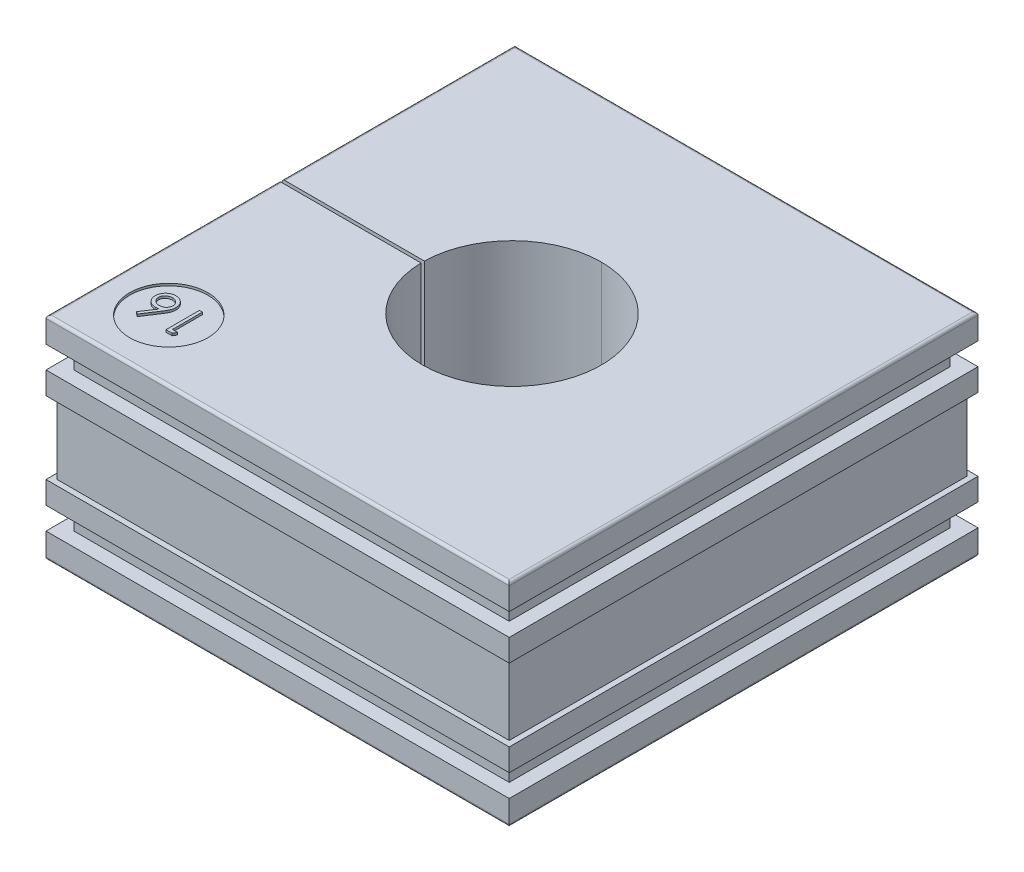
ISO-10303-21;
HEADER;
FILE_DESCRIPTION(('STEP AP214'),'2;1');
FILE_NAME('part.step','',(''),(''),'','','');
FILE_SCHEMA(('AUTOMOTIVE_DESIGN { 1 0 10303 214 1 1 1 1 }'));
ENDSEC;
DATA;
#1=APPLICATION_CONTEXT('core data for automotive mechanical design processes');
#2=APPLICATION_PROTOCOL_DEFINITION('international standard','automotive_design',2000,#1);
#3=PRODUCT_CONTEXT('',#1,'mechanical');
#4=PRODUCT('Part','Part','',(#3));
#5=PRODUCT_RELATED_PRODUCT_CATEGORY('part','',(#4));
#6=PRODUCT_DEFINITION_FORMATION('','',#4);
#7=PRODUCT_DEFINITION_CONTEXT('part definition',#1,'design');
#8=PRODUCT_DEFINITION('design','',#6,#7);
#9=PRODUCT_DEFINITION_SHAPE('','',#8);
#10=(LENGTH_UNIT() NAMED_UNIT(*) SI_UNIT(.MILLI.,.METRE.));
#11=(NAMED_UNIT(*) PLANE_ANGLE_UNIT() SI_UNIT($,.RADIAN.));
#12=(NAMED_UNIT(*) SI_UNIT($,.STERADIAN.) SOLID_ANGLE_UNIT());
#13=UNCERTAINTY_MEASURE_WITH_UNIT(LENGTH_MEASURE(1.E-05),#10,'distance_accuracy_value','');
#14=(GEOMETRIC_REPRESENTATION_CONTEXT(3) GLOBAL_UNCERTAINTY_ASSIGNED_CONTEXT((#13)) GLOBAL_UNIT_ASSIGNED_CONTEXT((#10,
#11,#12)) REPRESENTATION_CONTEXT('',''));
#15=CARTESIAN_POINT('',(0.,0.,0.));
#16=DIRECTION('',(0.,0.,1.));
#17=DIRECTION('',(1.,0.,0.));
#18=AXIS2_PLACEMENT_3D('',#15,#16,#17);
#19=CARTESIAN_POINT('',(0.,19.,0.));
#20=DIRECTION('',(0.,-1.,0.));
#21=DIRECTION('',(0.,0.,-1.));
#22=AXIS2_PLACEMENT_3D('',#19,#20,#21);
#23=PLANE('',#22);
#24=DIRECTION('',(-0.496686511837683,0.,0.86793001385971));
#25=VECTOR('',#24,1.);
#26=CARTESIAN_POINT('',(-13.5192307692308,19.,16.4423076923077));
#27=LINE('',#26,#25);
#28=CARTESIAN_POINT('',(-13.5192307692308,19.,16.4423076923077));
#29=VERTEX_POINT('',#28);
#30=CARTESIAN_POINT('',(-13.6953125,19.,16.75));
#31=VERTEX_POINT('',#30);
#32=EDGE_CURVE('E1517',#29,#31,#27,.T.);
#33=ORIENTED_EDGE('',*,*,#32,.F.);
#34=DIRECTION('',(1.,0.,0.));
#35=VECTOR('',#34,1.);
#36=CARTESIAN_POINT('',(-13.9807692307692,19.,16.4423076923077));
#37=LINE('',#36,#35);
#38=CARTESIAN_POINT('',(-13.9807692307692,19.,16.4423076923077));
#39=VERTEX_POINT('',#38);
#40=EDGE_CURVE('E1527',#39,#29,#37,.T.);
#41=ORIENTED_EDGE('',*,*,#40,.F.);
#42=DIRECTION('',(0.,0.,1.));
#43=VECTOR('',#42,1.);
#44=CARTESIAN_POINT('',(-13.9807692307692,19.,13.75));
#45=LINE('',#44,#43);
#46=CARTESIAN_POINT('',(-13.9807692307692,19.,13.75));
#47=VERTEX_POINT('',#46);
#48=EDGE_CURVE('E1533',#47,#39,#45,.T.);
#49=ORIENTED_EDGE('',*,*,#48,.F.);
#50=DIRECTION('',(1.,0.,0.));
#51=VECTOR('',#50,1.);
#52=CARTESIAN_POINT('',(-14.25,19.,13.75));
#53=LINE('',#52,#51);
#54=CARTESIAN_POINT('',(-14.25,19.,13.75));
#55=VERTEX_POINT('',#54);
#56=EDGE_CURVE('E1539',#55,#47,#53,.T.);
#57=ORIENTED_EDGE('',*,*,#56,.F.);
#58=DIRECTION('',(0.,0.,-1.));
#59=VECTOR('',#58,1.);
#60=CARTESIAN_POINT('',(-14.25,19.,16.75));
#61=LINE('',#60,#59);
#62=CARTESIAN_POINT('',(-14.25,19.,16.75));
#63=VERTEX_POINT('',#62);
#64=EDGE_CURVE('E23',#63,#55,#61,.T.);
#65=ORIENTED_EDGE('',*,*,#64,.F.);
#66=DIRECTION('',(-1.,0.,0.));
#67=VECTOR('',#66,1.);
#68=CARTESIAN_POINT('',(-13.6953125,19.,16.75));
#69=LINE('',#68,#67);
#70=EDGE_CURVE('E9',#31,#63,#69,.T.);
#71=ORIENTED_EDGE('',*,*,#70,.F.);
#72=EDGE_LOOP('',(#33,#41,#49,#57,#65,#71));
#73=FACE_BOUND('',#72,.T.);
#74=ADVANCED_FACE('F15',(#73),#23,.F.);
#75=CARTESIAN_POINT('',(-13.6953125,19.,16.75));
#76=DIRECTION('',(0.,0.,1.));
#77=DIRECTION('',(1.,0.,0.));
#78=AXIS2_PLACEMENT_3D('',#75,#76,#77);
#79=PLANE('',#78);
#80=DIRECTION('',(-1.,0.,0.));
#81=VECTOR('',#80,1.);
#82=CARTESIAN_POINT('',(-13.6953125,18.8,16.75));
#83=LINE('',#82,#81);
#84=CARTESIAN_POINT('',(-13.6953125,18.8,16.75));
#85=VERTEX_POINT('',#84);
#86=CARTESIAN_POINT('',(-14.25,18.8,16.75));
#87=VERTEX_POINT('',#86);
#88=EDGE_CURVE('E644',#85,#87,#83,.T.);
#89=ORIENTED_EDGE('',*,*,#88,.F.);
#90=DIRECTION('',(0.,-1.,0.));
#91=VECTOR('',#90,1.);
#92=CARTESIAN_POINT('',(-13.6953125,19.,16.75));
#93=LINE('',#92,#91);
#94=EDGE_CURVE('E1521',#31,#85,#93,.T.);
#95=ORIENTED_EDGE('',*,*,#94,.F.);
#96=ORIENTED_EDGE('',*,*,#70,.T.);
#97=DIRECTION('',(0.,-1.,0.));
#98=VECTOR('',#97,1.);
#99=CARTESIAN_POINT('',(-14.25,19.,16.75));
#100=LINE('',#99,#98);
#101=EDGE_CURVE('E1542',#63,#87,#100,.T.);
#102=ORIENTED_EDGE('',*,*,#101,.T.);
#103=EDGE_LOOP('',(#89,#95,#96,#102));
#104=FACE_BOUND('',#103,.T.);
#105=ADVANCED_FACE('F1971',(#104),#79,.T.);
#106=CARTESIAN_POINT('',(-14.25,19.,16.75));
#107=DIRECTION('',(-1.,0.,0.));
#108=DIRECTION('',(0.,0.,1.));
#109=AXIS2_PLACEMENT_3D('',#106,#107,#108);
#110=PLANE('',#109);
#111=DIRECTION('',(0.,0.,-1.));
#112=VECTOR('',#111,1.);
#113=CARTESIAN_POINT('',(-14.25,18.8,16.75));
#114=LINE('',#113,#112);
#115=CARTESIAN_POINT('',(-14.25,18.8,13.75));
#116=VERTEX_POINT('',#115);
#117=EDGE_CURVE('E656',#87,#116,#114,.T.);
#118=ORIENTED_EDGE('',*,*,#117,.F.);
#119=ORIENTED_EDGE('',*,*,#101,.F.);
#120=ORIENTED_EDGE('',*,*,#64,.T.);
#121=DIRECTION('',(0.,-1.,0.));
#122=VECTOR('',#121,1.);
#123=CARTESIAN_POINT('',(-14.25,19.,13.75));
#124=LINE('',#123,#122);
#125=EDGE_CURVE('E1536',#55,#116,#124,.T.);
#126=ORIENTED_EDGE('',*,*,#125,.T.);
#127=EDGE_LOOP('',(#118,#119,#120,#126));
#128=FACE_BOUND('',#127,.T.);
#129=ADVANCED_FACE('F1966',(#128),#110,.T.);
#130=CARTESIAN_POINT('',(-14.25,19.,13.75));
#131=DIRECTION('',(0.,0.,-1.));
#132=DIRECTION('',(0.,-1.,0.));
#133=AXIS2_PLACEMENT_3D('',#130,#131,#132);
#134=PLANE('',#133);
#135=DIRECTION('',(1.,0.,0.));
#136=VECTOR('',#135,1.);
#137=CARTESIAN_POINT('',(-14.25,18.8,13.75));
#138=LINE('',#137,#136);
#139=CARTESIAN_POINT('',(-13.9807692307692,18.8,13.75));
#140=VERTEX_POINT('',#139);
#141=EDGE_CURVE('E651',#116,#140,#138,.T.);
#142=ORIENTED_EDGE('',*,*,#141,.F.);
#143=ORIENTED_EDGE('',*,*,#125,.F.);
#144=ORIENTED_EDGE('',*,*,#56,.T.);
#145=DIRECTION('',(0.,-1.,0.));
#146=VECTOR('',#145,1.);
#147=CARTESIAN_POINT('',(-13.9807692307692,19.,13.75));
#148=LINE('',#147,#146);
#149=EDGE_CURVE('E1530',#47,#140,#148,.T.);
#150=ORIENTED_EDGE('',*,*,#149,.T.);
#151=EDGE_LOOP('',(#142,#143,#144,#150));
#152=FACE_BOUND('',#151,.T.);
#153=ADVANCED_FACE('F1970',(#152),#134,.T.);
#154=CARTESIAN_POINT('',(-13.9807692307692,19.,13.75));
#155=DIRECTION('',(1.,0.,0.));
#156=DIRECTION('',(0.,1.,0.));
#157=AXIS2_PLACEMENT_3D('',#154,#155,#156);
#158=PLANE('',#157);
#159=DIRECTION('',(0.,0.,1.));
#160=VECTOR('',#159,1.);
#161=CARTESIAN_POINT('',(-13.9807692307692,18.8,13.75));
#162=LINE('',#161,#160);
#163=CARTESIAN_POINT('',(-13.9807692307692,18.8,16.4423076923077));
#164=VERTEX_POINT('',#163);
#165=EDGE_CURVE('E655',#140,#164,#162,.T.);
#166=ORIENTED_EDGE('',*,*,#165,.F.);
#167=ORIENTED_EDGE('',*,*,#149,.F.);
#168=ORIENTED_EDGE('',*,*,#48,.T.);
#169=DIRECTION('',(0.,-1.,0.));
#170=VECTOR('',#169,1.);
#171=CARTESIAN_POINT('',(-13.9807692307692,19.,16.4423076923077));
#172=LINE('',#171,#170);
#173=EDGE_CURVE('E1524',#39,#164,#172,.T.);
#174=ORIENTED_EDGE('',*,*,#173,.T.);
#175=EDGE_LOOP('',(#166,#167,#168,#174));
#176=FACE_BOUND('',#175,.T.);
#177=ADVANCED_FACE('F1847',(#176),#158,.T.);
#178=CARTESIAN_POINT('',(-13.9807692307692,19.,16.4423076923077));
#179=DIRECTION('',(0.,0.,-1.));
#180=DIRECTION('',(0.,-1.,0.));
#181=AXIS2_PLACEMENT_3D('',#178,#179,#180);
#182=PLANE('',#181);
#183=DIRECTION('',(1.,0.,0.));
#184=VECTOR('',#183,1.);
#185=CARTESIAN_POINT('',(-13.9807692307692,18.8,16.4423076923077));
#186=LINE('',#185,#184);
#187=CARTESIAN_POINT('',(-13.5192307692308,18.8,16.4423076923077));
#188=VERTEX_POINT('',#187);
#189=EDGE_CURVE('E723',#164,#188,#186,.T.);
#190=ORIENTED_EDGE('',*,*,#189,.F.);
#191=ORIENTED_EDGE('',*,*,#173,.F.);
#192=ORIENTED_EDGE('',*,*,#40,.T.);
#193=DIRECTION('',(0.,-1.,0.));
#194=VECTOR('',#193,1.);
#195=CARTESIAN_POINT('',(-13.5192307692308,19.,16.4423076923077));
#196=LINE('',#195,#194);
#197=EDGE_CURVE('E1511',#29,#188,#196,.T.);
#198=ORIENTED_EDGE('',*,*,#197,.T.);
#199=EDGE_LOOP('',(#190,#191,#192,#198));
#200=FACE_BOUND('',#199,.T.);
#201=ADVANCED_FACE('F1842',(#200),#182,.T.);
#202=CARTESIAN_POINT('',(-13.5192307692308,19.,16.4423076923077));
#203=DIRECTION('',(0.86793001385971,0.,0.496686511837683));
#204=DIRECTION('',(0.,-1.,0.));
#205=AXIS2_PLACEMENT_3D('',#202,#203,#204);
#206=PLANE('',#205);
#207=DIRECTION('',(-0.496686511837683,0.,0.86793001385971));
#208=VECTOR('',#207,1.);
#209=CARTESIAN_POINT('',(-13.5192307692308,18.8,16.4423076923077));
#210=LINE('',#209,#208);
#211=EDGE_CURVE('E615',#188,#85,#210,.T.);
#212=ORIENTED_EDGE('',*,*,#211,.F.);
#213=ORIENTED_EDGE('',*,*,#197,.F.);
#214=ORIENTED_EDGE('',*,*,#32,.T.);
#215=ORIENTED_EDGE('',*,*,#94,.T.);
#216=EDGE_LOOP('',(#212,#213,#214,#215));
#217=FACE_BOUND('',#216,.T.);
#218=ADVANCED_FACE('F1846',(#217),#206,.T.);
#219=CARTESIAN_POINT('',(-15.25,18.8,15.5));
#220=DIRECTION('',(0.,1.,0.));
#221=DIRECTION('',(1.,0.,0.));
#222=AXIS2_PLACEMENT_3D('',#219,#220,#221);
#223=PLANE('',#222);
#224=CARTESIAN_POINT('',(-17.0961538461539,18.8,14.5757211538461));
#225=CARTESIAN_POINT('',(-17.0956876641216,18.8,14.5962045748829));
#226=CARTESIAN_POINT('',(-17.0947727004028,18.8,14.6364068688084));
#227=CARTESIAN_POINT('',(-17.0842235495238,18.8,14.6952480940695));
#228=CARTESIAN_POINT('',(-17.0699751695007,18.8,14.7522977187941));
#229=CARTESIAN_POINT('',(-17.0469484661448,18.8,14.8062705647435));
#230=CARTESIAN_POINT('',(-17.0195218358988,18.8,14.8586593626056));
#231=CARTESIAN_POINT('',(-16.9845819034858,18.8,14.907966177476));
#232=CARTESIAN_POINT('',(-16.9445232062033,18.8,14.9555903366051));
#233=CARTESIAN_POINT('',(-16.8981282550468,18.8,14.9997691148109));
#234=CARTESIAN_POINT('',(-16.8476663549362,18.8,15.0402071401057));
#235=CARTESIAN_POINT('',(-16.793960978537,18.8,15.0757959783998));
#236=CARTESIAN_POINT('',(-16.7380015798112,18.8,15.1061757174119));
#237=CARTESIAN_POINT('',(-16.6789971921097,18.8,15.1301474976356));
#238=CARTESIAN_POINT('',(-16.6177424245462,18.8,15.1494595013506));
#239=CARTESIAN_POINT('',(-16.5538141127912,18.8,15.1634221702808));
#240=CARTESIAN_POINT('',(-16.4871668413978,18.8,15.1711064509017));
#241=CARTESIAN_POINT('',(-16.4419257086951,18.8,15.1724117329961));
#242=CARTESIAN_POINT('',(-16.4188701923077,18.8,15.1730769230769));
#243=(BOUNDED_CURVE() B_SPLINE_CURVE(3,(#224,#225,#226,#227,#228,#229,#230,#231,#232,#233,#234,
#235,#236,#237,#238,#239,#240,#241,#242),.UNSPECIFIED.,.F.,.F.) B_SPLINE_CURVE_WITH_KNOTS((4,1,
1,1,1,1,1,1,1,1,1,1,1,1,1,1,4),(0.,0.0611448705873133,0.120007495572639,0.178245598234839,
0.236508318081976,0.294903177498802,0.354696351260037,0.416717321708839,0.480659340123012,
0.545834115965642,0.609767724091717,0.67298803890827,0.735810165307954,0.799816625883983,
0.864759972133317,0.931079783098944,1.),
.UNSPECIFIED.) CURVE() GEOMETRIC_REPRESENTATION_ITEM() RATIONAL_B_SPLINE_CURVE((1.,1.,1.,1.,1.,
1.,1.,1.,1.,1.,1.,1.,1.,1.,1.,1.,1.,1.,1.)) REPRESENTATION_ITEM(''));
#244=CARTESIAN_POINT('',(-17.0961538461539,18.8,14.5757211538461));
#245=VERTEX_POINT('',#244);
#246=CARTESIAN_POINT('',(-16.4188701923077,18.8,15.1730769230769));
#247=VERTEX_POINT('',#246);
#248=EDGE_CURVE('E1469',#245,#247,#243,.T.);
#249=ORIENTED_EDGE('',*,*,#248,.T.);
#250=CARTESIAN_POINT('',(-16.4188701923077,18.8,15.1730769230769));
#251=CARTESIAN_POINT('',(-16.3960152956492,18.8,15.1724076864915));
#252=CARTESIAN_POINT('',(-16.351174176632,18.8,15.1710946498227));
#253=CARTESIAN_POINT('',(-16.2855071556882,18.8,15.1635150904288));
#254=CARTESIAN_POINT('',(-16.2233203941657,18.8,15.1496423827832));
#255=CARTESIAN_POINT('',(-16.1647159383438,18.8,15.1301151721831));
#256=CARTESIAN_POINT('',(-16.1088288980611,18.8,15.1062579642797));
#257=CARTESIAN_POINT('',(-16.0565469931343,18.8,15.0760040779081));
#258=CARTESIAN_POINT('',(-16.0075183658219,18.8,15.0404261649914));
#259=CARTESIAN_POINT('',(-15.962875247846,18.8,14.9994764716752));
#260=CARTESIAN_POINT('',(-15.9218710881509,18.8,14.9553267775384));
#261=CARTESIAN_POINT('',(-15.886603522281,18.8,14.9077474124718));
#262=CARTESIAN_POINT('',(-15.8561478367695,18.8,14.8582012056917));
#263=CARTESIAN_POINT('',(-15.8313940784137,18.8,14.8062200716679));
#264=CARTESIAN_POINT('',(-15.8121163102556,18.8,14.7518379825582));
#265=CARTESIAN_POINT('',(-15.7981722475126,18.8,14.6953013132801));
#266=CARTESIAN_POINT('',(-15.7904118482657,18.8,14.6362319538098));
#267=CARTESIAN_POINT('',(-15.7891207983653,18.8,14.5961755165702));
#268=CARTESIAN_POINT('',(-15.7884615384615,18.8,14.5757211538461));
#269=(BOUNDED_CURVE() B_SPLINE_CURVE(3,(#250,#251,#252,#253,#254,#255,#256,#257,#258,#259,#260,
#261,#262,#263,#264,#265,#266,#267,#268),.UNSPECIFIED.,.F.,.F.) B_SPLINE_CURVE_WITH_KNOTS((4,1,
1,1,1,1,1,1,1,1,1,1,1,1,1,1,4),(0.,0.0705962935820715,0.138509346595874,0.203801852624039,
0.266994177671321,0.329058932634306,0.391139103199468,0.45313598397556,0.515768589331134,
0.577944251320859,0.638945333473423,0.698363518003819,0.757306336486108,0.81640155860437,
0.876272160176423,0.936819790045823,1.),
.UNSPECIFIED.) CURVE() GEOMETRIC_REPRESENTATION_ITEM() RATIONAL_B_SPLINE_CURVE((1.,1.,1.,1.,1.,
1.,1.,1.,1.,1.,1.,1.,1.,1.,1.,1.,1.,1.,1.)) REPRESENTATION_ITEM(''));
#270=CARTESIAN_POINT('',(-15.7884615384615,18.8,14.5757211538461));
#271=VERTEX_POINT('',#270);
#272=EDGE_CURVE('E1021',#247,#271,#269,.T.);
#273=ORIENTED_EDGE('',*,*,#272,.T.);
#274=CARTESIAN_POINT('',(-15.7884615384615,18.8,14.5757211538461));
#275=CARTESIAN_POINT('',(-15.78901881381,18.8,14.5554540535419));
#276=CARTESIAN_POINT('',(-15.7901169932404,18.8,14.515515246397));
#277=CARTESIAN_POINT('',(-15.7994238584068,18.8,14.456875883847));
#278=CARTESIAN_POINT('',(-15.8144050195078,18.8,14.400626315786));
#279=CARTESIAN_POINT('',(-15.8357018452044,18.8,14.3466478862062));
#280=CARTESIAN_POINT('',(-15.8629091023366,18.8,14.2950226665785));
#281=CARTESIAN_POINT('',(-15.8954504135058,18.8,14.2451265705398));
#282=CARTESIAN_POINT('',(-15.9349095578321,18.8,14.198287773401));
#283=CARTESIAN_POINT('',(-15.9797359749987,18.8,14.154217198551));
#284=CARTESIAN_POINT('',(-16.028445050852,18.8,14.1138890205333));
#285=CARTESIAN_POINT('',(-16.0798512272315,18.8,14.0778332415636));
#286=CARTESIAN_POINT('',(-16.1341389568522,18.8,14.0479062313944));
#287=CARTESIAN_POINT('',(-16.1907300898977,18.8,14.0228915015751));
#288=CARTESIAN_POINT('',(-16.2503355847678,18.8,14.0045139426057));
#289=CARTESIAN_POINT('',(-16.3119460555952,18.8,13.9904346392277));
#290=CARTESIAN_POINT('',(-16.3764105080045,18.8,13.9827395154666));
#291=CARTESIAN_POINT('',(-16.4200536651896,18.8,13.9814346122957));
#292=CARTESIAN_POINT('',(-16.4423076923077,18.8,13.9807692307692));
#293=(BOUNDED_CURVE() B_SPLINE_CURVE(3,(#274,#275,#276,#277,#278,#279,#280,#281,#282,#283,#284,
#285,#286,#287,#288,#289,#290,#291,#292),.UNSPECIFIED.,.F.,.F.) B_SPLINE_CURVE_WITH_KNOTS((4,1,
1,1,1,1,1,1,1,1,1,1,1,1,1,1,4),(0.,0.0618460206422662,0.121875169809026,0.180772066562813,
0.239261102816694,0.298622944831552,0.358670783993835,0.420767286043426,0.485204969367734,
0.550355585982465,0.613636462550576,0.676603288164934,0.73932310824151,0.802185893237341,
0.866730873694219,0.932044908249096,1.),
.UNSPECIFIED.) CURVE() GEOMETRIC_REPRESENTATION_ITEM() RATIONAL_B_SPLINE_CURVE((1.,1.,1.,1.,1.,
1.,1.,1.,1.,1.,1.,1.,1.,1.,1.,1.,1.,1.,1.)) REPRESENTATION_ITEM(''));
#294=CARTESIAN_POINT('',(-16.4423076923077,18.8,13.9807692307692));
#295=VERTEX_POINT('',#294);
#296=EDGE_CURVE('E1493',#271,#295,#293,.T.);
#297=ORIENTED_EDGE('',*,*,#296,.T.);
#298=CARTESIAN_POINT('',(-16.4423076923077,18.8,13.9807692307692));
#299=CARTESIAN_POINT('',(-16.4645617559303,18.8,13.9814345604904));
#300=CARTESIAN_POINT('',(-16.5082049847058,18.8,13.982739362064));
#301=CARTESIAN_POINT('',(-16.5726689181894,18.8,13.9904352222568));
#302=CARTESIAN_POINT('',(-16.6342813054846,18.8,14.0045118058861));
#303=CARTESIAN_POINT('',(-16.6938798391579,18.8,14.0228992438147));
#304=CARTESIAN_POINT('',(-16.7504967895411,18.8,14.0478773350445));
#305=CARTESIAN_POINT('',(-16.8048320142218,18.8,14.078021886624));
#306=CARTESIAN_POINT('',(-16.8567290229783,18.8,14.1136704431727));
#307=CARTESIAN_POINT('',(-16.9054064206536,18.8,14.1542869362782));
#308=CARTESIAN_POINT('',(-16.9504199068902,18.8,14.1980377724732));
#309=CARTESIAN_POINT('',(-16.9889723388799,18.8,14.2455547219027));
#310=CARTESIAN_POINT('',(-17.0225630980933,18.8,14.2946299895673));
#311=CARTESIAN_POINT('',(-17.0487327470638,18.8,14.3468532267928));
#312=CARTESIAN_POINT('',(-17.0702680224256,18.8,14.4005942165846));
#313=CARTESIAN_POINT('',(-17.0851757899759,18.8,14.4568846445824));
#314=CARTESIAN_POINT('',(-17.0945024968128,18.8,14.5155129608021));
#315=CARTESIAN_POINT('',(-17.095597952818,18.8,14.5554532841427));
#316=CARTESIAN_POINT('',(-17.0961538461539,18.8,14.5757211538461));
#317=(BOUNDED_CURVE() B_SPLINE_CURVE(3,(#298,#299,#300,#301,#302,#303,#304,#305,#306,#307,#308,
#309,#310,#311,#312,#313,#314,#315,#316),.UNSPECIFIED.,.F.,.F.) B_SPLINE_CURVE_WITH_KNOTS((4,1,
1,1,1,1,1,1,1,1,1,1,1,1,1,1,4),(0.,0.0679434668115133,0.133246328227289,0.197780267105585,
0.260632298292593,0.323341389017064,0.386297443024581,0.450070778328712,0.515210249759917,
0.579636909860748,0.641333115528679,0.701709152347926,0.760779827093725,0.819258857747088,
0.878145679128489,0.938164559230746,1.),
.UNSPECIFIED.) CURVE() GEOMETRIC_REPRESENTATION_ITEM() RATIONAL_B_SPLINE_CURVE((1.,1.,1.,1.,1.,
1.,1.,1.,1.,1.,1.,1.,1.,1.,1.,1.,1.,1.,1.)) REPRESENTATION_ITEM(''));
#318=EDGE_CURVE('E1506',#295,#245,#317,.T.);
#319=ORIENTED_EDGE('',*,*,#318,.T.);
#320=EDGE_LOOP('',(#249,#273,#297,#319));
#321=FACE_BOUND('',#320,.T.);
#322=ADVANCED_FACE('F2230',(#321),#223,.T.);
#323=CARTESIAN_POINT('',(-16.4423076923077,19.,13.9807692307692));
#324=CARTESIAN_POINT('',(-16.4423076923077,18.8,13.9807692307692));
#325=CARTESIAN_POINT('',(-16.4645617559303,19.,13.9814345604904));
#326=CARTESIAN_POINT('',(-16.4645617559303,18.8,13.9814345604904));
#327=CARTESIAN_POINT('',(-16.5082049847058,19.,13.982739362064));
#328=CARTESIAN_POINT('',(-16.5082049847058,18.8,13.982739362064));
#329=CARTESIAN_POINT('',(-16.5726689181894,19.,13.9904352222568));
#330=CARTESIAN_POINT('',(-16.5726689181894,18.8,13.9904352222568));
#331=CARTESIAN_POINT('',(-16.6342813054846,19.,14.0045118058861));
#332=CARTESIAN_POINT('',(-16.6342813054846,18.8,14.0045118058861));
#333=CARTESIAN_POINT('',(-16.6938798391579,19.,14.0228992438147));
#334=CARTESIAN_POINT('',(-16.6938798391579,18.8,14.0228992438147));
#335=CARTESIAN_POINT('',(-16.7504967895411,19.,14.0478773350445));
#336=CARTESIAN_POINT('',(-16.7504967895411,18.8,14.0478773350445));
#337=CARTESIAN_POINT('',(-16.8048320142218,19.,14.078021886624));
#338=CARTESIAN_POINT('',(-16.8048320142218,18.8,14.078021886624));
#339=CARTESIAN_POINT('',(-16.8567290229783,19.,14.1136704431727));
#340=CARTESIAN_POINT('',(-16.8567290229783,18.8,14.1136704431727));
#341=CARTESIAN_POINT('',(-16.9054064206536,19.,14.1542869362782));
#342=CARTESIAN_POINT('',(-16.9054064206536,18.8,14.1542869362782));
#343=CARTESIAN_POINT('',(-16.9504199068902,19.,14.1980377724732));
#344=CARTESIAN_POINT('',(-16.9504199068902,18.8,14.1980377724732));
#345=CARTESIAN_POINT('',(-16.9889723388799,19.,14.2455547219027));
#346=CARTESIAN_POINT('',(-16.9889723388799,18.8,14.2455547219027));
#347=CARTESIAN_POINT('',(-17.0225630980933,19.,14.2946299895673));
#348=CARTESIAN_POINT('',(-17.0225630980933,18.8,14.2946299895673));
#349=CARTESIAN_POINT('',(-17.0487327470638,19.,14.3468532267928));
#350=CARTESIAN_POINT('',(-17.0487327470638,18.8,14.3468532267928));
#351=CARTESIAN_POINT('',(-17.0702680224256,19.,14.4005942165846));
#352=CARTESIAN_POINT('',(-17.0702680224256,18.8,14.4005942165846));
#353=CARTESIAN_POINT('',(-17.0851757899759,19.,14.4568846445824));
#354=CARTESIAN_POINT('',(-17.0851757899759,18.8,14.4568846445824));
#355=CARTESIAN_POINT('',(-17.0945024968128,19.,14.5155129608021));
#356=CARTESIAN_POINT('',(-17.0945024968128,18.8,14.5155129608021));
#357=CARTESIAN_POINT('',(-17.095597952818,19.,14.5554532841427));
#358=CARTESIAN_POINT('',(-17.095597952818,18.8,14.5554532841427));
#359=CARTESIAN_POINT('',(-17.0961538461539,19.,14.5757211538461));
#360=CARTESIAN_POINT('',(-17.0961538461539,18.8,14.5757211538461));
#361=(BOUNDED_SURFACE() B_SPLINE_SURFACE(3,1,((#323,#324),(#325,#326),(#327,#328),(#329,#330),
(#331,#332),(#333,#334),(#335,#336),(#337,#338),(#339,#340),(#341,#342),(#343,#344),(#345,#346),
(#347,#348),(#349,#350),(#351,#352),(#353,#354),(#355,#356),(#357,#358),(#359,#360)),
.UNSPECIFIED.,.F.,.F.,.F.) B_SPLINE_SURFACE_WITH_KNOTS((4,1,1,1,1,1,1,1,1,1,1,1,1,1,1,1,4),(2,
2),(0.,0.0679434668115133,0.133246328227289,0.197780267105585,0.260632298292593,
0.323341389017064,0.386297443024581,0.450070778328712,0.515210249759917,0.579636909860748,
0.641333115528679,0.701709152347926,0.760779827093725,0.819258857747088,0.878145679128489,
0.938164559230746,1.),(0.,1.),
.UNSPECIFIED.) GEOMETRIC_REPRESENTATION_ITEM() RATIONAL_B_SPLINE_SURFACE(((1.,1.),(1.,1.),(1.,
1.),(1.,1.),(1.,1.),(1.,1.),(1.,1.),(1.,1.),(1.,1.),(1.,1.),(1.,1.),(1.,1.),(1.,1.),(1.,1.),(1.,
1.),(1.,1.),(1.,1.),(1.,1.),(1.,1.))) REPRESENTATION_ITEM('') SURFACE());
#362=DIRECTION('',(0.,-1.,0.));
#363=VECTOR('',#362,1.);
#364=CARTESIAN_POINT('',(-16.4423076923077,19.,13.9807692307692));
#365=LINE('',#364,#363);
#366=CARTESIAN_POINT('',(-16.4423076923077,19.,13.9807692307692));
#367=VERTEX_POINT('',#366);
#368=EDGE_CURVE('E1499',#367,#295,#365,.T.);
#369=CARTESIAN_POINT('',(-16.4423076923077,19.,13.9807692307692));
#370=CARTESIAN_POINT('',(-16.4645617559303,19.,13.9814345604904));
#371=CARTESIAN_POINT('',(-16.5082049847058,19.,13.982739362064));
#372=CARTESIAN_POINT('',(-16.5726689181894,19.,13.9904352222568));
#373=CARTESIAN_POINT('',(-16.6342813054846,19.,14.0045118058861));
#374=CARTESIAN_POINT('',(-16.6938798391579,19.,14.0228992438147));
#375=CARTESIAN_POINT('',(-16.7504967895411,19.,14.0478773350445));
#376=CARTESIAN_POINT('',(-16.8048320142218,19.,14.078021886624));
#377=CARTESIAN_POINT('',(-16.8567290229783,19.,14.1136704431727));
#378=CARTESIAN_POINT('',(-16.9054064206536,19.,14.1542869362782));
#379=CARTESIAN_POINT('',(-16.9504199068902,19.,14.1980377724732));
#380=CARTESIAN_POINT('',(-16.9889723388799,19.,14.2455547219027));
#381=CARTESIAN_POINT('',(-17.0225630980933,19.,14.2946299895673));
#382=CARTESIAN_POINT('',(-17.0487327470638,19.,14.3468532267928));
#383=CARTESIAN_POINT('',(-17.0702680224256,19.,14.4005942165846));
#384=CARTESIAN_POINT('',(-17.0851757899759,19.,14.4568846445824));
#385=CARTESIAN_POINT('',(-17.0945024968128,19.,14.5155129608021));
#386=CARTESIAN_POINT('',(-17.095597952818,19.,14.5554532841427));
#387=CARTESIAN_POINT('',(-17.0961538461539,19.,14.5757211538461));
#388=(BOUNDED_CURVE() B_SPLINE_CURVE(3,(#369,#370,#371,#372,#373,#374,#375,#376,#377,#378,#379,
#380,#381,#382,#383,#384,#385,#386,#387),.UNSPECIFIED.,.F.,.F.) B_SPLINE_CURVE_WITH_KNOTS((4,1,
1,1,1,1,1,1,1,1,1,1,1,1,1,1,4),(0.,0.0679434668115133,0.133246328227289,0.197780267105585,
0.260632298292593,0.323341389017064,0.386297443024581,0.450070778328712,0.515210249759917,
0.579636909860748,0.641333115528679,0.701709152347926,0.760779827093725,0.819258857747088,
0.878145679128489,0.938164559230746,1.),
.UNSPECIFIED.) CURVE() GEOMETRIC_REPRESENTATION_ITEM() RATIONAL_B_SPLINE_CURVE((1.,1.,1.,1.,1.,
1.,1.,1.,1.,1.,1.,1.,1.,1.,1.,1.,1.,1.,1.)) REPRESENTATION_ITEM(''));
#389=CARTESIAN_POINT('',(-17.0961538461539,19.,14.5757211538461));
#390=VERTEX_POINT('',#389);
#391=EDGE_CURVE('E1429',#367,#390,#388,.T.);
#392=DIRECTION('',(0.,-1.,0.));
#393=VECTOR('',#392,1.);
#394=CARTESIAN_POINT('',(-17.0961538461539,19.,14.5757211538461));
#395=LINE('',#394,#393);
#396=EDGE_CURVE('E1022',#390,#245,#395,.T.);
#397=ORIENTED_EDGE('',*,*,#318,.F.);
#398=ORIENTED_EDGE('',*,*,#368,.F.);
#399=ORIENTED_EDGE('',*,*,#391,.T.);
#400=ORIENTED_EDGE('',*,*,#396,.T.);
#401=EDGE_LOOP('',(#397,#398,#399,#400));
#402=FACE_BOUND('',#401,.T.);
#403=ADVANCED_FACE('F2221',(#402),#361,.T.);
#404=CARTESIAN_POINT('',(-15.7884615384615,19.,14.5757211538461));
#405=CARTESIAN_POINT('',(-15.7884615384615,18.8,14.5757211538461));
#406=CARTESIAN_POINT('',(-15.78901881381,19.,14.5554540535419));
#407=CARTESIAN_POINT('',(-15.78901881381,18.8,14.5554540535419));
#408=CARTESIAN_POINT('',(-15.7901169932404,19.,14.515515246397));
#409=CARTESIAN_POINT('',(-15.7901169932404,18.8,14.515515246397));
#410=CARTESIAN_POINT('',(-15.7994238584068,19.,14.456875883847));
#411=CARTESIAN_POINT('',(-15.7994238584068,18.8,14.456875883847));
#412=CARTESIAN_POINT('',(-15.8144050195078,19.,14.400626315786));
#413=CARTESIAN_POINT('',(-15.8144050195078,18.8,14.400626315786));
#414=CARTESIAN_POINT('',(-15.8357018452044,19.,14.3466478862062));
#415=CARTESIAN_POINT('',(-15.8357018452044,18.8,14.3466478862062));
#416=CARTESIAN_POINT('',(-15.8629091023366,19.,14.2950226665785));
#417=CARTESIAN_POINT('',(-15.8629091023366,18.8,14.2950226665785));
#418=CARTESIAN_POINT('',(-15.8954504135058,19.,14.2451265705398));
#419=CARTESIAN_POINT('',(-15.8954504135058,18.8,14.2451265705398));
#420=CARTESIAN_POINT('',(-15.9349095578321,19.,14.198287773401));
#421=CARTESIAN_POINT('',(-15.9349095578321,18.8,14.198287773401));
#422=CARTESIAN_POINT('',(-15.9797359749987,19.,14.154217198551));
#423=CARTESIAN_POINT('',(-15.9797359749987,18.8,14.154217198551));
#424=CARTESIAN_POINT('',(-16.028445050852,19.,14.1138890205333));
#425=CARTESIAN_POINT('',(-16.028445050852,18.8,14.1138890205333));
#426=CARTESIAN_POINT('',(-16.0798512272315,19.,14.0778332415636));
#427=CARTESIAN_POINT('',(-16.0798512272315,18.8,14.0778332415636));
#428=CARTESIAN_POINT('',(-16.1341389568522,19.,14.0479062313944));
#429=CARTESIAN_POINT('',(-16.1341389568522,18.8,14.0479062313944));
#430=CARTESIAN_POINT('',(-16.1907300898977,19.,14.0228915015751));
#431=CARTESIAN_POINT('',(-16.1907300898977,18.8,14.0228915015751));
#432=CARTESIAN_POINT('',(-16.2503355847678,19.,14.0045139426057));
#433=CARTESIAN_POINT('',(-16.2503355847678,18.8,14.0045139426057));
#434=CARTESIAN_POINT('',(-16.3119460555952,19.,13.9904346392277));
#435=CARTESIAN_POINT('',(-16.3119460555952,18.8,13.9904346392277));
#436=CARTESIAN_POINT('',(-16.3764105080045,19.,13.9827395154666));
#437=CARTESIAN_POINT('',(-16.3764105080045,18.8,13.9827395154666));
#438=CARTESIAN_POINT('',(-16.4200536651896,19.,13.9814346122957));
#439=CARTESIAN_POINT('',(-16.4200536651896,18.8,13.9814346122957));
#440=CARTESIAN_POINT('',(-16.4423076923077,19.,13.9807692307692));
#441=CARTESIAN_POINT('',(-16.4423076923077,18.8,13.9807692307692));
#442=(BOUNDED_SURFACE() B_SPLINE_SURFACE(3,1,((#404,#405),(#406,#407),(#408,#409),(#410,#411),
(#412,#413),(#414,#415),(#416,#417),(#418,#419),(#420,#421),(#422,#423),(#424,#425),(#426,#427),
(#428,#429),(#430,#431),(#432,#433),(#434,#435),(#436,#437),(#438,#439),(#440,#441)),
.UNSPECIFIED.,.F.,.F.,.F.) B_SPLINE_SURFACE_WITH_KNOTS((4,1,1,1,1,1,1,1,1,1,1,1,1,1,1,1,4),(2,
2),(0.,0.0618460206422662,0.121875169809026,0.180772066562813,0.239261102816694,
0.298622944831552,0.358670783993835,0.420767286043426,0.485204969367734,0.550355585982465,
0.613636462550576,0.676603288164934,0.73932310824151,0.802185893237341,0.866730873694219,
0.932044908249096,1.),(0.,1.),
.UNSPECIFIED.) GEOMETRIC_REPRESENTATION_ITEM() RATIONAL_B_SPLINE_SURFACE(((1.,1.),(1.,1.),(1.,
1.),(1.,1.),(1.,1.),(1.,1.),(1.,1.),(1.,1.),(1.,1.),(1.,1.),(1.,1.),(1.,1.),(1.,1.),(1.,1.),(1.,
1.),(1.,1.),(1.,1.),(1.,1.),(1.,1.))) REPRESENTATION_ITEM('') SURFACE());
#443=DIRECTION('',(0.,-1.,0.));
#444=VECTOR('',#443,1.);
#445=CARTESIAN_POINT('',(-15.7884615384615,19.,14.5757211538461));
#446=LINE('',#445,#444);
#447=CARTESIAN_POINT('',(-15.7884615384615,19.,14.5757211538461));
#448=VERTEX_POINT('',#447);
#449=EDGE_CURVE('E1486',#448,#271,#446,.T.);
#450=CARTESIAN_POINT('',(-15.7884615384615,19.,14.5757211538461));
#451=CARTESIAN_POINT('',(-15.78901881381,19.,14.5554540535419));
#452=CARTESIAN_POINT('',(-15.7901169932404,19.,14.515515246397));
#453=CARTESIAN_POINT('',(-15.7994238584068,19.,14.456875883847));
#454=CARTESIAN_POINT('',(-15.8144050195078,19.,14.400626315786));
#455=CARTESIAN_POINT('',(-15.8357018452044,19.,14.3466478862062));
#456=CARTESIAN_POINT('',(-15.8629091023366,19.,14.2950226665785));
#457=CARTESIAN_POINT('',(-15.8954504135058,19.,14.2451265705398));
#458=CARTESIAN_POINT('',(-15.9349095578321,19.,14.198287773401));
#459=CARTESIAN_POINT('',(-15.9797359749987,19.,14.154217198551));
#460=CARTESIAN_POINT('',(-16.028445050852,19.,14.1138890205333));
#461=CARTESIAN_POINT('',(-16.0798512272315,19.,14.0778332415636));
#462=CARTESIAN_POINT('',(-16.1341389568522,19.,14.0479062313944));
#463=CARTESIAN_POINT('',(-16.1907300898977,19.,14.0228915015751));
#464=CARTESIAN_POINT('',(-16.2503355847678,19.,14.0045139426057));
#465=CARTESIAN_POINT('',(-16.3119460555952,19.,13.9904346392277));
#466=CARTESIAN_POINT('',(-16.3764105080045,19.,13.9827395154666));
#467=CARTESIAN_POINT('',(-16.4200536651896,19.,13.9814346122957));
#468=CARTESIAN_POINT('',(-16.4423076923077,19.,13.9807692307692));
#469=(BOUNDED_CURVE() B_SPLINE_CURVE(3,(#450,#451,#452,#453,#454,#455,#456,#457,#458,#459,#460,
#461,#462,#463,#464,#465,#466,#467,#468),.UNSPECIFIED.,.F.,.F.) B_SPLINE_CURVE_WITH_KNOTS((4,1,
1,1,1,1,1,1,1,1,1,1,1,1,1,1,4),(0.,0.0618460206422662,0.121875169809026,0.180772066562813,
0.239261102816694,0.298622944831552,0.358670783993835,0.420767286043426,0.485204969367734,
0.550355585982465,0.613636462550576,0.676603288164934,0.73932310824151,0.802185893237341,
0.866730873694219,0.932044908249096,1.),
.UNSPECIFIED.) CURVE() GEOMETRIC_REPRESENTATION_ITEM() RATIONAL_B_SPLINE_CURVE((1.,1.,1.,1.,1.,
1.,1.,1.,1.,1.,1.,1.,1.,1.,1.,1.,1.,1.,1.)) REPRESENTATION_ITEM(''));
#470=EDGE_CURVE('E1438',#448,#367,#469,.T.);
#471=ORIENTED_EDGE('',*,*,#296,.F.);
#472=ORIENTED_EDGE('',*,*,#449,.F.);
#473=ORIENTED_EDGE('',*,*,#470,.T.);
#474=ORIENTED_EDGE('',*,*,#368,.T.);
#475=EDGE_LOOP('',(#471,#472,#473,#474));
#476=FACE_BOUND('',#475,.T.);
#477=ADVANCED_FACE('F2212',(#476),#442,.T.);
#478=CARTESIAN_POINT('',(-16.4188701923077,19.,15.1730769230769));
#479=CARTESIAN_POINT('',(-16.4188701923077,18.8,15.1730769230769));
#480=CARTESIAN_POINT('',(-16.3960152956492,19.,15.1724076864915));
#481=CARTESIAN_POINT('',(-16.3960152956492,18.8,15.1724076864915));
#482=CARTESIAN_POINT('',(-16.351174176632,19.,15.1710946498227));
#483=CARTESIAN_POINT('',(-16.351174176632,18.8,15.1710946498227));
#484=CARTESIAN_POINT('',(-16.2855071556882,19.,15.1635150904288));
#485=CARTESIAN_POINT('',(-16.2855071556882,18.8,15.1635150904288));
#486=CARTESIAN_POINT('',(-16.2233203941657,19.,15.1496423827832));
#487=CARTESIAN_POINT('',(-16.2233203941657,18.8,15.1496423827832));
#488=CARTESIAN_POINT('',(-16.1647159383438,19.,15.1301151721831));
#489=CARTESIAN_POINT('',(-16.1647159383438,18.8,15.1301151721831));
#490=CARTESIAN_POINT('',(-16.1088288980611,19.,15.1062579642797));
#491=CARTESIAN_POINT('',(-16.1088288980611,18.8,15.1062579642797));
#492=CARTESIAN_POINT('',(-16.0565469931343,19.,15.0760040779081));
#493=CARTESIAN_POINT('',(-16.0565469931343,18.8,15.0760040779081));
#494=CARTESIAN_POINT('',(-16.0075183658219,19.,15.0404261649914));
#495=CARTESIAN_POINT('',(-16.0075183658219,18.8,15.0404261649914));
#496=CARTESIAN_POINT('',(-15.962875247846,19.,14.9994764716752));
#497=CARTESIAN_POINT('',(-15.962875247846,18.8,14.9994764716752));
#498=CARTESIAN_POINT('',(-15.9218710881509,19.,14.9553267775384));
#499=CARTESIAN_POINT('',(-15.9218710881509,18.8,14.9553267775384));
#500=CARTESIAN_POINT('',(-15.886603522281,19.,14.9077474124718));
#501=CARTESIAN_POINT('',(-15.886603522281,18.8,14.9077474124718));
#502=CARTESIAN_POINT('',(-15.8561478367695,19.,14.8582012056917));
#503=CARTESIAN_POINT('',(-15.8561478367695,18.8,14.8582012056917));
#504=CARTESIAN_POINT('',(-15.8313940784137,19.,14.8062200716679));
#505=CARTESIAN_POINT('',(-15.8313940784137,18.8,14.8062200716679));
#506=CARTESIAN_POINT('',(-15.8121163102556,19.,14.7518379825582));
#507=CARTESIAN_POINT('',(-15.8121163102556,18.8,14.7518379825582));
#508=CARTESIAN_POINT('',(-15.7981722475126,19.,14.6953013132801));
#509=CARTESIAN_POINT('',(-15.7981722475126,18.8,14.6953013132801));
#510=CARTESIAN_POINT('',(-15.7904118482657,19.,14.6362319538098));
#511=CARTESIAN_POINT('',(-15.7904118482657,18.8,14.6362319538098));
#512=CARTESIAN_POINT('',(-15.7891207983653,19.,14.5961755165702));
#513=CARTESIAN_POINT('',(-15.7891207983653,18.8,14.5961755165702));
#514=CARTESIAN_POINT('',(-15.7884615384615,19.,14.5757211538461));
#515=CARTESIAN_POINT('',(-15.7884615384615,18.8,14.5757211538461));
#516=(BOUNDED_SURFACE() B_SPLINE_SURFACE(3,1,((#478,#479),(#480,#481),(#482,#483),(#484,#485),
(#486,#487),(#488,#489),(#490,#491),(#492,#493),(#494,#495),(#496,#497),(#498,#499),(#500,#501),
(#502,#503),(#504,#505),(#506,#507),(#508,#509),(#510,#511),(#512,#513),(#514,#515)),
.UNSPECIFIED.,.F.,.F.,.F.) B_SPLINE_SURFACE_WITH_KNOTS((4,1,1,1,1,1,1,1,1,1,1,1,1,1,1,1,4),(2,
2),(0.,0.0705962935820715,0.138509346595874,0.203801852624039,0.266994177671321,
0.329058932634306,0.391139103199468,0.45313598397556,0.515768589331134,0.577944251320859,
0.638945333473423,0.698363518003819,0.757306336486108,0.81640155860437,0.876272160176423,
0.936819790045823,1.),(0.,1.),
.UNSPECIFIED.) GEOMETRIC_REPRESENTATION_ITEM() RATIONAL_B_SPLINE_SURFACE(((1.,1.),(1.,1.),(1.,
1.),(1.,1.),(1.,1.),(1.,1.),(1.,1.),(1.,1.),(1.,1.),(1.,1.),(1.,1.),(1.,1.),(1.,1.),(1.,1.),(1.,
1.),(1.,1.),(1.,1.),(1.,1.),(1.,1.))) REPRESENTATION_ITEM('') SURFACE());
#517=DIRECTION('',(0.,-1.,0.));
#518=VECTOR('',#517,1.);
#519=CARTESIAN_POINT('',(-16.4188701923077,19.,15.1730769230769));
#520=LINE('',#519,#518);
#521=CARTESIAN_POINT('',(-16.4188701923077,19.,15.1730769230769));
#522=VERTEX_POINT('',#521);
#523=EDGE_CURVE('E1017',#522,#247,#520,.T.);
#524=CARTESIAN_POINT('',(-16.4188701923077,19.,15.1730769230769));
#525=CARTESIAN_POINT('',(-16.3960152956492,19.,15.1724076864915));
#526=CARTESIAN_POINT('',(-16.351174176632,19.,15.1710946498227));
#527=CARTESIAN_POINT('',(-16.2855071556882,19.,15.1635150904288));
#528=CARTESIAN_POINT('',(-16.2233203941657,19.,15.1496423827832));
#529=CARTESIAN_POINT('',(-16.1647159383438,19.,15.1301151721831));
#530=CARTESIAN_POINT('',(-16.1088288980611,19.,15.1062579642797));
#531=CARTESIAN_POINT('',(-16.0565469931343,19.,15.0760040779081));
#532=CARTESIAN_POINT('',(-16.0075183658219,19.,15.0404261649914));
#533=CARTESIAN_POINT('',(-15.962875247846,19.,14.9994764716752));
#534=CARTESIAN_POINT('',(-15.9218710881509,19.,14.9553267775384));
#535=CARTESIAN_POINT('',(-15.886603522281,19.,14.9077474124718));
#536=CARTESIAN_POINT('',(-15.8561478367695,19.,14.8582012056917));
#537=CARTESIAN_POINT('',(-15.8313940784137,19.,14.8062200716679));
#538=CARTESIAN_POINT('',(-15.8121163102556,19.,14.7518379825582));
#539=CARTESIAN_POINT('',(-15.7981722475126,19.,14.6953013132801));
#540=CARTESIAN_POINT('',(-15.7904118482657,19.,14.6362319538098));
#541=CARTESIAN_POINT('',(-15.7891207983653,19.,14.5961755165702));
#542=CARTESIAN_POINT('',(-15.7884615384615,19.,14.5757211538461));
#543=(BOUNDED_CURVE() B_SPLINE_CURVE(3,(#524,#525,#526,#527,#528,#529,#530,#531,#532,#533,#534,
#535,#536,#537,#538,#539,#540,#541,#542),.UNSPECIFIED.,.F.,.F.) B_SPLINE_CURVE_WITH_KNOTS((4,1,
1,1,1,1,1,1,1,1,1,1,1,1,1,1,4),(0.,0.0705962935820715,0.138509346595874,0.203801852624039,
0.266994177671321,0.329058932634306,0.391139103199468,0.45313598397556,0.515768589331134,
0.577944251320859,0.638945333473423,0.698363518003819,0.757306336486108,0.81640155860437,
0.876272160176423,0.936819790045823,1.),
.UNSPECIFIED.) CURVE() GEOMETRIC_REPRESENTATION_ITEM() RATIONAL_B_SPLINE_CURVE((1.,1.,1.,1.,1.,
1.,1.,1.,1.,1.,1.,1.,1.,1.,1.,1.,1.,1.,1.)) REPRESENTATION_ITEM(''));
#544=EDGE_CURVE('E1414',#522,#448,#543,.T.);
#545=ORIENTED_EDGE('',*,*,#272,.F.);
#546=ORIENTED_EDGE('',*,*,#523,.F.);
#547=ORIENTED_EDGE('',*,*,#544,.T.);
#548=ORIENTED_EDGE('',*,*,#449,.T.);
#549=EDGE_LOOP('',(#545,#546,#547,#548));
#550=FACE_BOUND('',#549,.T.);
#551=ADVANCED_FACE('F2203',(#550),#516,.T.);
#552=CARTESIAN_POINT('',(-17.0961538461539,19.,14.5757211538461));
#553=CARTESIAN_POINT('',(-17.0961538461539,18.8,14.5757211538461));
#554=CARTESIAN_POINT('',(-17.0956876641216,19.,14.5962045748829));
#555=CARTESIAN_POINT('',(-17.0956876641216,18.8,14.5962045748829));
#556=CARTESIAN_POINT('',(-17.0947727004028,19.,14.6364068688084));
#557=CARTESIAN_POINT('',(-17.0947727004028,18.8,14.6364068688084));
#558=CARTESIAN_POINT('',(-17.0842235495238,19.,14.6952480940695));
#559=CARTESIAN_POINT('',(-17.0842235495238,18.8,14.6952480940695));
#560=CARTESIAN_POINT('',(-17.0699751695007,19.,14.7522977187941));
#561=CARTESIAN_POINT('',(-17.0699751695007,18.8,14.7522977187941));
#562=CARTESIAN_POINT('',(-17.0469484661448,19.,14.8062705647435));
#563=CARTESIAN_POINT('',(-17.0469484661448,18.8,14.8062705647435));
#564=CARTESIAN_POINT('',(-17.0195218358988,19.,14.8586593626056));
#565=CARTESIAN_POINT('',(-17.0195218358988,18.8,14.8586593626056));
#566=CARTESIAN_POINT('',(-16.9845819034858,19.,14.907966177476));
#567=CARTESIAN_POINT('',(-16.9845819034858,18.8,14.907966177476));
#568=CARTESIAN_POINT('',(-16.9445232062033,19.,14.9555903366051));
#569=CARTESIAN_POINT('',(-16.9445232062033,18.8,14.9555903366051));
#570=CARTESIAN_POINT('',(-16.8981282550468,19.,14.9997691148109));
#571=CARTESIAN_POINT('',(-16.8981282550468,18.8,14.9997691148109));
#572=CARTESIAN_POINT('',(-16.8476663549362,19.,15.0402071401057));
#573=CARTESIAN_POINT('',(-16.8476663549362,18.8,15.0402071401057));
#574=CARTESIAN_POINT('',(-16.793960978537,19.,15.0757959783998));
#575=CARTESIAN_POINT('',(-16.793960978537,18.8,15.0757959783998));
#576=CARTESIAN_POINT('',(-16.7380015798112,19.,15.1061757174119));
#577=CARTESIAN_POINT('',(-16.7380015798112,18.8,15.1061757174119));
#578=CARTESIAN_POINT('',(-16.6789971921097,19.,15.1301474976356));
#579=CARTESIAN_POINT('',(-16.6789971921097,18.8,15.1301474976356));
#580=CARTESIAN_POINT('',(-16.6177424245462,19.,15.1494595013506));
#581=CARTESIAN_POINT('',(-16.6177424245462,18.8,15.1494595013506));
#582=CARTESIAN_POINT('',(-16.5538141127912,19.,15.1634221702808));
#583=CARTESIAN_POINT('',(-16.5538141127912,18.8,15.1634221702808));
#584=CARTESIAN_POINT('',(-16.4871668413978,19.,15.1711064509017));
#585=CARTESIAN_POINT('',(-16.4871668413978,18.8,15.1711064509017));
#586=CARTESIAN_POINT('',(-16.4419257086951,19.,15.1724117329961));
#587=CARTESIAN_POINT('',(-16.4419257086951,18.8,15.1724117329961));
#588=CARTESIAN_POINT('',(-16.4188701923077,19.,15.1730769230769));
#589=CARTESIAN_POINT('',(-16.4188701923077,18.8,15.1730769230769));
#590=(BOUNDED_SURFACE() B_SPLINE_SURFACE(3,1,((#552,#553),(#554,#555),(#556,#557),(#558,#559),
(#560,#561),(#562,#563),(#564,#565),(#566,#567),(#568,#569),(#570,#571),(#572,#573),(#574,#575),
(#576,#577),(#578,#579),(#580,#581),(#582,#583),(#584,#585),(#586,#587),(#588,#589)),
.UNSPECIFIED.,.F.,.F.,.F.) B_SPLINE_SURFACE_WITH_KNOTS((4,1,1,1,1,1,1,1,1,1,1,1,1,1,1,1,4),(2,
2),(0.,0.0611448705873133,0.120007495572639,0.178245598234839,0.236508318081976,
0.294903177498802,0.354696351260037,0.416717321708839,0.480659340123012,0.545834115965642,
0.609767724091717,0.67298803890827,0.735810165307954,0.799816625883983,0.864759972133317,
0.931079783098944,1.),(0.,1.),
.UNSPECIFIED.) GEOMETRIC_REPRESENTATION_ITEM() RATIONAL_B_SPLINE_SURFACE(((1.,1.),(1.,1.),(1.,
1.),(1.,1.),(1.,1.),(1.,1.),(1.,1.),(1.,1.),(1.,1.),(1.,1.),(1.,1.),(1.,1.),(1.,1.),(1.,1.),(1.,
1.),(1.,1.),(1.,1.),(1.,1.),(1.,1.))) REPRESENTATION_ITEM('') SURFACE());
#591=CARTESIAN_POINT('',(-17.0961538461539,19.,14.5757211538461));
#592=CARTESIAN_POINT('',(-17.0956876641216,19.,14.5962045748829));
#593=CARTESIAN_POINT('',(-17.0947727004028,19.,14.6364068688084));
#594=CARTESIAN_POINT('',(-17.0842235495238,19.,14.6952480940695));
#595=CARTESIAN_POINT('',(-17.0699751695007,19.,14.7522977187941));
#596=CARTESIAN_POINT('',(-17.0469484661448,19.,14.8062705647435));
#597=CARTESIAN_POINT('',(-17.0195218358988,19.,14.8586593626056));
#598=CARTESIAN_POINT('',(-16.9845819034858,19.,14.907966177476));
#599=CARTESIAN_POINT('',(-16.9445232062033,19.,14.9555903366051));
#600=CARTESIAN_POINT('',(-16.8981282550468,19.,14.9997691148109));
#601=CARTESIAN_POINT('',(-16.8476663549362,19.,15.0402071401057));
#602=CARTESIAN_POINT('',(-16.793960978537,19.,15.0757959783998));
#603=CARTESIAN_POINT('',(-16.7380015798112,19.,15.1061757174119));
#604=CARTESIAN_POINT('',(-16.6789971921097,19.,15.1301474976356));
#605=CARTESIAN_POINT('',(-16.6177424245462,19.,15.1494595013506));
#606=CARTESIAN_POINT('',(-16.5538141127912,19.,15.1634221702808));
#607=CARTESIAN_POINT('',(-16.4871668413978,19.,15.1711064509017));
#608=CARTESIAN_POINT('',(-16.4419257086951,19.,15.1724117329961));
#609=CARTESIAN_POINT('',(-16.4188701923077,19.,15.1730769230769));
#610=(BOUNDED_CURVE() B_SPLINE_CURVE(3,(#591,#592,#593,#594,#595,#596,#597,#598,#599,#600,#601,
#602,#603,#604,#605,#606,#607,#608,#609),.UNSPECIFIED.,.F.,.F.) B_SPLINE_CURVE_WITH_KNOTS((4,1,
1,1,1,1,1,1,1,1,1,1,1,1,1,1,4),(0.,0.0611448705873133,0.120007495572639,0.178245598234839,
0.236508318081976,0.294903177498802,0.354696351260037,0.416717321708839,0.480659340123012,
0.545834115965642,0.609767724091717,0.67298803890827,0.735810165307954,0.799816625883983,
0.864759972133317,0.931079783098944,1.),
.UNSPECIFIED.) CURVE() GEOMETRIC_REPRESENTATION_ITEM() RATIONAL_B_SPLINE_CURVE((1.,1.,1.,1.,1.,
1.,1.,1.,1.,1.,1.,1.,1.,1.,1.,1.,1.,1.,1.)) REPRESENTATION_ITEM(''));
#611=EDGE_CURVE('E1420',#390,#522,#610,.T.);
#612=ORIENTED_EDGE('',*,*,#248,.F.);
#613=ORIENTED_EDGE('',*,*,#396,.F.);
#614=ORIENTED_EDGE('',*,*,#611,.T.);
#615=ORIENTED_EDGE('',*,*,#523,.T.);
#616=EDGE_LOOP('',(#612,#613,#614,#615));
#617=FACE_BOUND('',#616,.T.);
#618=ADVANCED_FACE('F2136',(#617),#590,.T.);
#619=CARTESIAN_POINT('',(-16.75,19.,16.826923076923));
#620=DIRECTION('',(-0.617720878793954,0.,0.786397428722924));
#621=DIRECTION('',(0.,1.,0.));
#622=AXIS2_PLACEMENT_3D('',#619,#620,#621);
#623=PLANE('',#622);
#624=DIRECTION('',(-0.786397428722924,0.,-0.617720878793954));
#625=VECTOR('',#624,1.);
#626=CARTESIAN_POINT('',(-16.75,18.8,16.826923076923));
#627=LINE('',#626,#625);
#628=CARTESIAN_POINT('',(-16.75,18.8,16.826923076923));
#629=VERTEX_POINT('',#628);
#630=CARTESIAN_POINT('',(-16.9573317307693,18.8,16.6640625));
#631=VERTEX_POINT('',#630);
#632=EDGE_CURVE('E747',#629,#631,#627,.T.);
#633=ORIENTED_EDGE('',*,*,#632,.F.);
#634=DIRECTION('',(0.,-1.,0.));
#635=VECTOR('',#634,1.);
#636=CARTESIAN_POINT('',(-16.75,19.,16.826923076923));
#637=LINE('',#636,#635);
#638=CARTESIAN_POINT('',(-16.75,19.,16.826923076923));
#639=VERTEX_POINT('',#638);
#640=EDGE_CURVE('E987',#639,#629,#637,.T.);
#641=ORIENTED_EDGE('',*,*,#640,.F.);
#642=DIRECTION('',(-0.786397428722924,0.,-0.617720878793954));
#643=VECTOR('',#642,1.);
#644=CARTESIAN_POINT('',(-16.75,19.,16.826923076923));
#645=LINE('',#644,#643);
#646=CARTESIAN_POINT('',(-16.9573317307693,19.,16.6640625));
#647=VERTEX_POINT('',#646);
#648=EDGE_CURVE('E1410',#639,#647,#645,.T.);
#649=ORIENTED_EDGE('',*,*,#648,.T.);
#650=DIRECTION('',(0.,-1.,0.));
#651=VECTOR('',#650,1.);
#652=CARTESIAN_POINT('',(-16.9573317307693,19.,16.6640625));
#653=LINE('',#652,#651);
#654=EDGE_CURVE('E1466',#647,#631,#653,.T.);
#655=ORIENTED_EDGE('',*,*,#654,.T.);
#656=EDGE_LOOP('',(#633,#641,#649,#655));
#657=FACE_BOUND('',#656,.T.);
#658=ADVANCED_FACE('F1883',(#657),#623,.T.);
#659=CARTESIAN_POINT('',(-16.9573317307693,19.,16.6640625));
#660=DIRECTION('',(-0.836933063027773,0.,-0.547305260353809));
#661=DIRECTION('',(-0.547305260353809,0.,0.836933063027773));
#662=AXIS2_PLACEMENT_3D('',#659,#660,#661);
#663=PLANE('',#662);
#664=DIRECTION('',(0.547305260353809,0.,-0.836933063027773));
#665=VECTOR('',#664,1.);
#666=CARTESIAN_POINT('',(-16.9573317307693,18.8,16.6640625));
#667=LINE('',#666,#665);
#668=CARTESIAN_POINT('',(-16.1646634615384,18.8,15.4519230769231));
#669=VERTEX_POINT('',#668);
#670=EDGE_CURVE('E761',#631,#669,#667,.T.);
#671=ORIENTED_EDGE('',*,*,#670,.F.);
#672=ORIENTED_EDGE('',*,*,#654,.F.);
#673=DIRECTION('',(0.547305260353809,0.,-0.836933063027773));
#674=VECTOR('',#673,1.);
#675=CARTESIAN_POINT('',(-16.9573317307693,19.,16.6640625));
#676=LINE('',#675,#674);
#677=CARTESIAN_POINT('',(-16.1646634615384,19.,15.4519230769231));
#678=VERTEX_POINT('',#677);
#679=EDGE_CURVE('E1403',#647,#678,#676,.T.);
#680=ORIENTED_EDGE('',*,*,#679,.T.);
#681=DIRECTION('',(0.,-1.,0.));
#682=VECTOR('',#681,1.);
#683=CARTESIAN_POINT('',(-16.1646634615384,19.,15.4519230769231));
#684=LINE('',#683,#682);
#685=EDGE_CURVE('E1463',#678,#669,#684,.T.);
#686=ORIENTED_EDGE('',*,*,#685,.T.);
#687=EDGE_LOOP('',(#671,#672,#680,#686));
#688=FACE_BOUND('',#687,.T.);
#689=ADVANCED_FACE('F1878',(#688),#663,.T.);
#690=CARTESIAN_POINT('',(-16.1646634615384,19.,15.4519230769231));
#691=CARTESIAN_POINT('',(-16.1646634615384,18.8,15.4519230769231));
#692=CARTESIAN_POINT('',(-16.2174379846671,19.,15.4603349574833));
#693=CARTESIAN_POINT('',(-16.2174379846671,18.8,15.4603349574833));
#694=CARTESIAN_POINT('',(-16.3203806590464,19.,15.4767432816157));
#695=CARTESIAN_POINT('',(-16.3203806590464,18.8,15.4767432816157));
#696=CARTESIAN_POINT('',(-16.4245800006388,19.,15.4794500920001));
#697=CARTESIAN_POINT('',(-16.4245800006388,18.8,15.4794500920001));
#698=CARTESIAN_POINT('',(-16.4753605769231,19.,15.4807692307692));
#699=CARTESIAN_POINT('',(-16.4753605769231,18.8,15.4807692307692));
#700=(BOUNDED_SURFACE() B_SPLINE_SURFACE(3,1,((#690,#691),(#692,#693),(#694,#695),(#696,#697),
(#698,#699)),.UNSPECIFIED.,.F.,.F.,.F.) B_SPLINE_SURFACE_WITH_KNOTS((4,1,4),(2,2),(0.,
0.51265933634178,1.),(0.,1.),
.UNSPECIFIED.) GEOMETRIC_REPRESENTATION_ITEM() RATIONAL_B_SPLINE_SURFACE(((1.,1.),(1.,1.),(1.,
1.),(1.,1.),(1.,1.))) REPRESENTATION_ITEM('') SURFACE());
#701=CARTESIAN_POINT('',(-16.1646634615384,18.8,15.4519230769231));
#702=CARTESIAN_POINT('',(-16.2174379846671,18.8,15.4603349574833));
#703=CARTESIAN_POINT('',(-16.3203806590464,18.8,15.4767432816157));
#704=CARTESIAN_POINT('',(-16.4245800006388,18.8,15.4794500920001));
#705=CARTESIAN_POINT('',(-16.4753605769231,18.8,15.4807692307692));
#706=(BOUNDED_CURVE() B_SPLINE_CURVE(3,(#701,#702,#703,#704,#705),.UNSPECIFIED.,.F.,
.F.) B_SPLINE_CURVE_WITH_KNOTS((4,1,4),(0.,0.51265933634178,1.),
.UNSPECIFIED.) CURVE() GEOMETRIC_REPRESENTATION_ITEM() RATIONAL_B_SPLINE_CURVE((1.,1.,1.,1.,1.)) REPRESENTATION_ITEM(''));
#707=CARTESIAN_POINT('',(-16.4753605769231,18.8,15.4807692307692));
#708=VERTEX_POINT('',#707);
#709=EDGE_CURVE('E772',#669,#708,#706,.T.);
#710=CARTESIAN_POINT('',(-16.1646634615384,19.,15.4519230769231));
#711=CARTESIAN_POINT('',(-16.2174379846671,19.,15.4603349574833));
#712=CARTESIAN_POINT('',(-16.3203806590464,19.,15.4767432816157));
#713=CARTESIAN_POINT('',(-16.4245800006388,19.,15.4794500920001));
#714=CARTESIAN_POINT('',(-16.4753605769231,19.,15.4807692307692));
#715=(BOUNDED_CURVE() B_SPLINE_CURVE(3,(#710,#711,#712,#713,#714),.UNSPECIFIED.,.F.,
.F.) B_SPLINE_CURVE_WITH_KNOTS((4,1,4),(0.,0.51265933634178,1.),
.UNSPECIFIED.) CURVE() GEOMETRIC_REPRESENTATION_ITEM() RATIONAL_B_SPLINE_CURVE((1.,1.,1.,1.,1.)) REPRESENTATION_ITEM(''));
#716=CARTESIAN_POINT('',(-16.4753605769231,19.,15.4807692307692));
#717=VERTEX_POINT('',#716);
#718=EDGE_CURVE('E1394',#678,#717,#715,.T.);
#719=DIRECTION('',(0.,-1.,0.));
#720=VECTOR('',#719,1.);
#721=CARTESIAN_POINT('',(-16.4753605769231,19.,15.4807692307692));
#722=LINE('',#721,#720);
#723=EDGE_CURVE('E1460',#717,#708,#722,.T.);
#724=ORIENTED_EDGE('',*,*,#709,.F.);
#725=ORIENTED_EDGE('',*,*,#685,.F.);
#726=ORIENTED_EDGE('',*,*,#718,.T.);
#727=ORIENTED_EDGE('',*,*,#723,.T.);
#728=EDGE_LOOP('',(#724,#725,#726,#727));
#729=FACE_BOUND('',#728,.T.);
#730=ADVANCED_FACE('F1882',(#729),#700,.T.);
#731=CARTESIAN_POINT('',(-16.4753605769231,19.,15.4807692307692));
#732=CARTESIAN_POINT('',(-16.4753605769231,18.8,15.4807692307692));
#733=CARTESIAN_POINT('',(-16.50585128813,19.,15.4799497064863));
#734=CARTESIAN_POINT('',(-16.50585128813,18.8,15.4799497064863));
#735=CARTESIAN_POINT('',(-16.5658713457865,19.,15.478336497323));
#736=CARTESIAN_POINT('',(-16.5658713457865,18.8,15.478336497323));
#737=CARTESIAN_POINT('',(-16.6539914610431,19.,15.4659217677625));
#738=CARTESIAN_POINT('',(-16.6539914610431,18.8,15.4659217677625));
#739=CARTESIAN_POINT('',(-16.7386676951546,19.,15.4463573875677));
#740=CARTESIAN_POINT('',(-16.7386676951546,18.8,15.4463573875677));
#741=CARTESIAN_POINT('',(-16.8195490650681,19.,15.4178383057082));
#742=CARTESIAN_POINT('',(-16.8195490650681,18.8,15.4178383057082));
#743=CARTESIAN_POINT('',(-16.8969259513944,19.,15.3814077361));
#744=CARTESIAN_POINT('',(-16.8969259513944,18.8,15.3814077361));
#745=CARTESIAN_POINT('',(-16.9712421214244,19.,15.3377457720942));
#746=CARTESIAN_POINT('',(-16.9712421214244,18.8,15.3377457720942));
#747=CARTESIAN_POINT('',(-17.0411016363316,19.,15.2845983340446));
#748=CARTESIAN_POINT('',(-17.0411016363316,18.8,15.2845983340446));
#749=CARTESIAN_POINT('',(-17.1074001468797,19.,15.2252272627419));
#750=CARTESIAN_POINT('',(-17.1074001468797,18.8,15.2252272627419));
#751=CARTESIAN_POINT('',(-17.1676041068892,19.,15.1594739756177));
#752=CARTESIAN_POINT('',(-17.1676041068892,18.8,15.1594739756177));
#753=CARTESIAN_POINT('',(-17.2208642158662,19.,15.0896864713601));
#754=CARTESIAN_POINT('',(-17.2208642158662,18.8,15.0896864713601));
#755=CARTESIAN_POINT('',(-17.265846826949,19.,15.0158702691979));
#756=CARTESIAN_POINT('',(-17.265846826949,18.8,15.0158702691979));
#757=CARTESIAN_POINT('',(-17.3016847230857,19.,14.9380419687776));
#758=CARTESIAN_POINT('',(-17.3016847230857,18.8,14.9380419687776));
#759=CARTESIAN_POINT('',(-17.3303255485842,19.,14.8568107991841));
#760=CARTESIAN_POINT('',(-17.3303255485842,18.8,14.8568107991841));
#761=CARTESIAN_POINT('',(-17.3507143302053,19.,14.7718599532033));
#762=CARTESIAN_POINT('',(-17.3507143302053,18.8,14.7718599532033));
#763=CARTESIAN_POINT('',(-17.3629030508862,19.,14.683046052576));
#764=CARTESIAN_POINT('',(-17.3629030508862,18.8,14.683046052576));
#765=CARTESIAN_POINT('',(-17.3645486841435,19.,14.6226343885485));
#766=CARTESIAN_POINT('',(-17.3645486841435,18.8,14.6226343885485));
#767=CARTESIAN_POINT('',(-17.3653846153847,19.,14.5919471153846));
#768=CARTESIAN_POINT('',(-17.3653846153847,18.8,14.5919471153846));
#769=(BOUNDED_SURFACE() B_SPLINE_SURFACE(3,1,((#731,#732),(#733,#734),(#735,#736),(#737,#738),
(#739,#740),(#741,#742),(#743,#744),(#745,#746),(#747,#748),(#749,#750),(#751,#752),(#753,#754),
(#755,#756),(#757,#758),(#759,#760),(#761,#762),(#763,#764),(#765,#766),(#767,#768)),
.UNSPECIFIED.,.F.,.F.,.F.) B_SPLINE_SURFACE_WITH_KNOTS((4,1,1,1,1,1,1,1,1,1,1,1,1,1,1,1,4),(2,
2),(0.,0.0652318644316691,0.128406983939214,0.190070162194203,0.250947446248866,
0.311550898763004,0.372868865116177,0.435030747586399,0.499079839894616,0.563100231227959,
0.625520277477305,0.686691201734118,0.747683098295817,0.808560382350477,0.870740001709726,
0.934339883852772,1.),(0.,1.),
.UNSPECIFIED.) GEOMETRIC_REPRESENTATION_ITEM() RATIONAL_B_SPLINE_SURFACE(((1.,1.),(1.,1.),(1.,
1.),(1.,1.),(1.,1.),(1.,1.),(1.,1.),(1.,1.),(1.,1.),(1.,1.),(1.,1.),(1.,1.),(1.,1.),(1.,1.),(1.,
1.),(1.,1.),(1.,1.),(1.,1.),(1.,1.))) REPRESENTATION_ITEM('') SURFACE());
#770=CARTESIAN_POINT('',(-16.4753605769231,18.8,15.4807692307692));
#771=CARTESIAN_POINT('',(-16.50585128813,18.8,15.4799497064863));
#772=CARTESIAN_POINT('',(-16.5658713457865,18.8,15.478336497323));
#773=CARTESIAN_POINT('',(-16.6539914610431,18.8,15.4659217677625));
#774=CARTESIAN_POINT('',(-16.7386676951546,18.8,15.4463573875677));
#775=CARTESIAN_POINT('',(-16.8195490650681,18.8,15.4178383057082));
#776=CARTESIAN_POINT('',(-16.8969259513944,18.8,15.3814077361));
#777=CARTESIAN_POINT('',(-16.9712421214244,18.8,15.3377457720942));
#778=CARTESIAN_POINT('',(-17.0411016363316,18.8,15.2845983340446));
#779=CARTESIAN_POINT('',(-17.1074001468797,18.8,15.2252272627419));
#780=CARTESIAN_POINT('',(-17.1676041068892,18.8,15.1594739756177));
#781=CARTESIAN_POINT('',(-17.2208642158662,18.8,15.0896864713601));
#782=CARTESIAN_POINT('',(-17.265846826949,18.8,15.0158702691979));
#783=CARTESIAN_POINT('',(-17.3016847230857,18.8,14.9380419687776));
#784=CARTESIAN_POINT('',(-17.3303255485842,18.8,14.8568107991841));
#785=CARTESIAN_POINT('',(-17.3507143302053,18.8,14.7718599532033));
#786=CARTESIAN_POINT('',(-17.3629030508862,18.8,14.683046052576));
#787=CARTESIAN_POINT('',(-17.3645486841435,18.8,14.6226343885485));
#788=CARTESIAN_POINT('',(-17.3653846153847,18.8,14.5919471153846));
#789=(BOUNDED_CURVE() B_SPLINE_CURVE(3,(#770,#771,#772,#773,#774,#775,#776,#777,#778,#779,#780,
#781,#782,#783,#784,#785,#786,#787,#788),.UNSPECIFIED.,.F.,.F.) B_SPLINE_CURVE_WITH_KNOTS((4,1,
1,1,1,1,1,1,1,1,1,1,1,1,1,1,4),(0.,0.0652318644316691,0.128406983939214,0.190070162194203,
0.250947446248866,0.311550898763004,0.372868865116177,0.435030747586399,0.499079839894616,
0.563100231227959,0.625520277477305,0.686691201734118,0.747683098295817,0.808560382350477,
0.870740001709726,0.934339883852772,1.),
.UNSPECIFIED.) CURVE() GEOMETRIC_REPRESENTATION_ITEM() RATIONAL_B_SPLINE_CURVE((1.,1.,1.,1.,1.,
1.,1.,1.,1.,1.,1.,1.,1.,1.,1.,1.,1.,1.,1.)) REPRESENTATION_ITEM(''));
#790=CARTESIAN_POINT('',(-17.3653846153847,18.8,14.5919471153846));
#791=VERTEX_POINT('',#790);
#792=EDGE_CURVE('E788',#708,#791,#789,.T.);
#793=CARTESIAN_POINT('',(-16.4753605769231,19.,15.4807692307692));
#794=CARTESIAN_POINT('',(-16.50585128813,19.,15.4799497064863));
#795=CARTESIAN_POINT('',(-16.5658713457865,19.,15.478336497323));
#796=CARTESIAN_POINT('',(-16.6539914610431,19.,15.4659217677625));
#797=CARTESIAN_POINT('',(-16.7386676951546,19.,15.4463573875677));
#798=CARTESIAN_POINT('',(-16.8195490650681,19.,15.4178383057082));
#799=CARTESIAN_POINT('',(-16.8969259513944,19.,15.3814077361));
#800=CARTESIAN_POINT('',(-16.9712421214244,19.,15.3377457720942));
#801=CARTESIAN_POINT('',(-17.0411016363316,19.,15.2845983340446));
#802=CARTESIAN_POINT('',(-17.1074001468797,19.,15.2252272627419));
#803=CARTESIAN_POINT('',(-17.1676041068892,19.,15.1594739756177));
#804=CARTESIAN_POINT('',(-17.2208642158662,19.,15.0896864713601));
#805=CARTESIAN_POINT('',(-17.265846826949,19.,15.0158702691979));
#806=CARTESIAN_POINT('',(-17.3016847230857,19.,14.9380419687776));
#807=CARTESIAN_POINT('',(-17.3303255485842,19.,14.8568107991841));
#808=CARTESIAN_POINT('',(-17.3507143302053,19.,14.7718599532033));
#809=CARTESIAN_POINT('',(-17.3629030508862,19.,14.683046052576));
#810=CARTESIAN_POINT('',(-17.3645486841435,19.,14.6226343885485));
#811=CARTESIAN_POINT('',(-17.3653846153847,19.,14.5919471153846));
#812=(BOUNDED_CURVE() B_SPLINE_CURVE(3,(#793,#794,#795,#796,#797,#798,#799,#800,#801,#802,#803,
#804,#805,#806,#807,#808,#809,#810,#811),.UNSPECIFIED.,.F.,.F.) B_SPLINE_CURVE_WITH_KNOTS((4,1,
1,1,1,1,1,1,1,1,1,1,1,1,1,1,4),(0.,0.0652318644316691,0.128406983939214,0.190070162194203,
0.250947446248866,0.311550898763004,0.372868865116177,0.435030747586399,0.499079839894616,
0.563100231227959,0.625520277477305,0.686691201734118,0.747683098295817,0.808560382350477,
0.870740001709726,0.934339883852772,1.),
.UNSPECIFIED.) CURVE() GEOMETRIC_REPRESENTATION_ITEM() RATIONAL_B_SPLINE_CURVE((1.,1.,1.,1.,1.,
1.,1.,1.,1.,1.,1.,1.,1.,1.,1.,1.,1.,1.,1.)) REPRESENTATION_ITEM(''));
#813=CARTESIAN_POINT('',(-17.3653846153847,19.,14.5919471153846));
#814=VERTEX_POINT('',#813);
#815=EDGE_CURVE('E1385',#717,#814,#812,.T.);
#816=DIRECTION('',(0.,-1.,0.));
#817=VECTOR('',#816,1.);
#818=CARTESIAN_POINT('',(-17.3653846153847,19.,14.5919471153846));
#819=LINE('',#818,#817);
#820=EDGE_CURVE('E1457',#814,#791,#819,.T.);
#821=ORIENTED_EDGE('',*,*,#792,.F.);
#822=ORIENTED_EDGE('',*,*,#723,.F.);
#823=ORIENTED_EDGE('',*,*,#815,.T.);
#824=ORIENTED_EDGE('',*,*,#820,.T.);
#825=EDGE_LOOP('',(#821,#822,#823,#824));
#826=FACE_BOUND('',#825,.T.);
#827=ADVANCED_FACE('F2180',(#826),#769,.T.);
#828=CARTESIAN_POINT('',(-17.3653846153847,19.,14.5919471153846));
#829=CARTESIAN_POINT('',(-17.3653846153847,18.8,14.5919471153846));
#830=CARTESIAN_POINT('',(-17.3638219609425,19.,14.5499879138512));
#831=CARTESIAN_POINT('',(-17.3638219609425,18.8,14.5499879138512));
#832=CARTESIAN_POINT('',(-17.3607488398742,19.,14.4674708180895));
#833=CARTESIAN_POINT('',(-17.3607488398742,18.8,14.4674708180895));
#834=CARTESIAN_POINT('',(-17.3382937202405,19.,14.3468095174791));
#835=CARTESIAN_POINT('',(-17.3382937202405,18.8,14.3468095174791));
#836=CARTESIAN_POINT('',(-17.2998269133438,19.,14.2328486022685));
#837=CARTESIAN_POINT('',(-17.2998269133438,18.8,14.2328486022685));
#838=CARTESIAN_POINT('',(-17.2475357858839,19.,14.1252905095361));
#839=CARTESIAN_POINT('',(-17.2475357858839,18.8,14.1252905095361));
#840=CARTESIAN_POINT('',(-17.180984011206,19.,14.026387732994));
#841=CARTESIAN_POINT('',(-17.180984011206,18.8,14.026387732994));
#842=CARTESIAN_POINT('',(-17.1011601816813,19.,13.9373033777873));
#843=CARTESIAN_POINT('',(-17.1011601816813,18.8,13.9373033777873));
#844=CARTESIAN_POINT('',(-17.0084583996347,19.,13.8596539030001));
#845=CARTESIAN_POINT('',(-17.0084583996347,18.8,13.8596539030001));
#846=CARTESIAN_POINT('',(-16.9047244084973,19.,13.7930708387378));
#847=CARTESIAN_POINT('',(-16.9047244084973,18.8,13.7930708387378));
#848=CARTESIAN_POINT('',(-16.7924671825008,19.,13.740163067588));
#849=CARTESIAN_POINT('',(-16.7924671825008,18.8,13.740163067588));
#850=CARTESIAN_POINT('',(-16.674757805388,19.,13.7010492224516));
#851=CARTESIAN_POINT('',(-16.674757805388,18.8,13.7010492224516));
#852=CARTESIAN_POINT('',(-16.5526072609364,19.,13.677677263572));
#853=CARTESIAN_POINT('',(-16.5526072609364,18.8,13.677677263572));
#854=CARTESIAN_POINT('',(-16.4696500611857,19.,13.6746174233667));
#855=CARTESIAN_POINT('',(-16.4696500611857,18.8,13.6746174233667));
#856=CARTESIAN_POINT('',(-16.4278846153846,19.,13.6730769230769));
#857=CARTESIAN_POINT('',(-16.4278846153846,18.8,13.6730769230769));
#858=(BOUNDED_SURFACE() B_SPLINE_SURFACE(3,1,((#828,#829),(#830,#831),(#832,#833),(#834,#835),
(#836,#837),(#838,#839),(#840,#841),(#842,#843),(#844,#845),(#846,#847),(#848,#849),(#850,#851),
(#852,#853),(#854,#855),(#856,#857)),.UNSPECIFIED.,.F.,.F.,.F.) B_SPLINE_SURFACE_WITH_KNOTS((4,
1,1,1,1,1,1,1,1,1,1,1,4),(2,2),(0.,0.0859925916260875,0.169113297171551,0.250535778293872,
0.331896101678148,0.413559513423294,0.494111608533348,0.57629375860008,0.660702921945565,
0.746119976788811,0.830010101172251,0.914417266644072,1.),(0.,1.),
.UNSPECIFIED.) GEOMETRIC_REPRESENTATION_ITEM() RATIONAL_B_SPLINE_SURFACE(((1.,1.),(1.,1.),(1.,
1.),(1.,1.),(1.,1.),(1.,1.),(1.,1.),(1.,1.),(1.,1.),(1.,1.),(1.,1.),(1.,1.),(1.,1.),(1.,1.),(1.,1.))) REPRESENTATION_ITEM('') SURFACE());
#859=CARTESIAN_POINT('',(-17.3653846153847,18.8,14.5919471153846));
#860=CARTESIAN_POINT('',(-17.3638219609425,18.8,14.5499879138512));
#861=CARTESIAN_POINT('',(-17.3607488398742,18.8,14.4674708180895));
#862=CARTESIAN_POINT('',(-17.3382937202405,18.8,14.3468095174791));
#863=CARTESIAN_POINT('',(-17.2998269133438,18.8,14.2328486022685));
#864=CARTESIAN_POINT('',(-17.2475357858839,18.8,14.1252905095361));
#865=CARTESIAN_POINT('',(-17.180984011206,18.8,14.026387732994));
#866=CARTESIAN_POINT('',(-17.1011601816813,18.8,13.9373033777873));
#867=CARTESIAN_POINT('',(-17.0084583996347,18.8,13.8596539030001));
#868=CARTESIAN_POINT('',(-16.9047244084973,18.8,13.7930708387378));
#869=CARTESIAN_POINT('',(-16.7924671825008,18.8,13.740163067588));
#870=CARTESIAN_POINT('',(-16.674757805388,18.8,13.7010492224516));
#871=CARTESIAN_POINT('',(-16.5526072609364,18.8,13.677677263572));
#872=CARTESIAN_POINT('',(-16.4696500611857,18.8,13.6746174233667));
#873=CARTESIAN_POINT('',(-16.4278846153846,18.8,13.6730769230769));
#874=(BOUNDED_CURVE() B_SPLINE_CURVE(3,(#859,#860,#861,#862,#863,#864,#865,#866,#867,#868,#869,
#870,#871,#872,#873),.UNSPECIFIED.,.F.,.F.) B_SPLINE_CURVE_WITH_KNOTS((4,1,1,1,1,1,1,1,1,1,1,1,
4),(0.,0.0859925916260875,0.169113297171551,0.250535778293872,0.331896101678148,
0.413559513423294,0.494111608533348,0.57629375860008,0.660702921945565,0.746119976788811,
0.830010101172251,0.914417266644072,1.),
.UNSPECIFIED.) CURVE() GEOMETRIC_REPRESENTATION_ITEM() RATIONAL_B_SPLINE_CURVE((1.,1.,1.,1.,1.,
1.,1.,1.,1.,1.,1.,1.,1.,1.,1.)) REPRESENTATION_ITEM(''));
#875=CARTESIAN_POINT('',(-16.4278846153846,18.8,13.6730769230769));
#876=VERTEX_POINT('',#875);
#877=EDGE_CURVE('E807',#791,#876,#874,.T.);
#878=CARTESIAN_POINT('',(-17.3653846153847,19.,14.5919471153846));
#879=CARTESIAN_POINT('',(-17.3638219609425,19.,14.5499879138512));
#880=CARTESIAN_POINT('',(-17.3607488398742,19.,14.4674708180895));
#881=CARTESIAN_POINT('',(-17.3382937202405,19.,14.3468095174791));
#882=CARTESIAN_POINT('',(-17.2998269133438,19.,14.2328486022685));
#883=CARTESIAN_POINT('',(-17.2475357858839,19.,14.1252905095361));
#884=CARTESIAN_POINT('',(-17.180984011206,19.,14.026387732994));
#885=CARTESIAN_POINT('',(-17.1011601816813,19.,13.9373033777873));
#886=CARTESIAN_POINT('',(-17.0084583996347,19.,13.8596539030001));
#887=CARTESIAN_POINT('',(-16.9047244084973,19.,13.7930708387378));
#888=CARTESIAN_POINT('',(-16.7924671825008,19.,13.740163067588));
#889=CARTESIAN_POINT('',(-16.674757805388,19.,13.7010492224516));
#890=CARTESIAN_POINT('',(-16.5526072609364,19.,13.677677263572));
#891=CARTESIAN_POINT('',(-16.4696500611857,19.,13.6746174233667));
#892=CARTESIAN_POINT('',(-16.4278846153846,19.,13.6730769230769));
#893=(BOUNDED_CURVE() B_SPLINE_CURVE(3,(#878,#879,#880,#881,#882,#883,#884,#885,#886,#887,#888,
#889,#890,#891,#892),.UNSPECIFIED.,.F.,.F.) B_SPLINE_CURVE_WITH_KNOTS((4,1,1,1,1,1,1,1,1,1,1,1,
4),(0.,0.0859925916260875,0.169113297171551,0.250535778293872,0.331896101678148,
0.413559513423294,0.494111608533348,0.57629375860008,0.660702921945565,0.746119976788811,
0.830010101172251,0.914417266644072,1.),
.UNSPECIFIED.) CURVE() GEOMETRIC_REPRESENTATION_ITEM() RATIONAL_B_SPLINE_CURVE((1.,1.,1.,1.,1.,
1.,1.,1.,1.,1.,1.,1.,1.,1.,1.)) REPRESENTATION_ITEM(''));
#894=CARTESIAN_POINT('',(-16.4278846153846,19.,13.6730769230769));
#895=VERTEX_POINT('',#894);
#896=EDGE_CURVE('E1376',#814,#895,#893,.T.);
#897=DIRECTION('',(0.,-1.,0.));
#898=VECTOR('',#897,1.);
#899=CARTESIAN_POINT('',(-16.4278846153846,19.,13.6730769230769));
#900=LINE('',#899,#898);
#901=EDGE_CURVE('E986',#895,#876,#900,.T.);
#902=ORIENTED_EDGE('',*,*,#877,.F.);
#903=ORIENTED_EDGE('',*,*,#820,.F.);
#904=ORIENTED_EDGE('',*,*,#896,.T.);
#905=ORIENTED_EDGE('',*,*,#901,.T.);
#906=EDGE_LOOP('',(#902,#903,#904,#905));
#907=FACE_BOUND('',#906,.T.);
#908=ADVANCED_FACE('F1940',(#907),#858,.T.);
#909=CARTESIAN_POINT('',(-16.4278846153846,19.,13.6730769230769));
#910=CARTESIAN_POINT('',(-16.4278846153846,18.8,13.6730769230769));
#911=CARTESIAN_POINT('',(-16.3875143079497,19.,13.6743830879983));
#912=CARTESIAN_POINT('',(-16.3875143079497,18.8,13.6743830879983));
#913=CARTESIAN_POINT('',(-16.3075477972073,19.,13.6769703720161));
#914=CARTESIAN_POINT('',(-16.3075477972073,18.8,13.6769703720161));
#915=CARTESIAN_POINT('',(-16.1899446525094,19.,13.7001385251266));
#916=CARTESIAN_POINT('',(-16.1899446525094,18.8,13.7001385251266));
#917=CARTESIAN_POINT('',(-16.0767417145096,19.,13.7374227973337));
#918=CARTESIAN_POINT('',(-16.0767417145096,18.8,13.7374227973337));
#919=CARTESIAN_POINT('',(-15.9693947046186,19.,13.7898665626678));
#920=CARTESIAN_POINT('',(-15.9693947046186,18.8,13.7898665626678));
#921=CARTESIAN_POINT('',(-15.8697813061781,19.,13.8549873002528));
#922=CARTESIAN_POINT('',(-15.8697813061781,18.8,13.8549873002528));
#923=CARTESIAN_POINT('',(-15.779977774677,19.,13.9328501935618));
#924=CARTESIAN_POINT('',(-15.779977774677,18.8,13.9328501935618));
#925=CARTESIAN_POINT('',(-15.7022564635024,19.,14.0235057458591));
#926=CARTESIAN_POINT('',(-15.7022564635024,18.8,14.0235057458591));
#927=CARTESIAN_POINT('',(-15.6373396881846,19.,14.1252622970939));
#928=CARTESIAN_POINT('',(-15.6373396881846,18.8,14.1252622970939));
#929=CARTESIAN_POINT('',(-15.5842159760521,19.,14.2337440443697));
#930=CARTESIAN_POINT('',(-15.5842159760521,18.8,14.2337440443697));
#931=CARTESIAN_POINT('',(-15.5470976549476,19.,14.3480903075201));
#932=CARTESIAN_POINT('',(-15.5470976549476,18.8,14.3480903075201));
#933=CARTESIAN_POINT('',(-15.5229643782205,19.,14.4659312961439));
#934=CARTESIAN_POINT('',(-15.5229643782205,18.8,14.4659312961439));
#935=CARTESIAN_POINT('',(-15.5204808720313,19.,14.5461562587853));
#936=CARTESIAN_POINT('',(-15.5204808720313,18.8,14.5461562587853));
#937=CARTESIAN_POINT('',(-15.5192307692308,19.,14.5865384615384));
#938=CARTESIAN_POINT('',(-15.5192307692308,18.8,14.5865384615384));
#939=(BOUNDED_SURFACE() B_SPLINE_SURFACE(3,1,((#909,#910),(#911,#912),(#913,#914),(#915,#916),
(#917,#918),(#919,#920),(#921,#922),(#923,#924),(#925,#926),(#927,#928),(#929,#930),(#931,#932),
(#933,#934),(#935,#936),(#937,#938)),.UNSPECIFIED.,.F.,.F.,.F.) B_SPLINE_SURFACE_WITH_KNOTS((4,
1,1,1,1,1,1,1,1,1,1,1,4),(2,2),(0.,0.0843391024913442,0.167060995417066,0.249579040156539,
0.332940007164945,0.416118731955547,0.497760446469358,0.580626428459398,0.664858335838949,
0.749532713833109,0.832448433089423,0.915660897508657,1.),(0.,1.),
.UNSPECIFIED.) GEOMETRIC_REPRESENTATION_ITEM() RATIONAL_B_SPLINE_SURFACE(((1.,1.),(1.,1.),(1.,
1.),(1.,1.),(1.,1.),(1.,1.),(1.,1.),(1.,1.),(1.,1.),(1.,1.),(1.,1.),(1.,1.),(1.,1.),(1.,1.),(1.,1.))) REPRESENTATION_ITEM('') SURFACE());
#940=CARTESIAN_POINT('',(-16.4278846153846,18.8,13.6730769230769));
#941=CARTESIAN_POINT('',(-16.3875143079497,18.8,13.6743830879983));
#942=CARTESIAN_POINT('',(-16.3075477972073,18.8,13.6769703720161));
#943=CARTESIAN_POINT('',(-16.1899446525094,18.8,13.7001385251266));
#944=CARTESIAN_POINT('',(-16.0767417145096,18.8,13.7374227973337));
#945=CARTESIAN_POINT('',(-15.9693947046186,18.8,13.7898665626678));
#946=CARTESIAN_POINT('',(-15.8697813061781,18.8,13.8549873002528));
#947=CARTESIAN_POINT('',(-15.779977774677,18.8,13.9328501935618));
#948=CARTESIAN_POINT('',(-15.7022564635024,18.8,14.0235057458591));
#949=CARTESIAN_POINT('',(-15.6373396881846,18.8,14.1252622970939));
#950=CARTESIAN_POINT('',(-15.5842159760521,18.8,14.2337440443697));
#951=CARTESIAN_POINT('',(-15.5470976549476,18.8,14.3480903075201));
#952=CARTESIAN_POINT('',(-15.5229643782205,18.8,14.4659312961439));
#953=CARTESIAN_POINT('',(-15.5204808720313,18.8,14.5461562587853));
#954=CARTESIAN_POINT('',(-15.5192307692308,18.8,14.5865384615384));
#955=(BOUNDED_CURVE() B_SPLINE_CURVE(3,(#940,#941,#942,#943,#944,#945,#946,#947,#948,#949,#950,
#951,#952,#953,#954),.UNSPECIFIED.,.F.,.F.) B_SPLINE_CURVE_WITH_KNOTS((4,1,1,1,1,1,1,1,1,1,1,1,
4),(0.,0.0843391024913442,0.167060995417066,0.249579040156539,0.332940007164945,
0.416118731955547,0.497760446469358,0.580626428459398,0.664858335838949,0.749532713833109,
0.832448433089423,0.915660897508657,1.),
.UNSPECIFIED.) CURVE() GEOMETRIC_REPRESENTATION_ITEM() RATIONAL_B_SPLINE_CURVE((1.,1.,1.,1.,1.,
1.,1.,1.,1.,1.,1.,1.,1.,1.,1.)) REPRESENTATION_ITEM(''));
#956=CARTESIAN_POINT('',(-15.5192307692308,18.8,14.5865384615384));
#957=VERTEX_POINT('',#956);
#958=EDGE_CURVE('E823',#876,#957,#955,.T.);
#959=CARTESIAN_POINT('',(-16.4278846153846,19.,13.6730769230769));
#960=CARTESIAN_POINT('',(-16.3875143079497,19.,13.6743830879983));
#961=CARTESIAN_POINT('',(-16.3075477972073,19.,13.6769703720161));
#962=CARTESIAN_POINT('',(-16.1899446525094,19.,13.7001385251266));
#963=CARTESIAN_POINT('',(-16.0767417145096,19.,13.7374227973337));
#964=CARTESIAN_POINT('',(-15.9693947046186,19.,13.7898665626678));
#965=CARTESIAN_POINT('',(-15.8697813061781,19.,13.8549873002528));
#966=CARTESIAN_POINT('',(-15.779977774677,19.,13.9328501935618));
#967=CARTESIAN_POINT('',(-15.7022564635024,19.,14.0235057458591));
#968=CARTESIAN_POINT('',(-15.6373396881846,19.,14.1252622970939));
#969=CARTESIAN_POINT('',(-15.5842159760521,19.,14.2337440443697));
#970=CARTESIAN_POINT('',(-15.5470976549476,19.,14.3480903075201));
#971=CARTESIAN_POINT('',(-15.5229643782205,19.,14.4659312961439));
#972=CARTESIAN_POINT('',(-15.5204808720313,19.,14.5461562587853));
#973=CARTESIAN_POINT('',(-15.5192307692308,19.,14.5865384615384));
#974=(BOUNDED_CURVE() B_SPLINE_CURVE(3,(#959,#960,#961,#962,#963,#964,#965,#966,#967,#968,#969,
#970,#971,#972,#973),.UNSPECIFIED.,.F.,.F.) B_SPLINE_CURVE_WITH_KNOTS((4,1,1,1,1,1,1,1,1,1,1,1,
4),(0.,0.0843391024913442,0.167060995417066,0.249579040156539,0.332940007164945,
0.416118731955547,0.497760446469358,0.580626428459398,0.664858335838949,0.749532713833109,
0.832448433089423,0.915660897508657,1.),
.UNSPECIFIED.) CURVE() GEOMETRIC_REPRESENTATION_ITEM() RATIONAL_B_SPLINE_CURVE((1.,1.,1.,1.,1.,
1.,1.,1.,1.,1.,1.,1.,1.,1.,1.)) REPRESENTATION_ITEM(''));
#975=CARTESIAN_POINT('',(-15.5192307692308,19.,14.5865384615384));
#976=VERTEX_POINT('',#975);
#977=EDGE_CURVE('E1367',#895,#976,#974,.T.);
#978=DIRECTION('',(0.,-1.,0.));
#979=VECTOR('',#978,1.);
#980=CARTESIAN_POINT('',(-15.5192307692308,19.,14.5865384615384));
#981=LINE('',#980,#979);
#982=EDGE_CURVE('E983',#976,#957,#981,.T.);
#983=ORIENTED_EDGE('',*,*,#958,.F.);
#984=ORIENTED_EDGE('',*,*,#901,.F.);
#985=ORIENTED_EDGE('',*,*,#977,.T.);
#986=ORIENTED_EDGE('',*,*,#982,.T.);
#987=EDGE_LOOP('',(#983,#984,#985,#986));
#988=FACE_BOUND('',#987,.T.);
#989=ADVANCED_FACE('F1935',(#988),#939,.T.);
#990=CARTESIAN_POINT('',(-15.5192307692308,19.,14.5865384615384));
#991=CARTESIAN_POINT('',(-15.5192307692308,18.8,14.5865384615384));
#992=CARTESIAN_POINT('',(-15.5203180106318,19.,14.6174225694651));
#993=CARTESIAN_POINT('',(-15.5203180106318,18.8,14.6174225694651));
#994=CARTESIAN_POINT('',(-15.5225369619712,19.,14.680453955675));
#995=CARTESIAN_POINT('',(-15.5225369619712,18.8,14.680453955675));
#996=CARTESIAN_POINT('',(-15.5357794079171,19.,14.7761929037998));
#997=CARTESIAN_POINT('',(-15.5357794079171,18.8,14.7761929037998));
#998=CARTESIAN_POINT('',(-15.5600676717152,19.,14.8737705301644));
#999=CARTESIAN_POINT('',(-15.5600676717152,18.8,14.8737705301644));
#1000=CARTESIAN_POINT('',(-15.5863528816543,19.,14.9564896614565));
#1001=CARTESIAN_POINT('',(-15.5863528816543,18.8,14.9564896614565));
#1002=CARTESIAN_POINT('',(-15.6124357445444,19.,15.0249960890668));
#1003=CARTESIAN_POINT('',(-15.6124357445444,18.8,15.0249960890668));
#1004=CARTESIAN_POINT('',(-15.6366203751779,19.,15.079093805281));
#1005=CARTESIAN_POINT('',(-15.6366203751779,18.8,15.079093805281));
#1006=CARTESIAN_POINT('',(-15.6636617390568,19.,15.1362227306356));
#1007=CARTESIAN_POINT('',(-15.6636617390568,18.8,15.1362227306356));
#1008=CARTESIAN_POINT('',(-15.6953579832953,19.,15.1953019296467));
#1009=CARTESIAN_POINT('',(-15.6953579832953,18.8,15.1953019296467));
#1010=CARTESIAN_POINT('',(-15.7289585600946,19.,15.2580194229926));
#1011=CARTESIAN_POINT('',(-15.7289585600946,18.8,15.2580194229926));
#1012=CARTESIAN_POINT('',(-15.7682078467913,19.,15.3220525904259));
#1013=CARTESIAN_POINT('',(-15.7682078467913,18.8,15.3220525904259));
#1014=CARTESIAN_POINT('',(-15.809165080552,19.,15.3897401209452));
#1015=CARTESIAN_POINT('',(-15.809165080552,18.8,15.3897401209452));
#1016=CARTESIAN_POINT('',(-15.8391693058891,19.,15.4348054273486));
#1017=CARTESIAN_POINT('',(-15.8391693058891,18.8,15.4348054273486));
#1018=CARTESIAN_POINT('',(-15.8545673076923,19.,15.4579326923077));
#1019=CARTESIAN_POINT('',(-15.8545673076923,18.8,15.4579326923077));
#1020=(BOUNDED_SURFACE() B_SPLINE_SURFACE(3,1,((#990,#991),(#992,#993),(#994,#995),(#996,#997),
(#998,#999),(#1000,#1001),(#1002,#1003),(#1004,#1005),(#1006,#1007),(#1008,#1009),(#1010,#1011),
(#1012,#1013),(#1014,#1015),(#1016,#1017),(#1018,#1019)),.UNSPECIFIED.,.F.,.F.,
.F.) B_SPLINE_SURFACE_WITH_KNOTS((4,1,1,1,1,1,1,1,1,1,1,1,4),(2,2),(0.,0.0978059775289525,
0.199612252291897,0.305296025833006,0.415817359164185,0.474240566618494,0.537286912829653,
0.603385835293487,0.674311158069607,0.749530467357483,0.828608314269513,0.912042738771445,1.),
(0.,1.),.UNSPECIFIED.) GEOMETRIC_REPRESENTATION_ITEM() RATIONAL_B_SPLINE_SURFACE(((1.,1.),(1.,
1.),(1.,1.),(1.,1.),(1.,1.),(1.,1.),(1.,1.),(1.,1.),(1.,1.),(1.,1.),(1.,1.),(1.,1.),(1.,1.),(1.,
1.),(1.,1.))) REPRESENTATION_ITEM('') SURFACE());
#1021=CARTESIAN_POINT('',(-15.5192307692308,18.8,14.5865384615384));
#1022=CARTESIAN_POINT('',(-15.5203180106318,18.8,14.6174225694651));
#1023=CARTESIAN_POINT('',(-15.5225369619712,18.8,14.680453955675));
#1024=CARTESIAN_POINT('',(-15.5357794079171,18.8,14.7761929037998));
#1025=CARTESIAN_POINT('',(-15.5600676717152,18.8,14.8737705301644));
#1026=CARTESIAN_POINT('',(-15.5863528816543,18.8,14.9564896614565));
#1027=CARTESIAN_POINT('',(-15.6124357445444,18.8,15.0249960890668));
#1028=CARTESIAN_POINT('',(-15.6366203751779,18.8,15.079093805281));
#1029=CARTESIAN_POINT('',(-15.6636617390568,18.8,15.1362227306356));
#1030=CARTESIAN_POINT('',(-15.6953579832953,18.8,15.1953019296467));
#1031=CARTESIAN_POINT('',(-15.7289585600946,18.8,15.2580194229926));
#1032=CARTESIAN_POINT('',(-15.7682078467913,18.8,15.3220525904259));
#1033=CARTESIAN_POINT('',(-15.809165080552,18.8,15.3897401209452));
#1034=CARTESIAN_POINT('',(-15.8391693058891,18.8,15.4348054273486));
#1035=CARTESIAN_POINT('',(-15.8545673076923,18.8,15.4579326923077));
#1036=(BOUNDED_CURVE() B_SPLINE_CURVE(3,(#1021,#1022,#1023,#1024,#1025,#1026,#1027,#1028,#1029,
#1030,#1031,#1032,#1033,#1034,#1035),.UNSPECIFIED.,.F.,.F.) B_SPLINE_CURVE_WITH_KNOTS((4,1,1,1,
1,1,1,1,1,1,1,1,4),(0.,0.0978059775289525,0.199612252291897,0.305296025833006,0.415817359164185,
0.474240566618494,0.537286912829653,0.603385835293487,0.674311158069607,0.749530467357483,
0.828608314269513,0.912042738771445,1.),
.UNSPECIFIED.) CURVE() GEOMETRIC_REPRESENTATION_ITEM() RATIONAL_B_SPLINE_CURVE((1.,1.,1.,1.,1.,
1.,1.,1.,1.,1.,1.,1.,1.,1.,1.)) REPRESENTATION_ITEM(''));
#1037=CARTESIAN_POINT('',(-15.8545673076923,18.8,15.4579326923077));
#1038=VERTEX_POINT('',#1037);
#1039=EDGE_CURVE('E839',#957,#1038,#1036,.T.);
#1040=CARTESIAN_POINT('',(-15.5192307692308,19.,14.5865384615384));
#1041=CARTESIAN_POINT('',(-15.5203180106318,19.,14.6174225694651));
#1042=CARTESIAN_POINT('',(-15.5225369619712,19.,14.680453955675));
#1043=CARTESIAN_POINT('',(-15.5357794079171,19.,14.7761929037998));
#1044=CARTESIAN_POINT('',(-15.5600676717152,19.,14.8737705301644));
#1045=CARTESIAN_POINT('',(-15.5863528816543,19.,14.9564896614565));
#1046=CARTESIAN_POINT('',(-15.6124357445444,19.,15.0249960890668));
#1047=CARTESIAN_POINT('',(-15.6366203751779,19.,15.079093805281));
#1048=CARTESIAN_POINT('',(-15.6636617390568,19.,15.1362227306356));
#1049=CARTESIAN_POINT('',(-15.6953579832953,19.,15.1953019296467));
#1050=CARTESIAN_POINT('',(-15.7289585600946,19.,15.2580194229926));
#1051=CARTESIAN_POINT('',(-15.7682078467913,19.,15.3220525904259));
#1052=CARTESIAN_POINT('',(-15.809165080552,19.,15.3897401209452));
#1053=CARTESIAN_POINT('',(-15.8391693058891,19.,15.4348054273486));
#1054=CARTESIAN_POINT('',(-15.8545673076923,19.,15.4579326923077));
#1055=(BOUNDED_CURVE() B_SPLINE_CURVE(3,(#1040,#1041,#1042,#1043,#1044,#1045,#1046,#1047,#1048,
#1049,#1050,#1051,#1052,#1053,#1054),.UNSPECIFIED.,.F.,.F.) B_SPLINE_CURVE_WITH_KNOTS((4,1,1,1,
1,1,1,1,1,1,1,1,4),(0.,0.0978059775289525,0.199612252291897,0.305296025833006,0.415817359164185,
0.474240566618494,0.537286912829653,0.603385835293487,0.674311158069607,0.749530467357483,
0.828608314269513,0.912042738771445,1.),
.UNSPECIFIED.) CURVE() GEOMETRIC_REPRESENTATION_ITEM() RATIONAL_B_SPLINE_CURVE((1.,1.,1.,1.,1.,
1.,1.,1.,1.,1.,1.,1.,1.,1.,1.)) REPRESENTATION_ITEM(''));
#1056=CARTESIAN_POINT('',(-15.8545673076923,19.,15.4579326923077));
#1057=VERTEX_POINT('',#1056);
#1058=EDGE_CURVE('E1361',#976,#1057,#1055,.T.);
#1059=DIRECTION('',(0.,-1.,0.));
#1060=VECTOR('',#1059,1.);
#1061=CARTESIAN_POINT('',(-15.8545673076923,19.,15.4579326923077));
#1062=LINE('',#1061,#1060);
#1063=EDGE_CURVE('E1447',#1057,#1038,#1062,.T.);
#1064=ORIENTED_EDGE('',*,*,#1039,.F.);
#1065=ORIENTED_EDGE('',*,*,#982,.F.);
#1066=ORIENTED_EDGE('',*,*,#1058,.T.);
#1067=ORIENTED_EDGE('',*,*,#1063,.T.);
#1068=EDGE_LOOP('',(#1064,#1065,#1066,#1067));
#1069=FACE_BOUND('',#1068,.T.);
#1070=ADVANCED_FACE('F1939',(#1069),#1020,.T.);
#1071=CARTESIAN_POINT('',(-15.8545673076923,19.,15.4579326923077));
#1072=DIRECTION('',(0.836878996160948,0.,0.547387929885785));
#1073=DIRECTION('',(0.,-1.,0.));
#1074=AXIS2_PLACEMENT_3D('',#1071,#1072,#1073);
#1075=PLANE('',#1074);
#1076=DIRECTION('',(-0.547387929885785,0.,0.836878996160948));
#1077=VECTOR('',#1076,1.);
#1078=CARTESIAN_POINT('',(-15.8545673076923,18.8,15.4579326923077));
#1079=LINE('',#1078,#1077);
#1080=EDGE_CURVE('E739',#1038,#629,#1079,.T.);
#1081=ORIENTED_EDGE('',*,*,#1080,.F.);
#1082=ORIENTED_EDGE('',*,*,#1063,.F.);
#1083=DIRECTION('',(-0.547387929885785,0.,0.836878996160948));
#1084=VECTOR('',#1083,1.);
#1085=CARTESIAN_POINT('',(-15.8545673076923,19.,15.4579326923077));
#1086=LINE('',#1085,#1084);
#1087=EDGE_CURVE('E874',#1057,#639,#1086,.T.);
#1088=ORIENTED_EDGE('',*,*,#1087,.T.);
#1089=ORIENTED_EDGE('',*,*,#640,.T.);
#1090=EDGE_LOOP('',(#1081,#1082,#1088,#1089));
#1091=FACE_BOUND('',#1090,.T.);
#1092=ADVANCED_FACE('F2088',(#1091),#1075,.T.);
#1093=CARTESIAN_POINT('',(-16.3193838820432,19.,15.4731947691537));
#1094=DIRECTION('',(1.30173766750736E-13,1.,1.22913126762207E-12));
#1095=DIRECTION('',(0.,1.22913126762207E-12,-1.));
#1096=AXIS2_PLACEMENT_3D('',#1093,#1094,#1095);
#1097=PLANE('',#1096);
#1098=ORIENTED_EDGE('',*,*,#544,.F.);
#1099=ORIENTED_EDGE('',*,*,#611,.F.);
#1100=ORIENTED_EDGE('',*,*,#391,.F.);
#1101=ORIENTED_EDGE('',*,*,#470,.F.);
#1102=EDGE_LOOP('',(#1098,#1099,#1100,#1101));
#1103=FACE_BOUND('',#1102,.T.);
#1104=ORIENTED_EDGE('',*,*,#1087,.F.);
#1105=ORIENTED_EDGE('',*,*,#1058,.F.);
#1106=ORIENTED_EDGE('',*,*,#977,.F.);
#1107=ORIENTED_EDGE('',*,*,#896,.F.);
#1108=ORIENTED_EDGE('',*,*,#815,.F.);
#1109=ORIENTED_EDGE('',*,*,#718,.F.);
#1110=ORIENTED_EDGE('',*,*,#679,.F.);
#1111=ORIENTED_EDGE('',*,*,#648,.F.);
#1112=EDGE_LOOP('',(#1104,#1105,#1106,#1107,#1108,#1109,#1110,#1111));
#1113=FACE_BOUND('',#1112,.T.);
#1114=ADVANCED_FACE('F1578',(#1103,#1113),#1097,.T.);
#1115=CARTESIAN_POINT('',(-15.25,18.8,15.5));
#1116=DIRECTION('',(0.,1.,0.));
#1117=DIRECTION('',(0.,0.,1.));
#1118=AXIS2_PLACEMENT_3D('',#1115,#1116,#1117);
#1119=CYLINDRICAL_SURFACE('',#1118,3.5);
#1120=DIRECTION('',(0.,1.,0.));
#1121=VECTOR('',#1120,1.);
#1122=CARTESIAN_POINT('',(-15.25,18.8,12.));
#1123=LINE('',#1122,#1121);
#1124=CARTESIAN_POINT('',(-15.25,18.8,12.));
#1125=VERTEX_POINT('',#1124);
#1126=CARTESIAN_POINT('',(-15.25,19.,12.));
#1127=VERTEX_POINT('',#1126);
#1128=EDGE_CURVE('E619',#1125,#1127,#1123,.T.);
#1129=ORIENTED_EDGE('',*,*,#1128,.F.);
#1130=CARTESIAN_POINT('',(-15.25,18.8,15.5));
#1131=DIRECTION('',(0.,1.,0.));
#1132=DIRECTION('',(0.,0.,1.));
#1133=AXIS2_PLACEMENT_3D('',#1130,#1131,#1132);
#1134=CIRCLE('',#1133,3.5);
#1135=CARTESIAN_POINT('',(-15.25,18.8,19.));
#1136=VERTEX_POINT('',#1135);
#1137=EDGE_CURVE('E606',#1136,#1125,#1134,.T.);
#1138=ORIENTED_EDGE('',*,*,#1137,.F.);
#1139=DIRECTION('',(0.,1.,0.));
#1140=VECTOR('',#1139,1.);
#1141=CARTESIAN_POINT('',(-15.25,18.8,19.));
#1142=LINE('',#1141,#1140);
#1143=CARTESIAN_POINT('',(-15.25,19.,19.));
#1144=VERTEX_POINT('',#1143);
#1145=EDGE_CURVE('E629',#1136,#1144,#1142,.T.);
#1146=ORIENTED_EDGE('',*,*,#1145,.T.);
#1147=CARTESIAN_POINT('',(-15.25,19.,15.5));
#1148=DIRECTION('',(0.,1.,0.));
#1149=DIRECTION('',(0.,0.,1.));
#1150=AXIS2_PLACEMENT_3D('',#1147,#1148,#1149);
#1151=CIRCLE('',#1150,3.5);
#1152=EDGE_CURVE('E621',#1144,#1127,#1151,.T.);
#1153=ORIENTED_EDGE('',*,*,#1152,.T.);
#1154=EDGE_LOOP('',(#1129,#1138,#1146,#1153));
#1155=FACE_BOUND('',#1154,.T.);
#1156=ADVANCED_FACE('F620',(#1155),#1119,.F.);
#1157=CARTESIAN_POINT('',(-20.5,18.75,-21.));
#1158=DIRECTION('',(0.,0.,1.));
#1159=DIRECTION('',(1.,0.,0.));
#1160=AXIS2_PLACEMENT_3D('',#1157,#1158,#1159);
#1161=CYLINDRICAL_SURFACE('',#1160,0.25);
#1162=CARTESIAN_POINT('',(-20.5,18.75,0.15));
#1163=DIRECTION('',(0.,0.,-1.));
#1164=DIRECTION('',(-1.,0.,0.));
#1165=AXIS2_PLACEMENT_3D('',#1162,#1163,#1164);
#1166=CIRCLE('',#1165,0.25);
#1167=CARTESIAN_POINT('',(-20.75,18.75,0.15));
#1168=VERTEX_POINT('',#1167);
#1169=CARTESIAN_POINT('',(-20.5,19.,0.15));
#1170=VERTEX_POINT('',#1169);
#1171=EDGE_CURVE('E678',#1168,#1170,#1166,.T.);
#1172=ORIENTED_EDGE('',*,*,#1171,.F.);
#1173=DIRECTION('',(0.,0.,-1.));
#1174=VECTOR('',#1173,1.);
#1175=CARTESIAN_POINT('',(-20.75,18.75,21.));
#1176=LINE('',#1175,#1174);
#1177=CARTESIAN_POINT('',(-20.75,18.75,21.));
#1178=VERTEX_POINT('',#1177);
#1179=EDGE_CURVE('E1012',#1178,#1168,#1176,.T.);
#1180=ORIENTED_EDGE('',*,*,#1179,.F.);
#1181=CARTESIAN_POINT('',(-20.75,18.75,21.));
#1182=CARTESIAN_POINT('',(-20.75,18.8964466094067,21.));
#1183=CARTESIAN_POINT('',(-20.6464466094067,19.,20.8964466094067));
#1184=CARTESIAN_POINT('',(-20.5,19.,20.75));
#1185=(BOUNDED_CURVE() B_SPLINE_CURVE(3,(#1181,#1182,#1183,#1184),.UNSPECIFIED.,.F.,
.F.) B_SPLINE_CURVE_WITH_KNOTS((4,4),(3.1415926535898,4.71238898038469),
.UNSPECIFIED.) CURVE() GEOMETRIC_REPRESENTATION_ITEM() RATIONAL_B_SPLINE_CURVE((1.,
0.804737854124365,0.804737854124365,1.)) REPRESENTATION_ITEM(''));
#1186=CARTESIAN_POINT('',(-20.5,19.,20.75));
#1187=VERTEX_POINT('',#1186);
#1188=EDGE_CURVE('E869',#1178,#1187,#1185,.T.);
#1189=ORIENTED_EDGE('',*,*,#1188,.T.);
#1190=DIRECTION('',(0.,0.,1.));
#1191=VECTOR('',#1190,1.);
#1192=CARTESIAN_POINT('',(-20.5,19.,-21.));
#1193=LINE('',#1192,#1191);
#1194=EDGE_CURVE('E1268',#1170,#1187,#1193,.T.);
#1195=ORIENTED_EDGE('',*,*,#1194,.F.);
#1196=EDGE_LOOP('',(#1172,#1180,#1189,#1195));
#1197=FACE_BOUND('',#1196,.T.);
#1198=ADVANCED_FACE('F1577',(#1197),#1161,.T.);
#1199=CARTESIAN_POINT('',(-20.75,18.75,20.75));
#1200=DIRECTION('',(1.,0.,0.));
#1201=DIRECTION('',(0.,0.,-1.));
#1202=AXIS2_PLACEMENT_3D('',#1199,#1200,#1201);
#1203=CYLINDRICAL_SURFACE('',#1202,0.25);
#1204=CARTESIAN_POINT('',(20.75,18.75,21.));
#1205=CARTESIAN_POINT('',(20.75,18.8964466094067,21.));
#1206=CARTESIAN_POINT('',(20.6464466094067,19.,20.8964466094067));
#1207=CARTESIAN_POINT('',(20.5,19.,20.75));
#1208=(BOUNDED_CURVE() B_SPLINE_CURVE(3,(#1204,#1205,#1206,#1207),.UNSPECIFIED.,.F.,
.F.) B_SPLINE_CURVE_WITH_KNOTS((4,4),(0.,1.5707963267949),
.UNSPECIFIED.) CURVE() GEOMETRIC_REPRESENTATION_ITEM() RATIONAL_B_SPLINE_CURVE((1.,
0.804737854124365,0.804737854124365,1.)) REPRESENTATION_ITEM(''));
#1209=CARTESIAN_POINT('',(20.75,18.75,21.));
#1210=VERTEX_POINT('',#1209);
#1211=CARTESIAN_POINT('',(20.5,19.,20.75));
#1212=VERTEX_POINT('',#1211);
#1213=EDGE_CURVE('E875',#1210,#1212,#1208,.T.);
#1214=ORIENTED_EDGE('',*,*,#1213,.T.);
#1215=DIRECTION('',(1.,0.,0.));
#1216=VECTOR('',#1215,1.);
#1217=CARTESIAN_POINT('',(-20.75,19.,20.75));
#1218=LINE('',#1217,#1216);
#1219=EDGE_CURVE('E1272',#1187,#1212,#1218,.T.);
#1220=ORIENTED_EDGE('',*,*,#1219,.F.);
#1221=ORIENTED_EDGE('',*,*,#1188,.F.);
#1222=DIRECTION('',(-1.,0.,0.));
#1223=VECTOR('',#1222,1.);
#1224=CARTESIAN_POINT('',(-20.75,18.75,21.));
#1225=LINE('',#1224,#1223);
#1226=EDGE_CURVE('E1093',#1210,#1178,#1225,.T.);
#1227=ORIENTED_EDGE('',*,*,#1226,.F.);
#1228=EDGE_LOOP('',(#1214,#1220,#1221,#1227));
#1229=FACE_BOUND('',#1228,.T.);
#1230=ADVANCED_FACE('F1905',(#1229),#1203,.T.);
#1231=CARTESIAN_POINT('',(20.5,18.75,-21.));
#1232=DIRECTION('',(0.,0.,-1.));
#1233=DIRECTION('',(-1.,0.,0.));
#1234=AXIS2_PLACEMENT_3D('',#1231,#1232,#1233);
#1235=CYLINDRICAL_SURFACE('',#1234,0.25);
#1236=CARTESIAN_POINT('',(20.75,18.75,-21.));
#1237=CARTESIAN_POINT('',(20.75,18.8964466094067,-21.));
#1238=CARTESIAN_POINT('',(20.6464466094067,19.,-20.8964466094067));
#1239=CARTESIAN_POINT('',(20.5,19.,-20.75));
#1240=(BOUNDED_CURVE() B_SPLINE_CURVE(3,(#1236,#1237,#1238,#1239),.UNSPECIFIED.,.F.,
.F.) B_SPLINE_CURVE_WITH_KNOTS((4,4),(0.,1.5707963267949),
.UNSPECIFIED.) CURVE() GEOMETRIC_REPRESENTATION_ITEM() RATIONAL_B_SPLINE_CURVE((1.,
0.804737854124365,0.804737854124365,1.)) REPRESENTATION_ITEM(''));
#1241=CARTESIAN_POINT('',(20.75,18.75,-21.));
#1242=VERTEX_POINT('',#1241);
#1243=CARTESIAN_POINT('',(20.5,19.,-20.75));
#1244=VERTEX_POINT('',#1243);
#1245=EDGE_CURVE('E1340',#1242,#1244,#1240,.T.);
#1246=ORIENTED_EDGE('',*,*,#1245,.T.);
#1247=DIRECTION('',(0.,0.,-1.));
#1248=VECTOR('',#1247,1.);
#1249=CARTESIAN_POINT('',(20.5,19.,-21.));
#1250=LINE('',#1249,#1248);
#1251=EDGE_CURVE('E1276',#1212,#1244,#1250,.T.);
#1252=ORIENTED_EDGE('',*,*,#1251,.F.);
#1253=ORIENTED_EDGE('',*,*,#1213,.F.);
#1254=DIRECTION('',(0.,0.,1.));
#1255=VECTOR('',#1254,1.);
#1256=CARTESIAN_POINT('',(20.75,18.75,21.));
#1257=LINE('',#1256,#1255);
#1258=EDGE_CURVE('E1092',#1242,#1210,#1257,.T.);
#1259=ORIENTED_EDGE('',*,*,#1258,.F.);
#1260=EDGE_LOOP('',(#1246,#1252,#1253,#1259));
#1261=FACE_BOUND('',#1260,.T.);
#1262=ADVANCED_FACE('F1765',(#1261),#1235,.T.);
#1263=CARTESIAN_POINT('',(-20.75,18.75,-20.75));
#1264=DIRECTION('',(-1.,0.,0.));
#1265=DIRECTION('',(0.,0.,1.));
#1266=AXIS2_PLACEMENT_3D('',#1263,#1264,#1265);
#1267=CYLINDRICAL_SURFACE('',#1266,0.25);
#1268=CARTESIAN_POINT('',(-20.75,18.75,-21.));
#1269=CARTESIAN_POINT('',(-20.75,18.8964466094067,-21.));
#1270=CARTESIAN_POINT('',(-20.6464466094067,19.,-20.8964466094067));
#1271=CARTESIAN_POINT('',(-20.5,19.,-20.75));
#1272=(BOUNDED_CURVE() B_SPLINE_CURVE(3,(#1268,#1269,#1270,#1271),.UNSPECIFIED.,.F.,
.F.) B_SPLINE_CURVE_WITH_KNOTS((4,4),(0.,1.5707963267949),
.UNSPECIFIED.) CURVE() GEOMETRIC_REPRESENTATION_ITEM() RATIONAL_B_SPLINE_CURVE((1.,
0.804737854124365,0.804737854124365,1.)) REPRESENTATION_ITEM(''));
#1273=CARTESIAN_POINT('',(-20.75,18.75,-21.));
#1274=VERTEX_POINT('',#1273);
#1275=CARTESIAN_POINT('',(-20.5,19.,-20.75));
#1276=VERTEX_POINT('',#1275);
#1277=EDGE_CURVE('E1332',#1274,#1276,#1272,.T.);
#1278=ORIENTED_EDGE('',*,*,#1277,.T.);
#1279=DIRECTION('',(-1.,0.,0.));
#1280=VECTOR('',#1279,1.);
#1281=CARTESIAN_POINT('',(-20.75,19.,-20.75));
#1282=LINE('',#1281,#1280);
#1283=EDGE_CURVE('E1280',#1244,#1276,#1282,.T.);
#1284=ORIENTED_EDGE('',*,*,#1283,.F.);
#1285=ORIENTED_EDGE('',*,*,#1245,.F.);
#1286=DIRECTION('',(1.,0.,0.));
#1287=VECTOR('',#1286,1.);
#1288=CARTESIAN_POINT('',(-20.75,18.75,-21.));
#1289=LINE('',#1288,#1287);
#1290=EDGE_CURVE('E1260',#1274,#1242,#1289,.T.);
#1291=ORIENTED_EDGE('',*,*,#1290,.F.);
#1292=EDGE_LOOP('',(#1278,#1284,#1285,#1291));
#1293=FACE_BOUND('',#1292,.T.);
#1294=ADVANCED_FACE('F1760',(#1293),#1267,.T.);
#1295=CARTESIAN_POINT('',(-20.5,18.75,-21.));
#1296=DIRECTION('',(0.,0.,1.));
#1297=DIRECTION('',(1.,0.,0.));
#1298=AXIS2_PLACEMENT_3D('',#1295,#1296,#1297);
#1299=CYLINDRICAL_SURFACE('',#1298,0.25);
#1300=CARTESIAN_POINT('',(-20.5,18.75,-0.15));
#1301=DIRECTION('',(0.,0.,1.));
#1302=DIRECTION('',(-1.,0.,0.));
#1303=AXIS2_PLACEMENT_3D('',#1300,#1301,#1302);
#1304=CIRCLE('',#1303,0.25);
#1305=CARTESIAN_POINT('',(-20.5,19.,-0.15));
#1306=VERTEX_POINT('',#1305);
#1307=CARTESIAN_POINT('',(-20.75,18.75,-0.15));
#1308=VERTEX_POINT('',#1307);
#1309=EDGE_CURVE('E830',#1306,#1308,#1304,.T.);
#1310=ORIENTED_EDGE('',*,*,#1309,.F.);
#1311=DIRECTION('',(0.,0.,1.));
#1312=VECTOR('',#1311,1.);
#1313=CARTESIAN_POINT('',(-20.5,19.,-21.));
#1314=LINE('',#1313,#1312);
#1315=EDGE_CURVE('E1284',#1276,#1306,#1314,.T.);
#1316=ORIENTED_EDGE('',*,*,#1315,.F.);
#1317=ORIENTED_EDGE('',*,*,#1277,.F.);
#1318=DIRECTION('',(0.,0.,-1.));
#1319=VECTOR('',#1318,1.);
#1320=CARTESIAN_POINT('',(-20.75,18.75,21.));
#1321=LINE('',#1320,#1319);
#1322=EDGE_CURVE('E1244',#1308,#1274,#1321,.T.);
#1323=ORIENTED_EDGE('',*,*,#1322,.F.);
#1324=EDGE_LOOP('',(#1310,#1316,#1317,#1323));
#1325=FACE_BOUND('',#1324,.T.);
#1326=ADVANCED_FACE('F1764',(#1325),#1299,.T.);
#1327=CARTESIAN_POINT('',(-20.5,0.25,21.));
#1328=DIRECTION('',(0.,0.,-1.));
#1329=DIRECTION('',(-1.,0.,0.));
#1330=AXIS2_PLACEMENT_3D('',#1327,#1328,#1329);
#1331=CYLINDRICAL_SURFACE('',#1330,0.25);
#1332=CARTESIAN_POINT('',(-20.75,0.25,-21.));
#1333=CARTESIAN_POINT('',(-20.75,0.103553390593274,-21.));
#1334=CARTESIAN_POINT('',(-20.6464466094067,0.,-20.8964466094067));
#1335=CARTESIAN_POINT('',(-20.5,0.,-20.75));
#1336=(BOUNDED_CURVE() B_SPLINE_CURVE(3,(#1332,#1333,#1334,#1335),.UNSPECIFIED.,.F.,
.F.) B_SPLINE_CURVE_WITH_KNOTS((4,4),(3.1415926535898,4.71238898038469),
.UNSPECIFIED.) CURVE() GEOMETRIC_REPRESENTATION_ITEM() RATIONAL_B_SPLINE_CURVE((1.,
0.804737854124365,0.804737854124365,1.)) REPRESENTATION_ITEM(''));
#1337=CARTESIAN_POINT('',(-20.75,0.25,-21.));
#1338=VERTEX_POINT('',#1337);
#1339=CARTESIAN_POINT('',(-20.5,0.,-20.75));
#1340=VERTEX_POINT('',#1339);
#1341=EDGE_CURVE('E1324',#1338,#1340,#1336,.T.);
#1342=ORIENTED_EDGE('',*,*,#1341,.T.);
#1343=DIRECTION('',(0.,0.,-1.));
#1344=VECTOR('',#1343,1.);
#1345=CARTESIAN_POINT('',(-20.5,0.,-21.));
#1346=LINE('',#1345,#1344);
#1347=CARTESIAN_POINT('',(-20.5,0.,-0.15));
#1348=VERTEX_POINT('',#1347);
#1349=EDGE_CURVE('E900',#1348,#1340,#1346,.T.);
#1350=ORIENTED_EDGE('',*,*,#1349,.F.);
#1351=CARTESIAN_POINT('',(-20.5,0.25,-0.15));
#1352=DIRECTION('',(0.,0.,1.));
#1353=DIRECTION('',(-1.,0.,0.));
#1354=AXIS2_PLACEMENT_3D('',#1351,#1352,#1353);
#1355=CIRCLE('',#1354,0.25);
#1356=CARTESIAN_POINT('',(-20.75,0.25,-0.15));
#1357=VERTEX_POINT('',#1356);
#1358=EDGE_CURVE('E824',#1357,#1348,#1355,.T.);
#1359=ORIENTED_EDGE('',*,*,#1358,.F.);
#1360=DIRECTION('',(0.,0.,1.));
#1361=VECTOR('',#1360,1.);
#1362=CARTESIAN_POINT('',(-20.75,0.25,-0.15));
#1363=LINE('',#1362,#1361);
#1364=EDGE_CURVE('E800',#1338,#1357,#1363,.T.);
#1365=ORIENTED_EDGE('',*,*,#1364,.F.);
#1366=EDGE_LOOP('',(#1342,#1350,#1359,#1365));
#1367=FACE_BOUND('',#1366,.T.);
#1368=ADVANCED_FACE('F2120',(#1367),#1331,.T.);
#1369=CARTESIAN_POINT('',(-20.75,0.25,-20.75));
#1370=DIRECTION('',(1.,0.,0.));
#1371=DIRECTION('',(0.,0.,-1.));
#1372=AXIS2_PLACEMENT_3D('',#1369,#1370,#1371);
#1373=CYLINDRICAL_SURFACE('',#1372,0.25);
#1374=CARTESIAN_POINT('',(20.75,0.25,-21.));
#1375=CARTESIAN_POINT('',(20.75,0.103553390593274,-21.));
#1376=CARTESIAN_POINT('',(20.6464466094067,0.,-20.8964466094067));
#1377=CARTESIAN_POINT('',(20.5,0.,-20.75));
#1378=(BOUNDED_CURVE() B_SPLINE_CURVE(3,(#1374,#1375,#1376,#1377),.UNSPECIFIED.,.F.,
.F.) B_SPLINE_CURVE_WITH_KNOTS((4,4),(0.,1.5707963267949),
.UNSPECIFIED.) CURVE() GEOMETRIC_REPRESENTATION_ITEM() RATIONAL_B_SPLINE_CURVE((1.,
0.804737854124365,0.804737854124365,1.)) REPRESENTATION_ITEM(''));
#1379=CARTESIAN_POINT('',(20.75,0.25,-21.));
#1380=VERTEX_POINT('',#1379);
#1381=CARTESIAN_POINT('',(20.5,0.,-20.75));
#1382=VERTEX_POINT('',#1381);
#1383=EDGE_CURVE('E1316',#1380,#1382,#1378,.T.);
#1384=ORIENTED_EDGE('',*,*,#1383,.T.);
#1385=DIRECTION('',(1.,0.,0.));
#1386=VECTOR('',#1385,1.);
#1387=CARTESIAN_POINT('',(20.75,0.,-20.75));
#1388=LINE('',#1387,#1386);
#1389=EDGE_CURVE('E904',#1340,#1382,#1388,.T.);
#1390=ORIENTED_EDGE('',*,*,#1389,.F.);
#1391=ORIENTED_EDGE('',*,*,#1341,.F.);
#1392=DIRECTION('',(-1.,0.,0.));
#1393=VECTOR('',#1392,1.);
#1394=CARTESIAN_POINT('',(-20.75,0.25,-21.));
#1395=LINE('',#1394,#1393);
#1396=EDGE_CURVE('E702',#1380,#1338,#1395,.T.);
#1397=ORIENTED_EDGE('',*,*,#1396,.F.);
#1398=EDGE_LOOP('',(#1384,#1390,#1391,#1397));
#1399=FACE_BOUND('',#1398,.T.);
#1400=ADVANCED_FACE('F2029',(#1399),#1373,.T.);
#1401=CARTESIAN_POINT('',(20.5,0.25,21.));
#1402=DIRECTION('',(0.,0.,1.));
#1403=DIRECTION('',(1.,0.,0.));
#1404=AXIS2_PLACEMENT_3D('',#1401,#1402,#1403);
#1405=CYLINDRICAL_SURFACE('',#1404,0.25);
#1406=CARTESIAN_POINT('',(20.75,0.25,21.));
#1407=CARTESIAN_POINT('',(20.75,0.103553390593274,21.));
#1408=CARTESIAN_POINT('',(20.6464466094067,0.,20.8964466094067));
#1409=CARTESIAN_POINT('',(20.5,0.,20.75));
#1410=(BOUNDED_CURVE() B_SPLINE_CURVE(3,(#1406,#1407,#1408,#1409),.UNSPECIFIED.,.F.,
.F.) B_SPLINE_CURVE_WITH_KNOTS((4,4),(0.,1.5707963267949),
.UNSPECIFIED.) CURVE() GEOMETRIC_REPRESENTATION_ITEM() RATIONAL_B_SPLINE_CURVE((1.,
0.804737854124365,0.804737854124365,1.)) REPRESENTATION_ITEM(''));
#1411=CARTESIAN_POINT('',(20.75,0.25,21.));
#1412=VERTEX_POINT('',#1411);
#1413=CARTESIAN_POINT('',(20.5,0.,20.75));
#1414=VERTEX_POINT('',#1413);
#1415=EDGE_CURVE('E1308',#1412,#1414,#1410,.T.);
#1416=ORIENTED_EDGE('',*,*,#1415,.T.);
#1417=DIRECTION('',(0.,0.,1.));
#1418=VECTOR('',#1417,1.);
#1419=CARTESIAN_POINT('',(20.5,0.,21.));
#1420=LINE('',#1419,#1418);
#1421=EDGE_CURVE('E752',#1382,#1414,#1420,.T.);
#1422=ORIENTED_EDGE('',*,*,#1421,.F.);
#1423=ORIENTED_EDGE('',*,*,#1383,.F.);
#1424=DIRECTION('',(0.,0.,-1.));
#1425=VECTOR('',#1424,1.);
#1426=CARTESIAN_POINT('',(20.75,0.25,-21.));
#1427=LINE('',#1426,#1425);
#1428=EDGE_CURVE('E703',#1412,#1380,#1427,.T.);
#1429=ORIENTED_EDGE('',*,*,#1428,.F.);
#1430=EDGE_LOOP('',(#1416,#1422,#1423,#1429));
#1431=FACE_BOUND('',#1430,.T.);
#1432=ADVANCED_FACE('F2010',(#1431),#1405,.T.);
#1433=CARTESIAN_POINT('',(-20.75,0.25,20.75));
#1434=DIRECTION('',(-1.,0.,0.));
#1435=DIRECTION('',(0.,0.,1.));
#1436=AXIS2_PLACEMENT_3D('',#1433,#1434,#1435);
#1437=CYLINDRICAL_SURFACE('',#1436,0.25);
#1438=CARTESIAN_POINT('',(-20.75,0.25,21.));
#1439=CARTESIAN_POINT('',(-20.75,0.103553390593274,21.));
#1440=CARTESIAN_POINT('',(-20.6464466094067,0.,20.8964466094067));
#1441=CARTESIAN_POINT('',(-20.5,0.,20.75));
#1442=(BOUNDED_CURVE() B_SPLINE_CURVE(3,(#1438,#1439,#1440,#1441),.UNSPECIFIED.,.F.,
.F.) B_SPLINE_CURVE_WITH_KNOTS((4,4),(0.,1.5707963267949),
.UNSPECIFIED.) CURVE() GEOMETRIC_REPRESENTATION_ITEM() RATIONAL_B_SPLINE_CURVE((1.,
0.804737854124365,0.804737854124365,1.)) REPRESENTATION_ITEM(''));
#1443=CARTESIAN_POINT('',(-20.75,0.25,21.));
#1444=VERTEX_POINT('',#1443);
#1445=CARTESIAN_POINT('',(-20.5,0.,20.75));
#1446=VERTEX_POINT('',#1445);
#1447=EDGE_CURVE('E1303',#1444,#1446,#1442,.T.);
#1448=ORIENTED_EDGE('',*,*,#1447,.T.);
#1449=DIRECTION('',(-1.,0.,0.));
#1450=VECTOR('',#1449,1.);
#1451=CARTESIAN_POINT('',(-20.75,0.,20.75));
#1452=LINE('',#1451,#1450);
#1453=EDGE_CURVE('E748',#1414,#1446,#1452,.T.);
#1454=ORIENTED_EDGE('',*,*,#1453,.F.);
#1455=ORIENTED_EDGE('',*,*,#1415,.F.);
#1456=DIRECTION('',(1.,0.,0.));
#1457=VECTOR('',#1456,1.);
#1458=CARTESIAN_POINT('',(20.75,0.25,21.));
#1459=LINE('',#1458,#1457);
#1460=EDGE_CURVE('E705',#1444,#1412,#1459,.T.);
#1461=ORIENTED_EDGE('',*,*,#1460,.F.);
#1462=EDGE_LOOP('',(#1448,#1454,#1455,#1461));
#1463=FACE_BOUND('',#1462,.T.);
#1464=ADVANCED_FACE('F2005',(#1463),#1437,.T.);
#1465=CARTESIAN_POINT('',(-20.5,0.25,21.));
#1466=DIRECTION('',(0.,0.,-1.));
#1467=DIRECTION('',(-1.,0.,0.));
#1468=AXIS2_PLACEMENT_3D('',#1465,#1466,#1467);
#1469=CYLINDRICAL_SURFACE('',#1468,0.25);
#1470=CARTESIAN_POINT('',(-20.5,0.25,0.15));
#1471=DIRECTION('',(0.,0.,-1.));
#1472=DIRECTION('',(-1.,0.,0.));
#1473=AXIS2_PLACEMENT_3D('',#1470,#1471,#1472);
#1474=CIRCLE('',#1473,0.25);
#1475=CARTESIAN_POINT('',(-20.5,0.,0.15));
#1476=VERTEX_POINT('',#1475);
#1477=CARTESIAN_POINT('',(-20.75,0.25,0.15));
#1478=VERTEX_POINT('',#1477);
#1479=EDGE_CURVE('E675',#1476,#1478,#1474,.T.);
#1480=ORIENTED_EDGE('',*,*,#1479,.F.);
#1481=DIRECTION('',(0.,0.,-1.));
#1482=VECTOR('',#1481,1.);
#1483=CARTESIAN_POINT('',(-20.5,0.,0.15));
#1484=LINE('',#1483,#1482);
#1485=EDGE_CURVE('E670',#1446,#1476,#1484,.T.);
#1486=ORIENTED_EDGE('',*,*,#1485,.F.);
#1487=ORIENTED_EDGE('',*,*,#1447,.F.);
#1488=DIRECTION('',(0.,0.,1.));
#1489=VECTOR('',#1488,1.);
#1490=CARTESIAN_POINT('',(-20.75,0.25,21.));
#1491=LINE('',#1490,#1489);
#1492=EDGE_CURVE('E859',#1478,#1444,#1491,.T.);
#1493=ORIENTED_EDGE('',*,*,#1492,.F.);
#1494=EDGE_LOOP('',(#1480,#1486,#1487,#1493));
#1495=FACE_BOUND('',#1494,.T.);
#1496=ADVANCED_FACE('F2009',(#1495),#1469,.T.);
#1497=CARTESIAN_POINT('',(-20.75,19.,-0.15));
#1498=DIRECTION('',(0.,0.,-1.));
#1499=DIRECTION('',(0.,-1.,0.));
#1500=AXIS2_PLACEMENT_3D('',#1497,#1498,#1499);
#1501=PLANE('',#1500);
#1502=DIRECTION('',(0.,-1.,0.));
#1503=VECTOR('',#1502,1.);
#1504=CARTESIAN_POINT('',(-20.75,0.,-0.15));
#1505=LINE('',#1504,#1503);
#1506=CARTESIAN_POINT('',(-20.75,2.25,-0.15));
#1507=VERTEX_POINT('',#1506);
#1508=EDGE_CURVE('E710',#1507,#1357,#1505,.T.);
#1509=ORIENTED_EDGE('',*,*,#1508,.T.);
#1510=ORIENTED_EDGE('',*,*,#1358,.T.);
#1511=DIRECTION('',(1.,0.,0.));
#1512=VECTOR('',#1511,1.);
#1513=CARTESIAN_POINT('',(-20.75,0.,-0.15));
#1514=LINE('',#1513,#1512);
#1515=CARTESIAN_POINT('',(-7.99859362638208,0.,-0.15));
#1516=VERTEX_POINT('',#1515);
#1517=EDGE_CURVE('E905',#1348,#1516,#1514,.T.);
#1518=ORIENTED_EDGE('',*,*,#1517,.T.);
#1519=DIRECTION('',(0.,-1.,0.));
#1520=VECTOR('',#1519,1.);
#1521=CARTESIAN_POINT('',(-7.99859362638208,-22.6274169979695,-0.15));
#1522=LINE('',#1521,#1520);
#1523=CARTESIAN_POINT('',(-7.99859362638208,19.,-0.15));
#1524=VERTEX_POINT('',#1523);
#1525=EDGE_CURVE('E674',#1524,#1516,#1522,.T.);
#1526=ORIENTED_EDGE('',*,*,#1525,.F.);
#1527=DIRECTION('',(-1.,0.,0.));
#1528=VECTOR('',#1527,1.);
#1529=CARTESIAN_POINT('',(-20.75,19.,-0.15));
#1530=LINE('',#1529,#1528);
#1531=EDGE_CURVE('E1288',#1524,#1306,#1530,.T.);
#1532=ORIENTED_EDGE('',*,*,#1531,.T.);
#1533=ORIENTED_EDGE('',*,*,#1309,.T.);
#1534=DIRECTION('',(0.,-1.,0.));
#1535=VECTOR('',#1534,1.);
#1536=CARTESIAN_POINT('',(-20.75,0.,-0.15));
#1537=LINE('',#1536,#1535);
#1538=CARTESIAN_POINT('',(-20.75,16.75,-0.15));
#1539=VERTEX_POINT('',#1538);
#1540=EDGE_CURVE('E1241',#1308,#1539,#1537,.T.);
#1541=ORIENTED_EDGE('',*,*,#1540,.T.);
#1542=DIRECTION('',(1.,0.,0.));
#1543=VECTOR('',#1542,1.);
#1544=CARTESIAN_POINT('',(-20.75,16.75,-0.15));
#1545=LINE('',#1544,#1543);
#1546=CARTESIAN_POINT('',(-19.5,16.75,-0.15));
#1547=VERTEX_POINT('',#1546);
#1548=EDGE_CURVE('E1219',#1539,#1547,#1545,.T.);
#1549=ORIENTED_EDGE('',*,*,#1548,.T.);
#1550=DIRECTION('',(0.,1.,0.));
#1551=VECTOR('',#1550,1.);
#1552=CARTESIAN_POINT('',(-19.5,16.75,-0.15));
#1553=LINE('',#1552,#1551);
#1554=CARTESIAN_POINT('',(-19.5,14.75,-0.15));
#1555=VERTEX_POINT('',#1554);
#1556=EDGE_CURVE('E1191',#1555,#1547,#1553,.T.);
#1557=ORIENTED_EDGE('',*,*,#1556,.F.);
#1558=DIRECTION('',(1.,0.,0.));
#1559=VECTOR('',#1558,1.);
#1560=CARTESIAN_POINT('',(-20.75,14.75,-0.15));
#1561=LINE('',#1560,#1559);
#1562=CARTESIAN_POINT('',(-20.75,14.75,-0.15));
#1563=VERTEX_POINT('',#1562);
#1564=EDGE_CURVE('E1036',#1563,#1555,#1561,.T.);
#1565=ORIENTED_EDGE('',*,*,#1564,.F.);
#1566=DIRECTION('',(0.,-1.,0.));
#1567=VECTOR('',#1566,1.);
#1568=CARTESIAN_POINT('',(-20.75,0.,-0.15));
#1569=LINE('',#1568,#1567);
#1570=CARTESIAN_POINT('',(-20.75,12.75,-0.15));
#1571=VERTEX_POINT('',#1570);
#1572=EDGE_CURVE('E1179',#1563,#1571,#1569,.T.);
#1573=ORIENTED_EDGE('',*,*,#1572,.T.);
#1574=DIRECTION('',(1.,0.,0.));
#1575=VECTOR('',#1574,1.);
#1576=CARTESIAN_POINT('',(-20.75,12.75,-0.15));
#1577=LINE('',#1576,#1575);
#1578=CARTESIAN_POINT('',(-20.25,12.75,-0.15));
#1579=VERTEX_POINT('',#1578);
#1580=EDGE_CURVE('E939',#1571,#1579,#1577,.T.);
#1581=ORIENTED_EDGE('',*,*,#1580,.T.);
#1582=DIRECTION('',(0.,1.,0.));
#1583=VECTOR('',#1582,1.);
#1584=CARTESIAN_POINT('',(-20.25,12.75,-0.15));
#1585=LINE('',#1584,#1583);
#1586=CARTESIAN_POINT('',(-20.25,6.25,-0.15));
#1587=VERTEX_POINT('',#1586);
#1588=EDGE_CURVE('E641',#1587,#1579,#1585,.T.);
#1589=ORIENTED_EDGE('',*,*,#1588,.F.);
#1590=DIRECTION('',(1.,0.,0.));
#1591=VECTOR('',#1590,1.);
#1592=CARTESIAN_POINT('',(-20.75,6.25,-0.15));
#1593=LINE('',#1592,#1591);
#1594=CARTESIAN_POINT('',(-20.75,6.25,-0.15));
#1595=VERTEX_POINT('',#1594);
#1596=EDGE_CURVE('E924',#1595,#1587,#1593,.T.);
#1597=ORIENTED_EDGE('',*,*,#1596,.F.);
#1598=DIRECTION('',(0.,-1.,0.));
#1599=VECTOR('',#1598,1.);
#1600=CARTESIAN_POINT('',(-20.75,0.,-0.15));
#1601=LINE('',#1600,#1599);
#1602=CARTESIAN_POINT('',(-20.75,4.25,-0.15));
#1603=VERTEX_POINT('',#1602);
#1604=EDGE_CURVE('E781',#1595,#1603,#1601,.T.);
#1605=ORIENTED_EDGE('',*,*,#1604,.T.);
#1606=DIRECTION('',(1.,0.,0.));
#1607=VECTOR('',#1606,1.);
#1608=CARTESIAN_POINT('',(-20.75,4.25,-0.15));
#1609=LINE('',#1608,#1607);
#1610=CARTESIAN_POINT('',(-19.5,4.25,-0.15));
#1611=VERTEX_POINT('',#1610);
#1612=EDGE_CURVE('E1107',#1603,#1611,#1609,.T.);
#1613=ORIENTED_EDGE('',*,*,#1612,.T.);
#1614=DIRECTION('',(0.,1.,0.));
#1615=VECTOR('',#1614,1.);
#1616=CARTESIAN_POINT('',(-19.5,4.25,-0.15));
#1617=LINE('',#1616,#1615);
#1618=CARTESIAN_POINT('',(-19.5,2.25,-0.15));
#1619=VERTEX_POINT('',#1618);
#1620=EDGE_CURVE('E682',#1619,#1611,#1617,.T.);
#1621=ORIENTED_EDGE('',*,*,#1620,.F.);
#1622=DIRECTION('',(1.,0.,0.));
#1623=VECTOR('',#1622,1.);
#1624=CARTESIAN_POINT('',(-20.75,2.25,-0.15));
#1625=LINE('',#1624,#1623);
#1626=EDGE_CURVE('E724',#1507,#1619,#1625,.T.);
#1627=ORIENTED_EDGE('',*,*,#1626,.F.);
#1628=EDGE_LOOP('',(#1509,#1510,#1518,#1526,#1532,#1533,#1541,#1549,#1557,#1565,#1573,#1581,
#1589,#1597,#1605,#1613,#1621,#1627));
#1629=FACE_BOUND('',#1628,.T.);
#1630=ADVANCED_FACE('F2097',(#1629),#1501,.F.);
#1631=CARTESIAN_POINT('',(-20.75,19.,0.15));
#1632=DIRECTION('',(0.,0.,-1.));
#1633=DIRECTION('',(0.,-1.,0.));
#1634=AXIS2_PLACEMENT_3D('',#1631,#1632,#1633);
#1635=PLANE('',#1634);
#1636=DIRECTION('',(1.,0.,0.));
#1637=VECTOR('',#1636,1.);
#1638=CARTESIAN_POINT('',(-20.75,0.,0.15));
#1639=LINE('',#1638,#1637);
#1640=CARTESIAN_POINT('',(-7.99859362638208,0.,0.15));
#1641=VERTEX_POINT('',#1640);
#1642=EDGE_CURVE('E665',#1476,#1641,#1639,.T.);
#1643=ORIENTED_EDGE('',*,*,#1642,.F.);
#1644=ORIENTED_EDGE('',*,*,#1479,.T.);
#1645=DIRECTION('',(0.,-1.,0.));
#1646=VECTOR('',#1645,1.);
#1647=CARTESIAN_POINT('',(-20.75,0.,0.15));
#1648=LINE('',#1647,#1646);
#1649=CARTESIAN_POINT('',(-20.75,2.25,0.15));
#1650=VERTEX_POINT('',#1649);
#1651=EDGE_CURVE('E848',#1650,#1478,#1648,.T.);
#1652=ORIENTED_EDGE('',*,*,#1651,.F.);
#1653=DIRECTION('',(1.,0.,0.));
#1654=VECTOR('',#1653,1.);
#1655=CARTESIAN_POINT('',(-20.75,2.25,0.15));
#1656=LINE('',#1655,#1654);
#1657=CARTESIAN_POINT('',(-19.5,2.25,0.15));
#1658=VERTEX_POINT('',#1657);
#1659=EDGE_CURVE('E998',#1650,#1658,#1656,.T.);
#1660=ORIENTED_EDGE('',*,*,#1659,.T.);
#1661=DIRECTION('',(0.,1.,0.));
#1662=VECTOR('',#1661,1.);
#1663=CARTESIAN_POINT('',(-19.5,4.25,0.15));
#1664=LINE('',#1663,#1662);
#1665=CARTESIAN_POINT('',(-19.5,4.25,0.15));
#1666=VERTEX_POINT('',#1665);
#1667=EDGE_CURVE('E889',#1658,#1666,#1664,.T.);
#1668=ORIENTED_EDGE('',*,*,#1667,.T.);
#1669=DIRECTION('',(1.,0.,0.));
#1670=VECTOR('',#1669,1.);
#1671=CARTESIAN_POINT('',(-20.75,4.25,0.15));
#1672=LINE('',#1671,#1670);
#1673=CARTESIAN_POINT('',(-20.75,4.25,0.15));
#1674=VERTEX_POINT('',#1673);
#1675=EDGE_CURVE('E778',#1674,#1666,#1672,.T.);
#1676=ORIENTED_EDGE('',*,*,#1675,.F.);
#1677=DIRECTION('',(0.,-1.,0.));
#1678=VECTOR('',#1677,1.);
#1679=CARTESIAN_POINT('',(-20.75,0.,0.15));
#1680=LINE('',#1679,#1678);
#1681=CARTESIAN_POINT('',(-20.75,6.25,0.15));
#1682=VERTEX_POINT('',#1681);
#1683=EDGE_CURVE('E929',#1682,#1674,#1680,.T.);
#1684=ORIENTED_EDGE('',*,*,#1683,.F.);
#1685=DIRECTION('',(1.,0.,0.));
#1686=VECTOR('',#1685,1.);
#1687=CARTESIAN_POINT('',(-20.75,6.25,0.15));
#1688=LINE('',#1687,#1686);
#1689=CARTESIAN_POINT('',(-20.25,6.25,0.15));
#1690=VERTEX_POINT('',#1689);
#1691=EDGE_CURVE('E1088',#1682,#1690,#1688,.T.);
#1692=ORIENTED_EDGE('',*,*,#1691,.T.);
#1693=DIRECTION('',(0.,1.,0.));
#1694=VECTOR('',#1693,1.);
#1695=CARTESIAN_POINT('',(-20.25,12.75,0.15));
#1696=LINE('',#1695,#1694);
#1697=CARTESIAN_POINT('',(-20.25,12.75,0.15));
#1698=VERTEX_POINT('',#1697);
#1699=EDGE_CURVE('E951',#1690,#1698,#1696,.T.);
#1700=ORIENTED_EDGE('',*,*,#1699,.T.);
#1701=DIRECTION('',(1.,0.,0.));
#1702=VECTOR('',#1701,1.);
#1703=CARTESIAN_POINT('',(-20.75,12.75,0.15));
#1704=LINE('',#1703,#1702);
#1705=CARTESIAN_POINT('',(-20.75,12.75,0.15));
#1706=VERTEX_POINT('',#1705);
#1707=EDGE_CURVE('E1176',#1706,#1698,#1704,.T.);
#1708=ORIENTED_EDGE('',*,*,#1707,.F.);
#1709=DIRECTION('',(0.,-1.,0.));
#1710=VECTOR('',#1709,1.);
#1711=CARTESIAN_POINT('',(-20.75,0.,0.15));
#1712=LINE('',#1711,#1710);
#1713=CARTESIAN_POINT('',(-20.75,14.75,0.15));
#1714=VERTEX_POINT('',#1713);
#1715=EDGE_CURVE('E972',#1714,#1706,#1712,.T.);
#1716=ORIENTED_EDGE('',*,*,#1715,.F.);
#1717=DIRECTION('',(1.,0.,0.));
#1718=VECTOR('',#1717,1.);
#1719=CARTESIAN_POINT('',(-20.75,14.75,0.15));
#1720=LINE('',#1719,#1718);
#1721=CARTESIAN_POINT('',(-19.5,14.75,0.15));
#1722=VERTEX_POINT('',#1721);
#1723=EDGE_CURVE('E1056',#1714,#1722,#1720,.T.);
#1724=ORIENTED_EDGE('',*,*,#1723,.T.);
#1725=DIRECTION('',(0.,1.,0.));
#1726=VECTOR('',#1725,1.);
#1727=CARTESIAN_POINT('',(-19.5,16.75,0.15));
#1728=LINE('',#1727,#1726);
#1729=CARTESIAN_POINT('',(-19.5,16.75,0.15));
#1730=VERTEX_POINT('',#1729);
#1731=EDGE_CURVE('E730',#1722,#1730,#1728,.T.);
#1732=ORIENTED_EDGE('',*,*,#1731,.T.);
#1733=DIRECTION('',(1.,0.,0.));
#1734=VECTOR('',#1733,1.);
#1735=CARTESIAN_POINT('',(-20.75,16.75,0.15));
#1736=LINE('',#1735,#1734);
#1737=CARTESIAN_POINT('',(-20.75,16.75,0.15));
#1738=VERTEX_POINT('',#1737);
#1739=EDGE_CURVE('E1238',#1738,#1730,#1736,.T.);
#1740=ORIENTED_EDGE('',*,*,#1739,.F.);
#1741=DIRECTION('',(0.,-1.,0.));
#1742=VECTOR('',#1741,1.);
#1743=CARTESIAN_POINT('',(-20.75,0.,0.15));
#1744=LINE('',#1743,#1742);
#1745=EDGE_CURVE('E1016',#1168,#1738,#1744,.T.);
#1746=ORIENTED_EDGE('',*,*,#1745,.F.);
#1747=ORIENTED_EDGE('',*,*,#1171,.T.);
#1748=DIRECTION('',(-1.,0.,0.));
#1749=VECTOR('',#1748,1.);
#1750=CARTESIAN_POINT('',(-20.75,19.,0.15));
#1751=LINE('',#1750,#1749);
#1752=CARTESIAN_POINT('',(-7.99859362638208,19.,0.15));
#1753=VERTEX_POINT('',#1752);
#1754=EDGE_CURVE('E1264',#1753,#1170,#1751,.T.);
#1755=ORIENTED_EDGE('',*,*,#1754,.F.);
#1756=DIRECTION('',(0.,-1.,0.));
#1757=VECTOR('',#1756,1.);
#1758=CARTESIAN_POINT('',(-7.99859362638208,-22.6274169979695,0.15));
#1759=LINE('',#1758,#1757);
#1760=EDGE_CURVE('E679',#1753,#1641,#1759,.T.);
#1761=ORIENTED_EDGE('',*,*,#1760,.T.);
#1762=EDGE_LOOP('',(#1643,#1644,#1652,#1660,#1668,#1676,#1684,#1692,#1700,#1708,#1716,#1724,
#1732,#1740,#1746,#1747,#1755,#1761));
#1763=FACE_BOUND('',#1762,.T.);
#1764=ADVANCED_FACE('F2079',(#1763),#1635,.T.);
#1765=CARTESIAN_POINT('',(0.,-22.6274169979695,0.));
#1766=DIRECTION('',(0.,1.,0.));
#1767=DIRECTION('',(0.,0.,1.));
#1768=AXIS2_PLACEMENT_3D('',#1765,#1766,#1767);
#1769=CYLINDRICAL_SURFACE('',#1768,8.);
#1770=DIRECTION('',(0.,1.,0.));
#1771=VECTOR('',#1770,1.);
#1772=CARTESIAN_POINT('',(0.,-22.6274169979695,8.));
#1773=LINE('',#1772,#1771);
#1774=CARTESIAN_POINT('',(0.,0.,8.));
#1775=VERTEX_POINT('',#1774);
#1776=CARTESIAN_POINT('',(0.,19.,8.));
#1777=VERTEX_POINT('',#1776);
#1778=EDGE_CURVE('E689',#1775,#1777,#1773,.T.);
#1779=ORIENTED_EDGE('',*,*,#1778,.F.);
#1780=CARTESIAN_POINT('',(0.,0.,0.));
#1781=DIRECTION('',(0.,1.,0.));
#1782=DIRECTION('',(0.,0.,-1.));
#1783=AXIS2_PLACEMENT_3D('',#1780,#1781,#1782);
#1784=CIRCLE('',#1783,8.);
#1785=EDGE_CURVE('E669',#1641,#1775,#1784,.T.);
#1786=ORIENTED_EDGE('',*,*,#1785,.F.);
#1787=ORIENTED_EDGE('',*,*,#1760,.F.);
#1788=CARTESIAN_POINT('',(0.,19.,0.));
#1789=DIRECTION('',(0.,1.,0.));
#1790=DIRECTION('',(0.,0.,1.));
#1791=AXIS2_PLACEMENT_3D('',#1788,#1789,#1790);
#1792=CIRCLE('',#1791,8.);
#1793=EDGE_CURVE('E1292',#1753,#1777,#1792,.T.);
#1794=ORIENTED_EDGE('',*,*,#1793,.T.);
#1795=EDGE_LOOP('',(#1779,#1786,#1787,#1794));
#1796=FACE_BOUND('',#1795,.T.);
#1797=ADVANCED_FACE('F2070',(#1796),#1769,.F.);
#1798=CARTESIAN_POINT('',(-20.75,19.,-21.));
#1799=DIRECTION('',(0.,-1.,0.));
#1800=DIRECTION('',(0.,0.,-1.));
#1801=AXIS2_PLACEMENT_3D('',#1798,#1799,#1800);
#1802=PLANE('',#1801);
#1803=ORIENTED_EDGE('',*,*,#1152,.F.);
#1804=CARTESIAN_POINT('',(-15.25,19.,15.5));
#1805=DIRECTION('',(0.,1.,0.));
#1806=DIRECTION('',(0.,0.,1.));
#1807=AXIS2_PLACEMENT_3D('',#1804,#1805,#1806);
#1808=CIRCLE('',#1807,3.5);
#1809=EDGE_CURVE('E626',#1127,#1144,#1808,.T.);
#1810=ORIENTED_EDGE('',*,*,#1809,.F.);
#1811=EDGE_LOOP('',(#1803,#1810));
#1812=FACE_BOUND('',#1811,.T.);
#1813=ORIENTED_EDGE('',*,*,#1754,.T.);
#1814=ORIENTED_EDGE('',*,*,#1194,.T.);
#1815=ORIENTED_EDGE('',*,*,#1219,.T.);
#1816=ORIENTED_EDGE('',*,*,#1251,.T.);
#1817=ORIENTED_EDGE('',*,*,#1283,.T.);
#1818=ORIENTED_EDGE('',*,*,#1315,.T.);
#1819=ORIENTED_EDGE('',*,*,#1531,.F.);
#1820=CARTESIAN_POINT('',(0.,19.,0.));
#1821=DIRECTION('',(0.,1.,0.));
#1822=DIRECTION('',(0.,0.,1.));
#1823=AXIS2_PLACEMENT_3D('',#1820,#1821,#1822);
#1824=CIRCLE('',#1823,8.);
#1825=CARTESIAN_POINT('',(0.,19.,-8.));
#1826=VERTEX_POINT('',#1825);
#1827=EDGE_CURVE('E664',#1826,#1524,#1824,.T.);
#1828=ORIENTED_EDGE('',*,*,#1827,.F.);
#1829=CARTESIAN_POINT('',(0.,19.,0.));
#1830=DIRECTION('',(0.,1.,0.));
#1831=DIRECTION('',(0.,0.,1.));
#1832=AXIS2_PLACEMENT_3D('',#1829,#1830,#1831);
#1833=CIRCLE('',#1832,8.);
#1834=EDGE_CURVE('E616',#1777,#1826,#1833,.T.);
#1835=ORIENTED_EDGE('',*,*,#1834,.F.);
#1836=ORIENTED_EDGE('',*,*,#1793,.F.);
#1837=EDGE_LOOP('',(#1813,#1814,#1815,#1816,#1817,#1818,#1819,#1828,#1835,#1836));
#1838=FACE_BOUND('',#1837,.T.);
#1839=ADVANCED_FACE('F1787',(#1812,#1838),#1802,.F.);
#1840=CARTESIAN_POINT('',(-20.75,19.,-21.));
#1841=DIRECTION('',(0.,0.,1.));
#1842=DIRECTION('',(1.,0.,0.));
#1843=AXIS2_PLACEMENT_3D('',#1840,#1841,#1842);
#1844=PLANE('',#1843);
#1845=DIRECTION('',(0.,-1.,0.));
#1846=VECTOR('',#1845,1.);
#1847=CARTESIAN_POINT('',(-20.75,19.,-21.));
#1848=LINE('',#1847,#1846);
#1849=CARTESIAN_POINT('',(-20.75,16.75,-21.));
#1850=VERTEX_POINT('',#1849);
#1851=EDGE_CURVE('E1248',#1274,#1850,#1848,.T.);
#1852=ORIENTED_EDGE('',*,*,#1851,.F.);
#1853=ORIENTED_EDGE('',*,*,#1290,.T.);
#1854=DIRECTION('',(0.,-1.,0.));
#1855=VECTOR('',#1854,1.);
#1856=CARTESIAN_POINT('',(20.75,19.,-21.));
#1857=LINE('',#1856,#1855);
#1858=CARTESIAN_POINT('',(20.75,16.75,-21.));
#1859=VERTEX_POINT('',#1858);
#1860=EDGE_CURVE('E1089',#1242,#1859,#1857,.T.);
#1861=ORIENTED_EDGE('',*,*,#1860,.T.);
#1862=DIRECTION('',(-1.,0.,0.));
#1863=VECTOR('',#1862,1.);
#1864=CARTESIAN_POINT('',(-20.75,16.75,-21.));
#1865=LINE('',#1864,#1863);
#1866=EDGE_CURVE('E1226',#1859,#1850,#1865,.T.);
#1867=ORIENTED_EDGE('',*,*,#1866,.T.);
#1868=EDGE_LOOP('',(#1852,#1853,#1861,#1867));
#1869=FACE_BOUND('',#1868,.T.);
#1870=ADVANCED_FACE('F1782',(#1869),#1844,.F.);
#1871=CARTESIAN_POINT('',(20.75,19.,21.));
#1872=DIRECTION('',(-1.,0.,0.));
#1873=DIRECTION('',(0.,0.,1.));
#1874=AXIS2_PLACEMENT_3D('',#1871,#1872,#1873);
#1875=PLANE('',#1874);
#1876=ORIENTED_EDGE('',*,*,#1860,.F.);
#1877=ORIENTED_EDGE('',*,*,#1258,.T.);
#1878=DIRECTION('',(0.,-1.,0.));
#1879=VECTOR('',#1878,1.);
#1880=CARTESIAN_POINT('',(20.75,19.,21.));
#1881=LINE('',#1880,#1879);
#1882=CARTESIAN_POINT('',(20.75,16.75,21.));
#1883=VERTEX_POINT('',#1882);
#1884=EDGE_CURVE('E1251',#1210,#1883,#1881,.T.);
#1885=ORIENTED_EDGE('',*,*,#1884,.T.);
#1886=DIRECTION('',(0.,0.,-1.));
#1887=VECTOR('',#1886,1.);
#1888=CARTESIAN_POINT('',(20.75,16.75,21.));
#1889=LINE('',#1888,#1887);
#1890=EDGE_CURVE('E1230',#1883,#1859,#1889,.T.);
#1891=ORIENTED_EDGE('',*,*,#1890,.T.);
#1892=EDGE_LOOP('',(#1876,#1877,#1885,#1891));
#1893=FACE_BOUND('',#1892,.T.);
#1894=ADVANCED_FACE('F1786',(#1893),#1875,.F.);
#1895=CARTESIAN_POINT('',(-20.75,19.,21.));
#1896=DIRECTION('',(0.,0.,-1.));
#1897=DIRECTION('',(0.,-1.,0.));
#1898=AXIS2_PLACEMENT_3D('',#1895,#1896,#1897);
#1899=PLANE('',#1898);
#1900=ORIENTED_EDGE('',*,*,#1884,.F.);
#1901=ORIENTED_EDGE('',*,*,#1226,.T.);
#1902=DIRECTION('',(0.,-1.,0.));
#1903=VECTOR('',#1902,1.);
#1904=CARTESIAN_POINT('',(-20.75,19.,21.));
#1905=LINE('',#1904,#1903);
#1906=CARTESIAN_POINT('',(-20.75,16.75,21.));
#1907=VERTEX_POINT('',#1906);
#1908=EDGE_CURVE('E768',#1178,#1907,#1905,.T.);
#1909=ORIENTED_EDGE('',*,*,#1908,.T.);
#1910=DIRECTION('',(1.,0.,0.));
#1911=VECTOR('',#1910,1.);
#1912=CARTESIAN_POINT('',(-20.75,16.75,21.));
#1913=LINE('',#1912,#1911);
#1914=EDGE_CURVE('E1234',#1907,#1883,#1913,.T.);
#1915=ORIENTED_EDGE('',*,*,#1914,.T.);
#1916=EDGE_LOOP('',(#1900,#1901,#1909,#1915));
#1917=FACE_BOUND('',#1916,.T.);
#1918=ADVANCED_FACE('F2047',(#1917),#1899,.F.);
#1919=CARTESIAN_POINT('',(-20.75,19.,21.));
#1920=DIRECTION('',(1.,0.,0.));
#1921=DIRECTION('',(0.,1.,0.));
#1922=AXIS2_PLACEMENT_3D('',#1919,#1920,#1921);
#1923=PLANE('',#1922);
#1924=ORIENTED_EDGE('',*,*,#1540,.F.);
#1925=ORIENTED_EDGE('',*,*,#1322,.T.);
#1926=ORIENTED_EDGE('',*,*,#1851,.T.);
#1927=DIRECTION('',(0.,0.,1.));
#1928=VECTOR('',#1927,1.);
#1929=CARTESIAN_POINT('',(-20.75,16.75,21.));
#1930=LINE('',#1929,#1928);
#1931=EDGE_CURVE('E1222',#1850,#1539,#1930,.T.);
#1932=ORIENTED_EDGE('',*,*,#1931,.T.);
#1933=EDGE_LOOP('',(#1924,#1925,#1926,#1932));
#1934=FACE_BOUND('',#1933,.T.);
#1935=ADVANCED_FACE('F2038',(#1934),#1923,.F.);
#1936=CARTESIAN_POINT('',(-20.75,16.75,-21.));
#1937=DIRECTION('',(0.,-1.,0.));
#1938=DIRECTION('',(0.,0.,-1.));
#1939=AXIS2_PLACEMENT_3D('',#1936,#1937,#1938);
#1940=PLANE('',#1939);
#1941=ORIENTED_EDGE('',*,*,#1548,.F.);
#1942=ORIENTED_EDGE('',*,*,#1931,.F.);
#1943=ORIENTED_EDGE('',*,*,#1866,.F.);
#1944=ORIENTED_EDGE('',*,*,#1890,.F.);
#1945=ORIENTED_EDGE('',*,*,#1914,.F.);
#1946=DIRECTION('',(0.,0.,1.));
#1947=VECTOR('',#1946,1.);
#1948=CARTESIAN_POINT('',(-20.75,16.75,21.));
#1949=LINE('',#1948,#1947);
#1950=EDGE_CURVE('E1026',#1738,#1907,#1949,.T.);
#1951=ORIENTED_EDGE('',*,*,#1950,.F.);
#1952=ORIENTED_EDGE('',*,*,#1739,.T.);
#1953=DIRECTION('',(0.,0.,1.));
#1954=VECTOR('',#1953,1.);
#1955=CARTESIAN_POINT('',(-19.5,16.75,19.75));
#1956=LINE('',#1955,#1954);
#1957=CARTESIAN_POINT('',(-19.5,16.75,19.75));
#1958=VERTEX_POINT('',#1957);
#1959=EDGE_CURVE('E757',#1730,#1958,#1956,.T.);
#1960=ORIENTED_EDGE('',*,*,#1959,.T.);
#1961=DIRECTION('',(1.,0.,0.));
#1962=VECTOR('',#1961,1.);
#1963=CARTESIAN_POINT('',(-19.5,16.75,19.75));
#1964=LINE('',#1963,#1962);
#1965=CARTESIAN_POINT('',(19.5,16.75,19.75));
#1966=VERTEX_POINT('',#1965);
#1967=EDGE_CURVE('E1205',#1958,#1966,#1964,.T.);
#1968=ORIENTED_EDGE('',*,*,#1967,.T.);
#1969=DIRECTION('',(0.,0.,-1.));
#1970=VECTOR('',#1969,1.);
#1971=CARTESIAN_POINT('',(19.5,16.75,19.75));
#1972=LINE('',#1971,#1970);
#1973=CARTESIAN_POINT('',(19.5,16.75,-19.75));
#1974=VERTEX_POINT('',#1973);
#1975=EDGE_CURVE('E1212',#1966,#1974,#1972,.T.);
#1976=ORIENTED_EDGE('',*,*,#1975,.T.);
#1977=DIRECTION('',(-1.,0.,0.));
#1978=VECTOR('',#1977,1.);
#1979=CARTESIAN_POINT('',(-19.5,16.75,-19.75));
#1980=LINE('',#1979,#1978);
#1981=CARTESIAN_POINT('',(-19.5,16.75,-19.75));
#1982=VERTEX_POINT('',#1981);
#1983=EDGE_CURVE('E1216',#1974,#1982,#1980,.T.);
#1984=ORIENTED_EDGE('',*,*,#1983,.T.);
#1985=DIRECTION('',(0.,0.,1.));
#1986=VECTOR('',#1985,1.);
#1987=CARTESIAN_POINT('',(-19.5,16.75,19.75));
#1988=LINE('',#1987,#1986);
#1989=EDGE_CURVE('E1195',#1982,#1547,#1988,.T.);
#1990=ORIENTED_EDGE('',*,*,#1989,.T.);
#1991=EDGE_LOOP('',(#1941,#1942,#1943,#1944,#1945,#1951,#1952,#1960,#1968,#1976,#1984,#1990));
#1992=FACE_BOUND('',#1991,.T.);
#1993=ADVANCED_FACE('F2020',(#1992),#1940,.T.);
#1994=CARTESIAN_POINT('',(-19.5,16.75,-19.75));
#1995=DIRECTION('',(0.,0.,1.));
#1996=DIRECTION('',(1.,0.,0.));
#1997=AXIS2_PLACEMENT_3D('',#1994,#1995,#1996);
#1998=PLANE('',#1997);
#1999=DIRECTION('',(-1.,0.,0.));
#2000=VECTOR('',#1999,1.);
#2001=CARTESIAN_POINT('',(-19.5,14.75,-19.75));
#2002=LINE('',#2001,#2000);
#2003=CARTESIAN_POINT('',(19.5,14.75,-19.75));
#2004=VERTEX_POINT('',#2003);
#2005=CARTESIAN_POINT('',(-19.5,14.75,-19.75));
#2006=VERTEX_POINT('',#2005);
#2007=EDGE_CURVE('E890',#2004,#2006,#2002,.T.);
#2008=ORIENTED_EDGE('',*,*,#2007,.T.);
#2009=DIRECTION('',(0.,-1.,0.));
#2010=VECTOR('',#2009,1.);
#2011=CARTESIAN_POINT('',(-19.5,16.75,-19.75));
#2012=LINE('',#2011,#2010);
#2013=EDGE_CURVE('E1199',#1982,#2006,#2012,.T.);
#2014=ORIENTED_EDGE('',*,*,#2013,.F.);
#2015=ORIENTED_EDGE('',*,*,#1983,.F.);
#2016=DIRECTION('',(0.,-1.,0.));
#2017=VECTOR('',#2016,1.);
#2018=CARTESIAN_POINT('',(19.5,16.75,-19.75));
#2019=LINE('',#2018,#2017);
#2020=EDGE_CURVE('E1209',#1974,#2004,#2019,.T.);
#2021=ORIENTED_EDGE('',*,*,#2020,.T.);
#2022=EDGE_LOOP('',(#2008,#2014,#2015,#2021));
#2023=FACE_BOUND('',#2022,.T.);
#2024=ADVANCED_FACE('F1998',(#2023),#1998,.F.);
#2025=CARTESIAN_POINT('',(19.5,16.75,19.75));
#2026=DIRECTION('',(-1.,0.,0.));
#2027=DIRECTION('',(0.,0.,1.));
#2028=AXIS2_PLACEMENT_3D('',#2025,#2026,#2027);
#2029=PLANE('',#2028);
#2030=DIRECTION('',(0.,0.,-1.));
#2031=VECTOR('',#2030,1.);
#2032=CARTESIAN_POINT('',(19.5,14.75,19.75));
#2033=LINE('',#2032,#2031);
#2034=CARTESIAN_POINT('',(19.5,14.75,19.75));
#2035=VERTEX_POINT('',#2034);
#2036=EDGE_CURVE('E894',#2035,#2004,#2033,.T.);
#2037=ORIENTED_EDGE('',*,*,#2036,.T.);
#2038=ORIENTED_EDGE('',*,*,#2020,.F.);
#2039=ORIENTED_EDGE('',*,*,#1975,.F.);
#2040=DIRECTION('',(0.,-1.,0.));
#2041=VECTOR('',#2040,1.);
#2042=CARTESIAN_POINT('',(19.5,16.75,19.75));
#2043=LINE('',#2042,#2041);
#2044=EDGE_CURVE('E1202',#1966,#2035,#2043,.T.);
#2045=ORIENTED_EDGE('',*,*,#2044,.T.);
#2046=EDGE_LOOP('',(#2037,#2038,#2039,#2045));
#2047=FACE_BOUND('',#2046,.T.);
#2048=ADVANCED_FACE('F1989',(#2047),#2029,.F.);
#2049=CARTESIAN_POINT('',(-19.5,16.75,19.75));
#2050=DIRECTION('',(0.,0.,-1.));
#2051=DIRECTION('',(0.,-1.,0.));
#2052=AXIS2_PLACEMENT_3D('',#2049,#2050,#2051);
#2053=PLANE('',#2052);
#2054=DIRECTION('',(1.,0.,0.));
#2055=VECTOR('',#2054,1.);
#2056=CARTESIAN_POINT('',(-19.5,14.75,19.75));
#2057=LINE('',#2056,#2055);
#2058=CARTESIAN_POINT('',(-19.5,14.75,19.75));
#2059=VERTEX_POINT('',#2058);
#2060=EDGE_CURVE('E1050',#2059,#2035,#2057,.T.);
#2061=ORIENTED_EDGE('',*,*,#2060,.T.);
#2062=ORIENTED_EDGE('',*,*,#2044,.F.);
#2063=ORIENTED_EDGE('',*,*,#1967,.F.);
#2064=DIRECTION('',(0.,-1.,0.));
#2065=VECTOR('',#2064,1.);
#2066=CARTESIAN_POINT('',(-19.5,16.75,19.75));
#2067=LINE('',#2066,#2065);
#2068=EDGE_CURVE('E753',#1958,#2059,#2067,.T.);
#2069=ORIENTED_EDGE('',*,*,#2068,.T.);
#2070=EDGE_LOOP('',(#2061,#2062,#2063,#2069));
#2071=FACE_BOUND('',#2070,.T.);
#2072=ADVANCED_FACE('F1980',(#2071),#2053,.F.);
#2073=CARTESIAN_POINT('',(-19.5,16.75,19.75));
#2074=DIRECTION('',(1.,0.,0.));
#2075=DIRECTION('',(0.,1.,0.));
#2076=AXIS2_PLACEMENT_3D('',#2073,#2074,#2075);
#2077=PLANE('',#2076);
#2078=DIRECTION('',(0.,0.,1.));
#2079=VECTOR('',#2078,1.);
#2080=CARTESIAN_POINT('',(-19.5,14.75,19.75));
#2081=LINE('',#2080,#2079);
#2082=EDGE_CURVE('E895',#2006,#1555,#2081,.T.);
#2083=ORIENTED_EDGE('',*,*,#2082,.T.);
#2084=ORIENTED_EDGE('',*,*,#1556,.T.);
#2085=ORIENTED_EDGE('',*,*,#1989,.F.);
#2086=ORIENTED_EDGE('',*,*,#2013,.T.);
#2087=EDGE_LOOP('',(#2083,#2084,#2085,#2086));
#2088=FACE_BOUND('',#2087,.T.);
#2089=ADVANCED_FACE('F1959',(#2088),#2077,.F.);
#2090=CARTESIAN_POINT('',(-20.75,14.75,-21.));
#2091=DIRECTION('',(0.,0.,1.));
#2092=DIRECTION('',(1.,0.,0.));
#2093=AXIS2_PLACEMENT_3D('',#2090,#2091,#2092);
#2094=PLANE('',#2093);
#2095=DIRECTION('',(-1.,0.,0.));
#2096=VECTOR('',#2095,1.);
#2097=CARTESIAN_POINT('',(-20.75,12.75,-21.));
#2098=LINE('',#2097,#2096);
#2099=CARTESIAN_POINT('',(20.75,12.75,-21.));
#2100=VERTEX_POINT('',#2099);
#2101=CARTESIAN_POINT('',(-20.75,12.75,-21.));
#2102=VERTEX_POINT('',#2101);
#2103=EDGE_CURVE('E938',#2100,#2102,#2098,.T.);
#2104=ORIENTED_EDGE('',*,*,#2103,.T.);
#2105=DIRECTION('',(0.,-1.,0.));
#2106=VECTOR('',#2105,1.);
#2107=CARTESIAN_POINT('',(-20.75,14.75,-21.));
#2108=LINE('',#2107,#2106);
#2109=CARTESIAN_POINT('',(-20.75,14.75,-21.));
#2110=VERTEX_POINT('',#2109);
#2111=EDGE_CURVE('E1182',#2110,#2102,#2108,.T.);
#2112=ORIENTED_EDGE('',*,*,#2111,.F.);
#2113=DIRECTION('',(-1.,0.,0.));
#2114=VECTOR('',#2113,1.);
#2115=CARTESIAN_POINT('',(-20.75,14.75,-21.));
#2116=LINE('',#2115,#2114);
#2117=CARTESIAN_POINT('',(20.75,14.75,-21.));
#2118=VERTEX_POINT('',#2117);
#2119=EDGE_CURVE('E925',#2118,#2110,#2116,.T.);
#2120=ORIENTED_EDGE('',*,*,#2119,.F.);
#2121=DIRECTION('',(0.,-1.,0.));
#2122=VECTOR('',#2121,1.);
#2123=CARTESIAN_POINT('',(20.75,14.75,-21.));
#2124=LINE('',#2123,#2122);
#2125=EDGE_CURVE('E1188',#2118,#2100,#2124,.T.);
#2126=ORIENTED_EDGE('',*,*,#2125,.T.);
#2127=EDGE_LOOP('',(#2104,#2112,#2120,#2126));
#2128=FACE_BOUND('',#2127,.T.);
#2129=ADVANCED_FACE('F1950',(#2128),#2094,.F.);
#2130=CARTESIAN_POINT('',(20.75,14.75,21.));
#2131=DIRECTION('',(-1.,0.,0.));
#2132=DIRECTION('',(0.,0.,1.));
#2133=AXIS2_PLACEMENT_3D('',#2130,#2131,#2132);
#2134=PLANE('',#2133);
#2135=DIRECTION('',(0.,0.,-1.));
#2136=VECTOR('',#2135,1.);
#2137=CARTESIAN_POINT('',(20.75,12.75,21.));
#2138=LINE('',#2137,#2136);
#2139=CARTESIAN_POINT('',(20.75,12.75,21.));
#2140=VERTEX_POINT('',#2139);
#2141=EDGE_CURVE('E1168',#2140,#2100,#2138,.T.);
#2142=ORIENTED_EDGE('',*,*,#2141,.T.);
#2143=ORIENTED_EDGE('',*,*,#2125,.F.);
#2144=DIRECTION('',(0.,0.,-1.));
#2145=VECTOR('',#2144,1.);
#2146=CARTESIAN_POINT('',(20.75,14.75,21.));
#2147=LINE('',#2146,#2145);
#2148=CARTESIAN_POINT('',(20.75,14.75,21.));
#2149=VERTEX_POINT('',#2148);
#2150=EDGE_CURVE('E1063',#2149,#2118,#2147,.T.);
#2151=ORIENTED_EDGE('',*,*,#2150,.F.);
#2152=DIRECTION('',(0.,-1.,0.));
#2153=VECTOR('',#2152,1.);
#2154=CARTESIAN_POINT('',(20.75,14.75,21.));
#2155=LINE('',#2154,#2153);
#2156=EDGE_CURVE('E1185',#2149,#2140,#2155,.T.);
#2157=ORIENTED_EDGE('',*,*,#2156,.T.);
#2158=EDGE_LOOP('',(#2142,#2143,#2151,#2157));
#2159=FACE_BOUND('',#2158,.T.);
#2160=ADVANCED_FACE('F1826',(#2159),#2134,.F.);
#2161=CARTESIAN_POINT('',(-20.75,14.75,21.));
#2162=DIRECTION('',(0.,0.,-1.));
#2163=DIRECTION('',(0.,-1.,0.));
#2164=AXIS2_PLACEMENT_3D('',#2161,#2162,#2163);
#2165=PLANE('',#2164);
#2166=DIRECTION('',(1.,0.,0.));
#2167=VECTOR('',#2166,1.);
#2168=CARTESIAN_POINT('',(-20.75,12.75,21.));
#2169=LINE('',#2168,#2167);
#2170=CARTESIAN_POINT('',(-20.75,12.75,21.));
#2171=VERTEX_POINT('',#2170);
#2172=EDGE_CURVE('E1172',#2171,#2140,#2169,.T.);
#2173=ORIENTED_EDGE('',*,*,#2172,.T.);
#2174=ORIENTED_EDGE('',*,*,#2156,.F.);
#2175=DIRECTION('',(1.,0.,0.));
#2176=VECTOR('',#2175,1.);
#2177=CARTESIAN_POINT('',(-20.75,14.75,21.));
#2178=LINE('',#2177,#2176);
#2179=CARTESIAN_POINT('',(-20.75,14.75,21.));
#2180=VERTEX_POINT('',#2179);
#2181=EDGE_CURVE('E1059',#2180,#2149,#2178,.T.);
#2182=ORIENTED_EDGE('',*,*,#2181,.F.);
#2183=DIRECTION('',(0.,-1.,0.));
#2184=VECTOR('',#2183,1.);
#2185=CARTESIAN_POINT('',(-20.75,14.75,21.));
#2186=LINE('',#2185,#2184);
#2187=EDGE_CURVE('E991',#2180,#2171,#2186,.T.);
#2188=ORIENTED_EDGE('',*,*,#2187,.T.);
#2189=EDGE_LOOP('',(#2173,#2174,#2182,#2188));
#2190=FACE_BOUND('',#2189,.T.);
#2191=ADVANCED_FACE('F1822',(#2190),#2165,.F.);
#2192=CARTESIAN_POINT('',(-20.75,14.75,21.));
#2193=DIRECTION('',(1.,0.,0.));
#2194=DIRECTION('',(0.,1.,0.));
#2195=AXIS2_PLACEMENT_3D('',#2192,#2193,#2194);
#2196=PLANE('',#2195);
#2197=DIRECTION('',(0.,0.,1.));
#2198=VECTOR('',#2197,1.);
#2199=CARTESIAN_POINT('',(-20.75,12.75,21.));
#2200=LINE('',#2199,#2198);
#2201=EDGE_CURVE('E934',#2102,#1571,#2200,.T.);
#2202=ORIENTED_EDGE('',*,*,#2201,.T.);
#2203=ORIENTED_EDGE('',*,*,#1572,.F.);
#2204=DIRECTION('',(0.,0.,1.));
#2205=VECTOR('',#2204,1.);
#2206=CARTESIAN_POINT('',(-20.75,14.75,21.));
#2207=LINE('',#2206,#2205);
#2208=EDGE_CURVE('E1030',#2110,#1563,#2207,.T.);
#2209=ORIENTED_EDGE('',*,*,#2208,.F.);
#2210=ORIENTED_EDGE('',*,*,#2111,.T.);
#2211=EDGE_LOOP('',(#2202,#2203,#2209,#2210));
#2212=FACE_BOUND('',#2211,.T.);
#2213=ADVANCED_FACE('F1659',(#2212),#2196,.F.);
#2214=CARTESIAN_POINT('',(-20.75,12.75,-21.));
#2215=DIRECTION('',(0.,-1.,0.));
#2216=DIRECTION('',(0.,0.,-1.));
#2217=AXIS2_PLACEMENT_3D('',#2214,#2215,#2216);
#2218=PLANE('',#2217);
#2219=ORIENTED_EDGE('',*,*,#1580,.F.);
#2220=ORIENTED_EDGE('',*,*,#2201,.F.);
#2221=ORIENTED_EDGE('',*,*,#2103,.F.);
#2222=ORIENTED_EDGE('',*,*,#2141,.F.);
#2223=ORIENTED_EDGE('',*,*,#2172,.F.);
#2224=DIRECTION('',(0.,0.,1.));
#2225=VECTOR('',#2224,1.);
#2226=CARTESIAN_POINT('',(-20.75,12.75,21.));
#2227=LINE('',#2226,#2225);
#2228=EDGE_CURVE('E976',#1706,#2171,#2227,.T.);
#2229=ORIENTED_EDGE('',*,*,#2228,.F.);
#2230=ORIENTED_EDGE('',*,*,#1707,.T.);
#2231=DIRECTION('',(0.,0.,1.));
#2232=VECTOR('',#2231,1.);
#2233=CARTESIAN_POINT('',(-20.25,12.75,20.5));
#2234=LINE('',#2233,#2232);
#2235=CARTESIAN_POINT('',(-20.25,12.75,20.5));
#2236=VERTEX_POINT('',#2235);
#2237=EDGE_CURVE('E968',#1698,#2236,#2234,.T.);
#2238=ORIENTED_EDGE('',*,*,#2237,.T.);
#2239=DIRECTION('',(1.,0.,0.));
#2240=VECTOR('',#2239,1.);
#2241=CARTESIAN_POINT('',(-20.25,12.75,20.5));
#2242=LINE('',#2241,#2240);
#2243=CARTESIAN_POINT('',(20.25,12.75,20.5));
#2244=VERTEX_POINT('',#2243);
#2245=EDGE_CURVE('E777',#2236,#2244,#2242,.T.);
#2246=ORIENTED_EDGE('',*,*,#2245,.T.);
#2247=DIRECTION('',(0.,0.,-1.));
#2248=VECTOR('',#2247,1.);
#2249=CARTESIAN_POINT('',(20.25,12.75,20.5));
#2250=LINE('',#2249,#2248);
#2251=CARTESIAN_POINT('',(20.25,12.75,-20.5));
#2252=VERTEX_POINT('',#2251);
#2253=EDGE_CURVE('E776',#2244,#2252,#2250,.T.);
#2254=ORIENTED_EDGE('',*,*,#2253,.T.);
#2255=DIRECTION('',(-1.,0.,0.));
#2256=VECTOR('',#2255,1.);
#2257=CARTESIAN_POINT('',(-20.25,12.75,-20.5));
#2258=LINE('',#2257,#2256);
#2259=CARTESIAN_POINT('',(-20.25,12.75,-20.5));
#2260=VERTEX_POINT('',#2259);
#2261=EDGE_CURVE('E795',#2252,#2260,#2258,.T.);
#2262=ORIENTED_EDGE('',*,*,#2261,.T.);
#2263=DIRECTION('',(0.,0.,1.));
#2264=VECTOR('',#2263,1.);
#2265=CARTESIAN_POINT('',(-20.25,12.75,20.5));
#2266=LINE('',#2265,#2264);
#2267=EDGE_CURVE('E637',#2260,#1579,#2266,.T.);
#2268=ORIENTED_EDGE('',*,*,#2267,.T.);
#2269=EDGE_LOOP('',(#2219,#2220,#2221,#2222,#2223,#2229,#2230,#2238,#2246,#2254,#2262,#2268));
#2270=FACE_BOUND('',#2269,.T.);
#2271=ADVANCED_FACE('F1654',(#2270),#2218,.T.);
#2272=CARTESIAN_POINT('',(-20.25,12.75,-20.5));
#2273=DIRECTION('',(0.,0.,1.));
#2274=DIRECTION('',(1.,0.,0.));
#2275=AXIS2_PLACEMENT_3D('',#2272,#2273,#2274);
#2276=PLANE('',#2275);
#2277=DIRECTION('',(-1.,0.,0.));
#2278=VECTOR('',#2277,1.);
#2279=CARTESIAN_POINT('',(-20.25,6.25,-20.5));
#2280=LINE('',#2279,#2278);
#2281=CARTESIAN_POINT('',(20.25,6.25,-20.5));
#2282=VERTEX_POINT('',#2281);
#2283=CARTESIAN_POINT('',(-20.25,6.25,-20.5));
#2284=VERTEX_POINT('',#2283);
#2285=EDGE_CURVE('E956',#2282,#2284,#2280,.T.);
#2286=ORIENTED_EDGE('',*,*,#2285,.T.);
#2287=DIRECTION('',(0.,-1.,0.));
#2288=VECTOR('',#2287,1.);
#2289=CARTESIAN_POINT('',(-20.25,12.75,-20.5));
#2290=LINE('',#2289,#2288);
#2291=EDGE_CURVE('E640',#2260,#2284,#2290,.T.);
#2292=ORIENTED_EDGE('',*,*,#2291,.F.);
#2293=ORIENTED_EDGE('',*,*,#2261,.F.);
#2294=DIRECTION('',(0.,-1.,0.));
#2295=VECTOR('',#2294,1.);
#2296=CARTESIAN_POINT('',(20.25,12.75,-20.5));
#2297=LINE('',#2296,#2295);
#2298=EDGE_CURVE('E773',#2252,#2282,#2297,.T.);
#2299=ORIENTED_EDGE('',*,*,#2298,.T.);
#2300=EDGE_LOOP('',(#2286,#2292,#2293,#2299));
#2301=FACE_BOUND('',#2300,.T.);
#2302=ADVANCED_FACE('F1658',(#2301),#2276,.F.);
#2303=CARTESIAN_POINT('',(20.25,12.75,20.5));
#2304=DIRECTION('',(-1.,0.,0.));
#2305=DIRECTION('',(0.,0.,1.));
#2306=AXIS2_PLACEMENT_3D('',#2303,#2304,#2305);
#2307=PLANE('',#2306);
#2308=DIRECTION('',(0.,0.,-1.));
#2309=VECTOR('',#2308,1.);
#2310=CARTESIAN_POINT('',(20.25,6.25,20.5));
#2311=LINE('',#2310,#2309);
#2312=CARTESIAN_POINT('',(20.25,6.25,20.5));
#2313=VERTEX_POINT('',#2312);
#2314=EDGE_CURVE('E1076',#2313,#2282,#2311,.T.);
#2315=ORIENTED_EDGE('',*,*,#2314,.T.);
#2316=ORIENTED_EDGE('',*,*,#2298,.F.);
#2317=ORIENTED_EDGE('',*,*,#2253,.F.);
#2318=DIRECTION('',(0.,-1.,0.));
#2319=VECTOR('',#2318,1.);
#2320=CARTESIAN_POINT('',(20.25,12.75,20.5));
#2321=LINE('',#2320,#2319);
#2322=EDGE_CURVE('E868',#2244,#2313,#2321,.T.);
#2323=ORIENTED_EDGE('',*,*,#2322,.T.);
#2324=EDGE_LOOP('',(#2315,#2316,#2317,#2323));
#2325=FACE_BOUND('',#2324,.T.);
#2326=ADVANCED_FACE('F1608',(#2325),#2307,.F.);
#2327=CARTESIAN_POINT('',(-20.25,12.75,20.5));
#2328=DIRECTION('',(0.,0.,-1.));
#2329=DIRECTION('',(0.,-1.,0.));
#2330=AXIS2_PLACEMENT_3D('',#2327,#2328,#2329);
#2331=PLANE('',#2330);
#2332=DIRECTION('',(1.,0.,0.));
#2333=VECTOR('',#2332,1.);
#2334=CARTESIAN_POINT('',(-20.25,6.25,20.5));
#2335=LINE('',#2334,#2333);
#2336=CARTESIAN_POINT('',(-20.25,6.25,20.5));
#2337=VERTEX_POINT('',#2336);
#2338=EDGE_CURVE('E1080',#2337,#2313,#2335,.T.);
#2339=ORIENTED_EDGE('',*,*,#2338,.T.);
#2340=ORIENTED_EDGE('',*,*,#2322,.F.);
#2341=ORIENTED_EDGE('',*,*,#2245,.F.);
#2342=DIRECTION('',(0.,-1.,0.));
#2343=VECTOR('',#2342,1.);
#2344=CARTESIAN_POINT('',(-20.25,12.75,20.5));
#2345=LINE('',#2344,#2343);
#2346=EDGE_CURVE('E964',#2236,#2337,#2345,.T.);
#2347=ORIENTED_EDGE('',*,*,#2346,.T.);
#2348=EDGE_LOOP('',(#2339,#2340,#2341,#2347));
#2349=FACE_BOUND('',#2348,.T.);
#2350=ADVANCED_FACE('F1603',(#2349),#2331,.F.);
#2351=CARTESIAN_POINT('',(-20.25,12.75,20.5));
#2352=DIRECTION('',(1.,0.,0.));
#2353=DIRECTION('',(0.,1.,0.));
#2354=AXIS2_PLACEMENT_3D('',#2351,#2352,#2353);
#2355=PLANE('',#2354);
#2356=DIRECTION('',(0.,0.,1.));
#2357=VECTOR('',#2356,1.);
#2358=CARTESIAN_POINT('',(-20.25,6.25,20.5));
#2359=LINE('',#2358,#2357);
#2360=EDGE_CURVE('E952',#2284,#1587,#2359,.T.);
#2361=ORIENTED_EDGE('',*,*,#2360,.T.);
#2362=ORIENTED_EDGE('',*,*,#1588,.T.);
#2363=ORIENTED_EDGE('',*,*,#2267,.F.);
#2364=ORIENTED_EDGE('',*,*,#2291,.T.);
#2365=EDGE_LOOP('',(#2361,#2362,#2363,#2364));
#2366=FACE_BOUND('',#2365,.T.);
#2367=ADVANCED_FACE('F1607',(#2366),#2355,.F.);
#2368=CARTESIAN_POINT('',(-20.75,6.25,-21.));
#2369=DIRECTION('',(0.,0.,1.));
#2370=DIRECTION('',(1.,0.,0.));
#2371=AXIS2_PLACEMENT_3D('',#2368,#2369,#2370);
#2372=PLANE('',#2371);
#2373=DIRECTION('',(-1.,0.,0.));
#2374=VECTOR('',#2373,1.);
#2375=CARTESIAN_POINT('',(-20.75,4.25,-21.));
#2376=LINE('',#2375,#2374);
#2377=CARTESIAN_POINT('',(20.75,4.25,-21.));
#2378=VERTEX_POINT('',#2377);
#2379=CARTESIAN_POINT('',(-20.75,4.25,-21.));
#2380=VERTEX_POINT('',#2379);
#2381=EDGE_CURVE('E1118',#2378,#2380,#2376,.T.);
#2382=ORIENTED_EDGE('',*,*,#2381,.T.);
#2383=DIRECTION('',(0.,-1.,0.));
#2384=VECTOR('',#2383,1.);
#2385=CARTESIAN_POINT('',(-20.75,6.25,-21.));
#2386=LINE('',#2385,#2384);
#2387=CARTESIAN_POINT('',(-20.75,6.25,-21.));
#2388=VERTEX_POINT('',#2387);
#2389=EDGE_CURVE('E808',#2388,#2380,#2386,.T.);
#2390=ORIENTED_EDGE('',*,*,#2389,.F.);
#2391=DIRECTION('',(-1.,0.,0.));
#2392=VECTOR('',#2391,1.);
#2393=CARTESIAN_POINT('',(-20.75,6.25,-21.));
#2394=LINE('',#2393,#2392);
#2395=CARTESIAN_POINT('',(20.75,6.25,-21.));
#2396=VERTEX_POINT('',#2395);
#2397=EDGE_CURVE('E1043',#2396,#2388,#2394,.T.);
#2398=ORIENTED_EDGE('',*,*,#2397,.F.);
#2399=DIRECTION('',(0.,-1.,0.));
#2400=VECTOR('',#2399,1.);
#2401=CARTESIAN_POINT('',(20.75,6.25,-21.));
#2402=LINE('',#2401,#2400);
#2403=EDGE_CURVE('E698',#2396,#2378,#2402,.T.);
#2404=ORIENTED_EDGE('',*,*,#2403,.T.);
#2405=EDGE_LOOP('',(#2382,#2390,#2398,#2404));
#2406=FACE_BOUND('',#2405,.T.);
#2407=ADVANCED_FACE('F1871',(#2406),#2372,.F.);
#2408=CARTESIAN_POINT('',(20.75,6.25,21.));
#2409=DIRECTION('',(-1.,0.,0.));
#2410=DIRECTION('',(0.,0.,1.));
#2411=AXIS2_PLACEMENT_3D('',#2408,#2409,#2410);
#2412=PLANE('',#2411);
#2413=DIRECTION('',(0.,0.,-1.));
#2414=VECTOR('',#2413,1.);
#2415=CARTESIAN_POINT('',(20.75,4.25,21.));
#2416=LINE('',#2415,#2414);
#2417=CARTESIAN_POINT('',(20.75,4.25,21.));
#2418=VERTEX_POINT('',#2417);
#2419=EDGE_CURVE('E1149',#2418,#2378,#2416,.T.);
#2420=ORIENTED_EDGE('',*,*,#2419,.T.);
#2421=ORIENTED_EDGE('',*,*,#2403,.F.);
#2422=DIRECTION('',(0.,0.,-1.));
#2423=VECTOR('',#2422,1.);
#2424=CARTESIAN_POINT('',(20.75,6.25,21.));
#2425=LINE('',#2424,#2423);
#2426=CARTESIAN_POINT('',(20.75,6.25,21.));
#2427=VERTEX_POINT('',#2426);
#2428=EDGE_CURVE('E1096',#2427,#2396,#2425,.T.);
#2429=ORIENTED_EDGE('',*,*,#2428,.F.);
#2430=DIRECTION('',(0.,-1.,0.));
#2431=VECTOR('',#2430,1.);
#2432=CARTESIAN_POINT('',(20.75,6.25,21.));
#2433=LINE('',#2432,#2431);
#2434=EDGE_CURVE('E814',#2427,#2418,#2433,.T.);
#2435=ORIENTED_EDGE('',*,*,#2434,.T.);
#2436=EDGE_LOOP('',(#2420,#2421,#2429,#2435));
#2437=FACE_BOUND('',#2436,.T.);
#2438=ADVANCED_FACE('F1553',(#2437),#2412,.F.);
#2439=CARTESIAN_POINT('',(-20.75,6.25,21.));
#2440=DIRECTION('',(0.,0.,-1.));
#2441=DIRECTION('',(0.,-1.,0.));
#2442=AXIS2_PLACEMENT_3D('',#2439,#2440,#2441);
#2443=PLANE('',#2442);
#2444=DIRECTION('',(1.,0.,0.));
#2445=VECTOR('',#2444,1.);
#2446=CARTESIAN_POINT('',(-20.75,4.25,21.));
#2447=LINE('',#2446,#2445);
#2448=CARTESIAN_POINT('',(-20.75,4.25,21.));
#2449=VERTEX_POINT('',#2448);
#2450=EDGE_CURVE('E782',#2449,#2418,#2447,.T.);
#2451=ORIENTED_EDGE('',*,*,#2450,.T.);
#2452=ORIENTED_EDGE('',*,*,#2434,.F.);
#2453=DIRECTION('',(1.,0.,0.));
#2454=VECTOR('',#2453,1.);
#2455=CARTESIAN_POINT('',(-20.75,6.25,21.));
#2456=LINE('',#2455,#2454);
#2457=CARTESIAN_POINT('',(-20.75,6.25,21.));
#2458=VERTEX_POINT('',#2457);
#2459=EDGE_CURVE('E636',#2458,#2427,#2456,.T.);
#2460=ORIENTED_EDGE('',*,*,#2459,.F.);
#2461=DIRECTION('',(0.,-1.,0.));
#2462=VECTOR('',#2461,1.);
#2463=CARTESIAN_POINT('',(-20.75,6.25,21.));
#2464=LINE('',#2463,#2462);
#2465=EDGE_CURVE('E943',#2458,#2449,#2464,.T.);
#2466=ORIENTED_EDGE('',*,*,#2465,.T.);
#2467=EDGE_LOOP('',(#2451,#2452,#2460,#2466));
#2468=FACE_BOUND('',#2467,.T.);
#2469=ADVANCED_FACE('F1548',(#2468),#2443,.F.);
#2470=CARTESIAN_POINT('',(-20.75,6.25,21.));
#2471=DIRECTION('',(1.,0.,0.));
#2472=DIRECTION('',(0.,1.,0.));
#2473=AXIS2_PLACEMENT_3D('',#2470,#2471,#2472);
#2474=PLANE('',#2473);
#2475=DIRECTION('',(0.,0.,1.));
#2476=VECTOR('',#2475,1.);
#2477=CARTESIAN_POINT('',(-20.75,4.25,21.));
#2478=LINE('',#2477,#2476);
#2479=EDGE_CURVE('E1110',#2380,#1603,#2478,.T.);
#2480=ORIENTED_EDGE('',*,*,#2479,.T.);
#2481=ORIENTED_EDGE('',*,*,#1604,.F.);
#2482=DIRECTION('',(0.,0.,1.));
#2483=VECTOR('',#2482,1.);
#2484=CARTESIAN_POINT('',(-20.75,6.25,21.));
#2485=LINE('',#2484,#2483);
#2486=EDGE_CURVE('E920',#2388,#1595,#2485,.T.);
#2487=ORIENTED_EDGE('',*,*,#2486,.F.);
#2488=ORIENTED_EDGE('',*,*,#2389,.T.);
#2489=EDGE_LOOP('',(#2480,#2481,#2487,#2488));
#2490=FACE_BOUND('',#2489,.T.);
#2491=ADVANCED_FACE('F1552',(#2490),#2474,.F.);
#2492=CARTESIAN_POINT('',(-20.75,4.25,-21.));
#2493=DIRECTION('',(0.,-1.,0.));
#2494=DIRECTION('',(0.,0.,-1.));
#2495=AXIS2_PLACEMENT_3D('',#2492,#2493,#2494);
#2496=PLANE('',#2495);
#2497=ORIENTED_EDGE('',*,*,#1612,.F.);
#2498=ORIENTED_EDGE('',*,*,#2479,.F.);
#2499=ORIENTED_EDGE('',*,*,#2381,.F.);
#2500=ORIENTED_EDGE('',*,*,#2419,.F.);
#2501=ORIENTED_EDGE('',*,*,#2450,.F.);
#2502=DIRECTION('',(0.,0.,1.));
#2503=VECTOR('',#2502,1.);
#2504=CARTESIAN_POINT('',(-20.75,4.25,21.));
#2505=LINE('',#2504,#2503);
#2506=EDGE_CURVE('E933',#1674,#2449,#2505,.T.);
#2507=ORIENTED_EDGE('',*,*,#2506,.F.);
#2508=ORIENTED_EDGE('',*,*,#1675,.T.);
#2509=DIRECTION('',(0.,0.,1.));
#2510=VECTOR('',#2509,1.);
#2511=CARTESIAN_POINT('',(-19.5,4.25,19.75));
#2512=LINE('',#2511,#2510);
#2513=CARTESIAN_POINT('',(-19.5,4.25,19.75));
#2514=VERTEX_POINT('',#2513);
#2515=EDGE_CURVE('E916',#1666,#2514,#2512,.T.);
#2516=ORIENTED_EDGE('',*,*,#2515,.T.);
#2517=DIRECTION('',(1.,0.,0.));
#2518=VECTOR('',#2517,1.);
#2519=CARTESIAN_POINT('',(-19.5,4.25,19.75));
#2520=LINE('',#2519,#2518);
#2521=CARTESIAN_POINT('',(19.5,4.25,19.75));
#2522=VERTEX_POINT('',#2521);
#2523=EDGE_CURVE('E977',#2514,#2522,#2520,.T.);
#2524=ORIENTED_EDGE('',*,*,#2523,.T.);
#2525=DIRECTION('',(0.,0.,-1.));
#2526=VECTOR('',#2525,1.);
#2527=CARTESIAN_POINT('',(19.5,4.25,19.75));
#2528=LINE('',#2527,#2526);
#2529=CARTESIAN_POINT('',(19.5,4.25,-19.75));
#2530=VERTEX_POINT('',#2529);
#2531=EDGE_CURVE('E1140',#2522,#2530,#2528,.T.);
#2532=ORIENTED_EDGE('',*,*,#2531,.T.);
#2533=DIRECTION('',(-1.,0.,0.));
#2534=VECTOR('',#2533,1.);
#2535=CARTESIAN_POINT('',(-19.5,4.25,-19.75));
#2536=LINE('',#2535,#2534);
#2537=CARTESIAN_POINT('',(-19.5,4.25,-19.75));
#2538=VERTEX_POINT('',#2537);
#2539=EDGE_CURVE('E1111',#2530,#2538,#2536,.T.);
#2540=ORIENTED_EDGE('',*,*,#2539,.T.);
#2541=DIRECTION('',(0.,0.,1.));
#2542=VECTOR('',#2541,1.);
#2543=CARTESIAN_POINT('',(-19.5,4.25,19.75));
#2544=LINE('',#2543,#2542);
#2545=EDGE_CURVE('E1084',#2538,#1611,#2544,.T.);
#2546=ORIENTED_EDGE('',*,*,#2545,.T.);
#2547=EDGE_LOOP('',(#2497,#2498,#2499,#2500,#2501,#2507,#2508,#2516,#2524,#2532,#2540,#2546));
#2548=FACE_BOUND('',#2547,.T.);
#2549=ADVANCED_FACE('F1835',(#2548),#2496,.T.);
#2550=CARTESIAN_POINT('',(-19.5,4.25,-19.75));
#2551=DIRECTION('',(0.,0.,1.));
#2552=DIRECTION('',(1.,0.,0.));
#2553=AXIS2_PLACEMENT_3D('',#2550,#2551,#2552);
#2554=PLANE('',#2553);
#2555=DIRECTION('',(-1.,0.,0.));
#2556=VECTOR('',#2555,1.);
#2557=CARTESIAN_POINT('',(-19.5,2.25,-19.75));
#2558=LINE('',#2557,#2556);
#2559=CARTESIAN_POINT('',(19.5,2.25,-19.75));
#2560=VERTEX_POINT('',#2559);
#2561=CARTESIAN_POINT('',(-19.5,2.25,-19.75));
#2562=VERTEX_POINT('',#2561);
#2563=EDGE_CURVE('E743',#2560,#2562,#2558,.T.);
#2564=ORIENTED_EDGE('',*,*,#2563,.T.);
#2565=DIRECTION('',(0.,-1.,0.));
#2566=VECTOR('',#2565,1.);
#2567=CARTESIAN_POINT('',(-19.5,4.25,-19.75));
#2568=LINE('',#2567,#2566);
#2569=EDGE_CURVE('E1133',#2538,#2562,#2568,.T.);
#2570=ORIENTED_EDGE('',*,*,#2569,.F.);
#2571=ORIENTED_EDGE('',*,*,#2539,.F.);
#2572=DIRECTION('',(0.,-1.,0.));
#2573=VECTOR('',#2572,1.);
#2574=CARTESIAN_POINT('',(19.5,4.25,-19.75));
#2575=LINE('',#2574,#2573);
#2576=EDGE_CURVE('E981',#2530,#2560,#2575,.T.);
#2577=ORIENTED_EDGE('',*,*,#2576,.T.);
#2578=EDGE_LOOP('',(#2564,#2570,#2571,#2577));
#2579=FACE_BOUND('',#2578,.T.);
#2580=ADVANCED_FACE('F1815',(#2579),#2554,.F.);
#2581=CARTESIAN_POINT('',(19.5,4.25,19.75));
#2582=DIRECTION('',(-1.,0.,0.));
#2583=DIRECTION('',(0.,0.,1.));
#2584=AXIS2_PLACEMENT_3D('',#2581,#2582,#2583);
#2585=PLANE('',#2584);
#2586=DIRECTION('',(0.,0.,-1.));
#2587=VECTOR('',#2586,1.);
#2588=CARTESIAN_POINT('',(19.5,2.25,19.75));
#2589=LINE('',#2588,#2587);
#2590=CARTESIAN_POINT('',(19.5,2.25,19.75));
#2591=VERTEX_POINT('',#2590);
#2592=EDGE_CURVE('E1106',#2591,#2560,#2589,.T.);
#2593=ORIENTED_EDGE('',*,*,#2592,.T.);
#2594=ORIENTED_EDGE('',*,*,#2576,.F.);
#2595=ORIENTED_EDGE('',*,*,#2531,.F.);
#2596=DIRECTION('',(0.,-1.,0.));
#2597=VECTOR('',#2596,1.);
#2598=CARTESIAN_POINT('',(19.5,4.25,19.75));
#2599=LINE('',#2598,#2597);
#2600=EDGE_CURVE('E982',#2522,#2591,#2599,.T.);
#2601=ORIENTED_EDGE('',*,*,#2600,.T.);
#2602=EDGE_LOOP('',(#2593,#2594,#2595,#2601));
#2603=FACE_BOUND('',#2602,.T.);
#2604=ADVANCED_FACE('F1806',(#2603),#2585,.F.);
#2605=CARTESIAN_POINT('',(-19.5,4.25,19.75));
#2606=DIRECTION('',(0.,0.,-1.));
#2607=DIRECTION('',(0.,-1.,0.));
#2608=AXIS2_PLACEMENT_3D('',#2605,#2606,#2607);
#2609=PLANE('',#2608);
#2610=DIRECTION('',(1.,0.,0.));
#2611=VECTOR('',#2610,1.);
#2612=CARTESIAN_POINT('',(-19.5,2.25,19.75));
#2613=LINE('',#2612,#2611);
#2614=CARTESIAN_POINT('',(-19.5,2.25,19.75));
#2615=VERTEX_POINT('',#2614);
#2616=EDGE_CURVE('E1002',#2615,#2591,#2613,.T.);
#2617=ORIENTED_EDGE('',*,*,#2616,.T.);
#2618=ORIENTED_EDGE('',*,*,#2600,.F.);
#2619=ORIENTED_EDGE('',*,*,#2523,.F.);
#2620=DIRECTION('',(0.,-1.,0.));
#2621=VECTOR('',#2620,1.);
#2622=CARTESIAN_POINT('',(-19.5,4.25,19.75));
#2623=LINE('',#2622,#2621);
#2624=EDGE_CURVE('E909',#2514,#2615,#2623,.T.);
#2625=ORIENTED_EDGE('',*,*,#2624,.T.);
#2626=EDGE_LOOP('',(#2617,#2618,#2619,#2625));
#2627=FACE_BOUND('',#2626,.T.);
#2628=ADVANCED_FACE('F1797',(#2627),#2609,.F.);
#2629=CARTESIAN_POINT('',(-19.5,4.25,19.75));
#2630=DIRECTION('',(1.,0.,0.));
#2631=DIRECTION('',(0.,1.,0.));
#2632=AXIS2_PLACEMENT_3D('',#2629,#2630,#2631);
#2633=PLANE('',#2632);
#2634=DIRECTION('',(0.,0.,1.));
#2635=VECTOR('',#2634,1.);
#2636=CARTESIAN_POINT('',(-19.5,2.25,19.75));
#2637=LINE('',#2636,#2635);
#2638=EDGE_CURVE('E728',#2562,#1619,#2637,.T.);
#2639=ORIENTED_EDGE('',*,*,#2638,.T.);
#2640=ORIENTED_EDGE('',*,*,#1620,.T.);
#2641=ORIENTED_EDGE('',*,*,#2545,.F.);
#2642=ORIENTED_EDGE('',*,*,#2569,.T.);
#2643=EDGE_LOOP('',(#2639,#2640,#2641,#2642));
#2644=FACE_BOUND('',#2643,.T.);
#2645=ADVANCED_FACE('F1775',(#2644),#2633,.F.);
#2646=CARTESIAN_POINT('',(-20.75,0.,-21.));
#2647=DIRECTION('',(0.,-1.,0.));
#2648=DIRECTION('',(0.,0.,-1.));
#2649=AXIS2_PLACEMENT_3D('',#2646,#2647,#2648);
#2650=PLANE('',#2649);
#2651=ORIENTED_EDGE('',*,*,#1517,.F.);
#2652=ORIENTED_EDGE('',*,*,#1349,.T.);
#2653=ORIENTED_EDGE('',*,*,#1389,.T.);
#2654=ORIENTED_EDGE('',*,*,#1421,.T.);
#2655=ORIENTED_EDGE('',*,*,#1453,.T.);
#2656=ORIENTED_EDGE('',*,*,#1485,.T.);
#2657=ORIENTED_EDGE('',*,*,#1642,.T.);
#2658=ORIENTED_EDGE('',*,*,#1785,.T.);
#2659=CARTESIAN_POINT('',(0.,0.,0.));
#2660=DIRECTION('',(0.,1.,0.));
#2661=DIRECTION('',(0.,0.,-1.));
#2662=AXIS2_PLACEMENT_3D('',#2659,#2660,#2661);
#2663=CIRCLE('',#2662,8.);
#2664=CARTESIAN_POINT('',(0.,0.,-8.));
#2665=VERTEX_POINT('',#2664);
#2666=EDGE_CURVE('E686',#1775,#2665,#2663,.T.);
#2667=ORIENTED_EDGE('',*,*,#2666,.T.);
#2668=CARTESIAN_POINT('',(0.,0.,0.));
#2669=DIRECTION('',(0.,1.,0.));
#2670=DIRECTION('',(0.,0.,-1.));
#2671=AXIS2_PLACEMENT_3D('',#2668,#2669,#2670);
#2672=CIRCLE('',#2671,8.);
#2673=EDGE_CURVE('E650',#2665,#1516,#2672,.T.);
#2674=ORIENTED_EDGE('',*,*,#2673,.T.);
#2675=EDGE_LOOP('',(#2651,#2652,#2653,#2654,#2655,#2656,#2657,#2658,#2667,#2674));
#2676=FACE_BOUND('',#2675,.T.);
#2677=ADVANCED_FACE('F1753',(#2676),#2650,.T.);
#2678=CARTESIAN_POINT('',(-20.75,2.25,-21.));
#2679=DIRECTION('',(0.,0.,1.));
#2680=DIRECTION('',(1.,0.,0.));
#2681=AXIS2_PLACEMENT_3D('',#2678,#2679,#2680);
#2682=PLANE('',#2681);
#2683=DIRECTION('',(0.,-1.,0.));
#2684=VECTOR('',#2683,1.);
#2685=CARTESIAN_POINT('',(20.75,2.25,-21.));
#2686=LINE('',#2685,#2684);
#2687=CARTESIAN_POINT('',(20.75,2.25,-21.));
#2688=VERTEX_POINT('',#2687);
#2689=EDGE_CURVE('E699',#2688,#1380,#2686,.T.);
#2690=ORIENTED_EDGE('',*,*,#2689,.T.);
#2691=ORIENTED_EDGE('',*,*,#1396,.T.);
#2692=DIRECTION('',(0.,-1.,0.));
#2693=VECTOR('',#2692,1.);
#2694=CARTESIAN_POINT('',(-20.75,2.25,-21.));
#2695=LINE('',#2694,#2693);
#2696=CARTESIAN_POINT('',(-20.75,2.25,-21.));
#2697=VERTEX_POINT('',#2696);
#2698=EDGE_CURVE('E796',#2697,#1338,#2695,.T.);
#2699=ORIENTED_EDGE('',*,*,#2698,.F.);
#2700=DIRECTION('',(-1.,0.,0.));
#2701=VECTOR('',#2700,1.);
#2702=CARTESIAN_POINT('',(-20.75,2.25,-21.));
#2703=LINE('',#2702,#2701);
#2704=EDGE_CURVE('E801',#2688,#2697,#2703,.T.);
#2705=ORIENTED_EDGE('',*,*,#2704,.F.);
#2706=EDGE_LOOP('',(#2690,#2691,#2699,#2705));
#2707=FACE_BOUND('',#2706,.T.);
#2708=ADVANCED_FACE('F1744',(#2707),#2682,.F.);
#2709=CARTESIAN_POINT('',(20.75,2.25,21.));
#2710=DIRECTION('',(-1.,0.,0.));
#2711=DIRECTION('',(0.,0.,1.));
#2712=AXIS2_PLACEMENT_3D('',#2709,#2710,#2711);
#2713=PLANE('',#2712);
#2714=DIRECTION('',(0.,-1.,0.));
#2715=VECTOR('',#2714,1.);
#2716=CARTESIAN_POINT('',(20.75,2.25,21.));
#2717=LINE('',#2716,#2715);
#2718=CARTESIAN_POINT('',(20.75,2.25,21.));
#2719=VERTEX_POINT('',#2718);
#2720=EDGE_CURVE('E709',#2719,#1412,#2717,.T.);
#2721=ORIENTED_EDGE('',*,*,#2720,.T.);
#2722=ORIENTED_EDGE('',*,*,#1428,.T.);
#2723=ORIENTED_EDGE('',*,*,#2689,.F.);
#2724=DIRECTION('',(0.,0.,-1.));
#2725=VECTOR('',#2724,1.);
#2726=CARTESIAN_POINT('',(20.75,2.25,21.));
#2727=LINE('',#2726,#2725);
#2728=EDGE_CURVE('E855',#2719,#2688,#2727,.T.);
#2729=ORIENTED_EDGE('',*,*,#2728,.F.);
#2730=EDGE_LOOP('',(#2721,#2722,#2723,#2729));
#2731=FACE_BOUND('',#2730,.T.);
#2732=ADVANCED_FACE('F1630',(#2731),#2713,.F.);
#2733=CARTESIAN_POINT('',(-20.75,2.25,21.));
#2734=DIRECTION('',(0.,0.,-1.));
#2735=DIRECTION('',(0.,-1.,0.));
#2736=AXIS2_PLACEMENT_3D('',#2733,#2734,#2735);
#2737=PLANE('',#2736);
#2738=DIRECTION('',(0.,-1.,0.));
#2739=VECTOR('',#2738,1.);
#2740=CARTESIAN_POINT('',(-20.75,2.25,21.));
#2741=LINE('',#2740,#2739);
#2742=CARTESIAN_POINT('',(-20.75,2.25,21.));
#2743=VERTEX_POINT('',#2742);
#2744=EDGE_CURVE('E865',#2743,#1444,#2741,.T.);
#2745=ORIENTED_EDGE('',*,*,#2744,.T.);
#2746=ORIENTED_EDGE('',*,*,#1460,.T.);
#2747=ORIENTED_EDGE('',*,*,#2720,.F.);
#2748=DIRECTION('',(1.,0.,0.));
#2749=VECTOR('',#2748,1.);
#2750=CARTESIAN_POINT('',(-20.75,2.25,21.));
#2751=LINE('',#2750,#2749);
#2752=EDGE_CURVE('E1001',#2743,#2719,#2751,.T.);
#2753=ORIENTED_EDGE('',*,*,#2752,.F.);
#2754=EDGE_LOOP('',(#2745,#2746,#2747,#2753));
#2755=FACE_BOUND('',#2754,.T.);
#2756=ADVANCED_FACE('F1625',(#2755),#2737,.F.);
#2757=CARTESIAN_POINT('',(-20.75,2.25,21.));
#2758=DIRECTION('',(1.,0.,0.));
#2759=DIRECTION('',(0.,1.,0.));
#2760=AXIS2_PLACEMENT_3D('',#2757,#2758,#2759);
#2761=PLANE('',#2760);
#2762=ORIENTED_EDGE('',*,*,#2698,.T.);
#2763=ORIENTED_EDGE('',*,*,#1364,.T.);
#2764=ORIENTED_EDGE('',*,*,#1508,.F.);
#2765=DIRECTION('',(0.,0.,1.));
#2766=VECTOR('',#2765,1.);
#2767=CARTESIAN_POINT('',(-20.75,2.25,21.));
#2768=LINE('',#2767,#2766);
#2769=EDGE_CURVE('E729',#2697,#1507,#2768,.T.);
#2770=ORIENTED_EDGE('',*,*,#2769,.F.);
#2771=EDGE_LOOP('',(#2762,#2763,#2764,#2770));
#2772=FACE_BOUND('',#2771,.T.);
#2773=ADVANCED_FACE('F1629',(#2772),#2761,.F.);
#2774=CARTESIAN_POINT('',(-20.75,2.25,-21.));
#2775=DIRECTION('',(0.,-1.,0.));
#2776=DIRECTION('',(0.,0.,-1.));
#2777=AXIS2_PLACEMENT_3D('',#2774,#2775,#2776);
#2778=PLANE('',#2777);
#2779=ORIENTED_EDGE('',*,*,#2769,.T.);
#2780=ORIENTED_EDGE('',*,*,#1626,.T.);
#2781=ORIENTED_EDGE('',*,*,#2638,.F.);
#2782=ORIENTED_EDGE('',*,*,#2563,.F.);
#2783=ORIENTED_EDGE('',*,*,#2592,.F.);
#2784=ORIENTED_EDGE('',*,*,#2616,.F.);
#2785=DIRECTION('',(0.,0.,1.));
#2786=VECTOR('',#2785,1.);
#2787=CARTESIAN_POINT('',(-19.5,2.25,19.75));
#2788=LINE('',#2787,#2786);
#2789=EDGE_CURVE('E899',#1658,#2615,#2788,.T.);
#2790=ORIENTED_EDGE('',*,*,#2789,.F.);
#2791=ORIENTED_EDGE('',*,*,#1659,.F.);
#2792=DIRECTION('',(0.,0.,1.));
#2793=VECTOR('',#2792,1.);
#2794=CARTESIAN_POINT('',(-20.75,2.25,21.));
#2795=LINE('',#2794,#2793);
#2796=EDGE_CURVE('E882',#1650,#2743,#2795,.T.);
#2797=ORIENTED_EDGE('',*,*,#2796,.T.);
#2798=ORIENTED_EDGE('',*,*,#2752,.T.);
#2799=ORIENTED_EDGE('',*,*,#2728,.T.);
#2800=ORIENTED_EDGE('',*,*,#2704,.T.);
#2801=EDGE_LOOP('',(#2779,#2780,#2781,#2782,#2783,#2784,#2790,#2791,#2797,#2798,#2799,#2800));
#2802=FACE_BOUND('',#2801,.T.);
#2803=ADVANCED_FACE('F1721',(#2802),#2778,.F.);
#2804=CARTESIAN_POINT('',(-20.75,6.25,-21.));
#2805=DIRECTION('',(0.,-1.,0.));
#2806=DIRECTION('',(0.,0.,-1.));
#2807=AXIS2_PLACEMENT_3D('',#2804,#2805,#2806);
#2808=PLANE('',#2807);
#2809=ORIENTED_EDGE('',*,*,#2486,.T.);
#2810=ORIENTED_EDGE('',*,*,#1596,.T.);
#2811=ORIENTED_EDGE('',*,*,#2360,.F.);
#2812=ORIENTED_EDGE('',*,*,#2285,.F.);
#2813=ORIENTED_EDGE('',*,*,#2314,.F.);
#2814=ORIENTED_EDGE('',*,*,#2338,.F.);
#2815=DIRECTION('',(0.,0.,1.));
#2816=VECTOR('',#2815,1.);
#2817=CARTESIAN_POINT('',(-20.25,6.25,20.5));
#2818=LINE('',#2817,#2816);
#2819=EDGE_CURVE('E960',#1690,#2337,#2818,.T.);
#2820=ORIENTED_EDGE('',*,*,#2819,.F.);
#2821=ORIENTED_EDGE('',*,*,#1691,.F.);
#2822=DIRECTION('',(0.,0.,1.));
#2823=VECTOR('',#2822,1.);
#2824=CARTESIAN_POINT('',(-20.75,6.25,21.));
#2825=LINE('',#2824,#2823);
#2826=EDGE_CURVE('E947',#1682,#2458,#2825,.T.);
#2827=ORIENTED_EDGE('',*,*,#2826,.T.);
#2828=ORIENTED_EDGE('',*,*,#2459,.T.);
#2829=ORIENTED_EDGE('',*,*,#2428,.T.);
#2830=ORIENTED_EDGE('',*,*,#2397,.T.);
#2831=EDGE_LOOP('',(#2809,#2810,#2811,#2812,#2813,#2814,#2820,#2821,#2827,#2828,#2829,#2830));
#2832=FACE_BOUND('',#2831,.T.);
#2833=ADVANCED_FACE('F1712',(#2832),#2808,.F.);
#2834=CARTESIAN_POINT('',(-20.75,14.75,-21.));
#2835=DIRECTION('',(0.,-1.,0.));
#2836=DIRECTION('',(0.,0.,-1.));
#2837=AXIS2_PLACEMENT_3D('',#2834,#2835,#2836);
#2838=PLANE('',#2837);
#2839=ORIENTED_EDGE('',*,*,#2208,.T.);
#2840=ORIENTED_EDGE('',*,*,#1564,.T.);
#2841=ORIENTED_EDGE('',*,*,#2082,.F.);
#2842=ORIENTED_EDGE('',*,*,#2007,.F.);
#2843=ORIENTED_EDGE('',*,*,#2036,.F.);
#2844=ORIENTED_EDGE('',*,*,#2060,.F.);
#2845=DIRECTION('',(0.,0.,1.));
#2846=VECTOR('',#2845,1.);
#2847=CARTESIAN_POINT('',(-19.5,14.75,19.75));
#2848=LINE('',#2847,#2846);
#2849=EDGE_CURVE('E734',#1722,#2059,#2848,.T.);
#2850=ORIENTED_EDGE('',*,*,#2849,.F.);
#2851=ORIENTED_EDGE('',*,*,#1723,.F.);
#2852=DIRECTION('',(0.,0.,1.));
#2853=VECTOR('',#2852,1.);
#2854=CARTESIAN_POINT('',(-20.75,14.75,21.));
#2855=LINE('',#2854,#2853);
#2856=EDGE_CURVE('E735',#1714,#2180,#2855,.T.);
#2857=ORIENTED_EDGE('',*,*,#2856,.T.);
#2858=ORIENTED_EDGE('',*,*,#2181,.T.);
#2859=ORIENTED_EDGE('',*,*,#2150,.T.);
#2860=ORIENTED_EDGE('',*,*,#2119,.T.);
#2861=EDGE_LOOP('',(#2839,#2840,#2841,#2842,#2843,#2844,#2850,#2851,#2857,#2858,#2859,#2860));
#2862=FACE_BOUND('',#2861,.T.);
#2863=ADVANCED_FACE('F1703',(#2862),#2838,.F.);
#2864=CARTESIAN_POINT('',(-20.75,19.,21.));
#2865=DIRECTION('',(1.,0.,0.));
#2866=DIRECTION('',(0.,1.,0.));
#2867=AXIS2_PLACEMENT_3D('',#2864,#2865,#2866);
#2868=PLANE('',#2867);
#2869=ORIENTED_EDGE('',*,*,#1908,.F.);
#2870=ORIENTED_EDGE('',*,*,#1179,.T.);
#2871=ORIENTED_EDGE('',*,*,#1745,.T.);
#2872=ORIENTED_EDGE('',*,*,#1950,.T.);
#2873=EDGE_LOOP('',(#2869,#2870,#2871,#2872));
#2874=FACE_BOUND('',#2873,.T.);
#2875=ADVANCED_FACE('F1694',(#2874),#2868,.F.);
#2876=CARTESIAN_POINT('',(-19.5,16.75,19.75));
#2877=DIRECTION('',(1.,0.,0.));
#2878=DIRECTION('',(0.,1.,0.));
#2879=AXIS2_PLACEMENT_3D('',#2876,#2877,#2878);
#2880=PLANE('',#2879);
#2881=ORIENTED_EDGE('',*,*,#1731,.F.);
#2882=ORIENTED_EDGE('',*,*,#2849,.T.);
#2883=ORIENTED_EDGE('',*,*,#2068,.F.);
#2884=ORIENTED_EDGE('',*,*,#1959,.F.);
#2885=EDGE_LOOP('',(#2881,#2882,#2883,#2884));
#2886=FACE_BOUND('',#2885,.T.);
#2887=ADVANCED_FACE('F1685',(#2886),#2880,.F.);
#2888=CARTESIAN_POINT('',(-20.75,14.75,21.));
#2889=DIRECTION('',(1.,0.,0.));
#2890=DIRECTION('',(0.,1.,0.));
#2891=AXIS2_PLACEMENT_3D('',#2888,#2889,#2890);
#2892=PLANE('',#2891);
#2893=ORIENTED_EDGE('',*,*,#1715,.T.);
#2894=ORIENTED_EDGE('',*,*,#2228,.T.);
#2895=ORIENTED_EDGE('',*,*,#2187,.F.);
#2896=ORIENTED_EDGE('',*,*,#2856,.F.);
#2897=EDGE_LOOP('',(#2893,#2894,#2895,#2896));
#2898=FACE_BOUND('',#2897,.T.);
#2899=ADVANCED_FACE('F1676',(#2898),#2892,.F.);
#2900=CARTESIAN_POINT('',(-20.25,12.75,20.5));
#2901=DIRECTION('',(1.,0.,0.));
#2902=DIRECTION('',(0.,1.,0.));
#2903=AXIS2_PLACEMENT_3D('',#2900,#2901,#2902);
#2904=PLANE('',#2903);
#2905=ORIENTED_EDGE('',*,*,#1699,.F.);
#2906=ORIENTED_EDGE('',*,*,#2819,.T.);
#2907=ORIENTED_EDGE('',*,*,#2346,.F.);
#2908=ORIENTED_EDGE('',*,*,#2237,.F.);
#2909=EDGE_LOOP('',(#2905,#2906,#2907,#2908));
#2910=FACE_BOUND('',#2909,.T.);
#2911=ADVANCED_FACE('F1640',(#2910),#2904,.F.);
#2912=CARTESIAN_POINT('',(-20.75,6.25,21.));
#2913=DIRECTION('',(1.,0.,0.));
#2914=DIRECTION('',(0.,1.,0.));
#2915=AXIS2_PLACEMENT_3D('',#2912,#2913,#2914);
#2916=PLANE('',#2915);
#2917=ORIENTED_EDGE('',*,*,#1683,.T.);
#2918=ORIENTED_EDGE('',*,*,#2506,.T.);
#2919=ORIENTED_EDGE('',*,*,#2465,.F.);
#2920=ORIENTED_EDGE('',*,*,#2826,.F.);
#2921=EDGE_LOOP('',(#2917,#2918,#2919,#2920));
#2922=FACE_BOUND('',#2921,.T.);
#2923=ADVANCED_FACE('F1596',(#2922),#2916,.F.);
#2924=CARTESIAN_POINT('',(-19.5,4.25,19.75));
#2925=DIRECTION('',(1.,0.,0.));
#2926=DIRECTION('',(0.,1.,0.));
#2927=AXIS2_PLACEMENT_3D('',#2924,#2925,#2926);
#2928=PLANE('',#2927);
#2929=ORIENTED_EDGE('',*,*,#1667,.F.);
#2930=ORIENTED_EDGE('',*,*,#2789,.T.);
#2931=ORIENTED_EDGE('',*,*,#2624,.F.);
#2932=ORIENTED_EDGE('',*,*,#2515,.F.);
#2933=EDGE_LOOP('',(#2929,#2930,#2931,#2932));
#2934=FACE_BOUND('',#2933,.T.);
#2935=ADVANCED_FACE('F1566',(#2934),#2928,.F.);
#2936=CARTESIAN_POINT('',(-20.75,2.25,21.));
#2937=DIRECTION('',(1.,0.,0.));
#2938=DIRECTION('',(0.,1.,0.));
#2939=AXIS2_PLACEMENT_3D('',#2936,#2937,#2938);
#2940=PLANE('',#2939);
#2941=ORIENTED_EDGE('',*,*,#1651,.T.);
#2942=ORIENTED_EDGE('',*,*,#1492,.T.);
#2943=ORIENTED_EDGE('',*,*,#2744,.F.);
#2944=ORIENTED_EDGE('',*,*,#2796,.F.);
#2945=EDGE_LOOP('',(#2941,#2942,#2943,#2944));
#2946=FACE_BOUND('',#2945,.T.);
#2947=ADVANCED_FACE('F1562',(#2946),#2940,.F.);
#2948=CARTESIAN_POINT('',(-15.25,18.8,15.5));
#2949=DIRECTION('',(0.,1.,0.));
#2950=DIRECTION('',(1.,0.,0.));
#2951=AXIS2_PLACEMENT_3D('',#2948,#2949,#2950);
#2952=PLANE('',#2951);
#2953=ORIENTED_EDGE('',*,*,#1080,.T.);
#2954=ORIENTED_EDGE('',*,*,#632,.T.);
#2955=ORIENTED_EDGE('',*,*,#670,.T.);
#2956=ORIENTED_EDGE('',*,*,#709,.T.);
#2957=ORIENTED_EDGE('',*,*,#792,.T.);
#2958=ORIENTED_EDGE('',*,*,#877,.T.);
#2959=ORIENTED_EDGE('',*,*,#958,.T.);
#2960=ORIENTED_EDGE('',*,*,#1039,.T.);
#2961=EDGE_LOOP('',(#2953,#2954,#2955,#2956,#2957,#2958,#2959,#2960));
#2962=FACE_BOUND('',#2961,.T.);
#2963=ORIENTED_EDGE('',*,*,#211,.T.);
#2964=ORIENTED_EDGE('',*,*,#88,.T.);
#2965=ORIENTED_EDGE('',*,*,#117,.T.);
#2966=ORIENTED_EDGE('',*,*,#141,.T.);
#2967=ORIENTED_EDGE('',*,*,#165,.T.);
#2968=ORIENTED_EDGE('',*,*,#189,.T.);
#2969=EDGE_LOOP('',(#2963,#2964,#2965,#2966,#2967,#2968));
#2970=FACE_BOUND('',#2969,.T.);
#2971=ORIENTED_EDGE('',*,*,#1137,.T.);
#2972=CARTESIAN_POINT('',(-15.25,18.8,15.5));
#2973=DIRECTION('',(0.,1.,0.));
#2974=DIRECTION('',(0.,0.,1.));
#2975=AXIS2_PLACEMENT_3D('',#2972,#2973,#2974);
#2976=CIRCLE('',#2975,3.5);
#2977=EDGE_CURVE('E610',#1125,#1136,#2976,.T.);
#2978=ORIENTED_EDGE('',*,*,#2977,.T.);
#2979=EDGE_LOOP('',(#2971,#2978));
#2980=FACE_BOUND('',#2979,.T.);
#2981=ADVANCED_FACE('F608',(#2962,#2970,#2980),#2952,.T.);
#2982=CARTESIAN_POINT('',(0.,-22.6274169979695,0.));
#2983=DIRECTION('',(0.,1.,0.));
#2984=DIRECTION('',(0.,0.,1.));
#2985=AXIS2_PLACEMENT_3D('',#2982,#2983,#2984);
#2986=CYLINDRICAL_SURFACE('',#2985,8.);
#2987=DIRECTION('',(0.,1.,0.));
#2988=VECTOR('',#2987,1.);
#2989=CARTESIAN_POINT('',(0.,-22.6274169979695,-8.));
#2990=LINE('',#2989,#2988);
#2991=EDGE_CURVE('E660',#2665,#1826,#2990,.T.);
#2992=ORIENTED_EDGE('',*,*,#2991,.F.);
#2993=ORIENTED_EDGE('',*,*,#2666,.F.);
#2994=ORIENTED_EDGE('',*,*,#1778,.T.);
#2995=ORIENTED_EDGE('',*,*,#1834,.T.);
#2996=EDGE_LOOP('',(#2992,#2993,#2994,#2995));
#2997=FACE_BOUND('',#2996,.T.);
#2998=ADVANCED_FACE('F1618',(#2997),#2986,.F.);
#2999=CARTESIAN_POINT('',(0.,-22.6274169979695,0.));
#3000=DIRECTION('',(0.,1.,0.));
#3001=DIRECTION('',(0.,0.,1.));
#3002=AXIS2_PLACEMENT_3D('',#2999,#3000,#3001);
#3003=CYLINDRICAL_SURFACE('',#3002,8.);
#3004=ORIENTED_EDGE('',*,*,#2673,.F.);
#3005=ORIENTED_EDGE('',*,*,#2991,.T.);
#3006=ORIENTED_EDGE('',*,*,#1827,.T.);
#3007=ORIENTED_EDGE('',*,*,#1525,.T.);
#3008=EDGE_LOOP('',(#3004,#3005,#3006,#3007));
#3009=FACE_BOUND('',#3008,.T.);
#3010=ADVANCED_FACE('F1588',(#3009),#3003,.F.);
#3011=CARTESIAN_POINT('',(-15.25,18.8,15.5));
#3012=DIRECTION('',(0.,1.,0.));
#3013=DIRECTION('',(0.,0.,1.));
#3014=AXIS2_PLACEMENT_3D('',#3011,#3012,#3013);
#3015=CYLINDRICAL_SURFACE('',#3014,3.5);
#3016=ORIENTED_EDGE('',*,*,#2977,.F.);
#3017=ORIENTED_EDGE('',*,*,#1128,.T.);
#3018=ORIENTED_EDGE('',*,*,#1809,.T.);
#3019=ORIENTED_EDGE('',*,*,#1145,.F.);
#3020=EDGE_LOOP('',(#3016,#3017,#3018,#3019));
#3021=FACE_BOUND('',#3020,.T.);
#3022=ADVANCED_FACE('F628',(#3021),#3015,.F.);
#3023=CLOSED_SHELL('',(#74,#105,#129,#153,#177,#201,#218,#322,#403,#477,#551,#618,#658,#689,
#730,#827,#908,#989,#1070,#1092,#1114,#1156,#1198,#1230,#1262,#1294,#1326,#1368,#1400,#1432,
#1464,#1496,#1630,#1764,#1797,#1839,#1870,#1894,#1918,#1935,#1993,#2024,#2048,#2072,#2089,#2129,
#2160,#2191,#2213,#2271,#2302,#2326,#2350,#2367,#2407,#2438,#2469,#2491,#2549,#2580,#2604,#2628,
#2645,#2677,#2708,#2732,#2756,#2773,#2803,#2833,#2863,#2875,#2887,#2899,#2911,#2923,#2935,#2947,
#2981,#2998,#3010,#3022));
#3024=MANIFOLD_SOLID_BREP('B1',#3023);
#3025=ADVANCED_BREP_SHAPE_REPRESENTATION('',(#18,#3024),#14);
#3026=SHAPE_DEFINITION_REPRESENTATION(#9,#3025);
ENDSEC;
END-ISO-10303-21;
